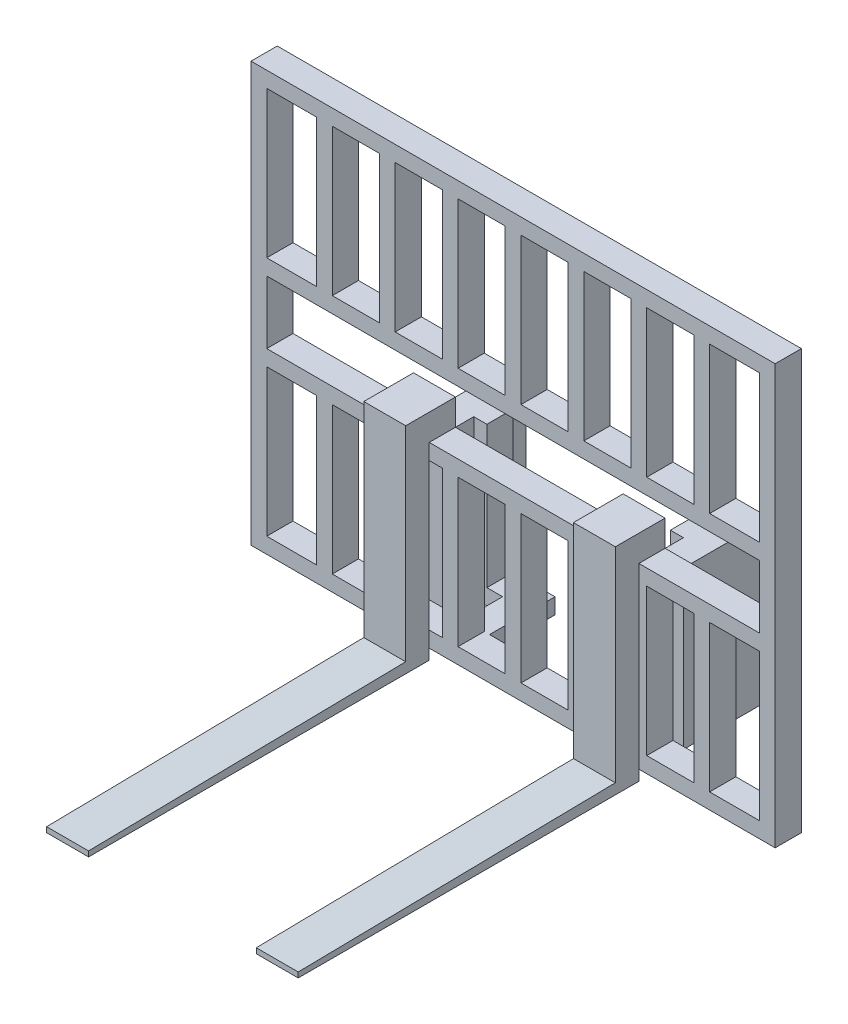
ISO-10303-21;
HEADER;
FILE_DESCRIPTION(('STEP AP214'),'2;1');
FILE_NAME('part.step','',(''),(''),'','','');
FILE_SCHEMA(('AUTOMOTIVE_DESIGN { 1 0 10303 214 1 1 1 1 }'));
ENDSEC;
DATA;
#1=APPLICATION_CONTEXT('core data for automotive mechanical design processes');
#2=APPLICATION_PROTOCOL_DEFINITION('international standard','automotive_design',2000,#1);
#3=PRODUCT_CONTEXT('',#1,'mechanical');
#4=PRODUCT('Part','Part','',(#3));
#5=PRODUCT_RELATED_PRODUCT_CATEGORY('part','',(#4));
#6=PRODUCT_DEFINITION_FORMATION('','',#4);
#7=PRODUCT_DEFINITION_CONTEXT('part definition',#1,'design');
#8=PRODUCT_DEFINITION('design','',#6,#7);
#9=PRODUCT_DEFINITION_SHAPE('','',#8);
#10=(LENGTH_UNIT() NAMED_UNIT(*) SI_UNIT(.MILLI.,.METRE.));
#11=(NAMED_UNIT(*) PLANE_ANGLE_UNIT() SI_UNIT($,.RADIAN.));
#12=(NAMED_UNIT(*) SI_UNIT($,.STERADIAN.) SOLID_ANGLE_UNIT());
#13=UNCERTAINTY_MEASURE_WITH_UNIT(LENGTH_MEASURE(1.E-05),#10,'distance_accuracy_value','');
#14=(GEOMETRIC_REPRESENTATION_CONTEXT(3) GLOBAL_UNCERTAINTY_ASSIGNED_CONTEXT((#13)) GLOBAL_UNIT_ASSIGNED_CONTEXT((#10,
#11,#12)) REPRESENTATION_CONTEXT('',''));
#15=CARTESIAN_POINT('',(0.,0.,0.));
#16=DIRECTION('',(0.,0.,1.));
#17=DIRECTION('',(1.,0.,0.));
#18=AXIS2_PLACEMENT_3D('',#15,#16,#17);
#19=CARTESIAN_POINT('',(0.,0.,0.));
#20=DIRECTION('',(0.,0.,1.));
#21=DIRECTION('',(1.,0.,0.));
#22=AXIS2_PLACEMENT_3D('',#19,#20,#21);
#23=PLANE('',#22);
#24=DIRECTION('',(1.,0.,0.));
#25=VECTOR('',#24,1.);
#26=CARTESIAN_POINT('',(0.,720.,0.));
#27=LINE('',#26,#25);
#28=CARTESIAN_POINT('',(-470.,720.,0.));
#29=VERTEX_POINT('',#28);
#30=CARTESIAN_POINT('',(-375.,720.,0.));
#31=VERTEX_POINT('',#30);
#32=EDGE_CURVE('E1298',#29,#31,#27,.T.);
#33=ORIENTED_EDGE('',*,*,#32,.F.);
#34=DIRECTION('',(0.,-1.,0.));
#35=VECTOR('',#34,1.);
#36=CARTESIAN_POINT('',(-470.,3.72717729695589E-13,0.));
#37=LINE('',#36,#35);
#38=CARTESIAN_POINT('',(-470.,440.,0.));
#39=VERTEX_POINT('',#38);
#40=EDGE_CURVE('E1060',#29,#39,#37,.T.);
#41=ORIENTED_EDGE('',*,*,#40,.T.);
#42=DIRECTION('',(-1.,0.,0.));
#43=VECTOR('',#42,1.);
#44=CARTESIAN_POINT('',(-7.71312838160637E-13,440.000000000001,0.));
#45=LINE('',#44,#43);
#46=CARTESIAN_POINT('',(-375.,440.,0.));
#47=VERTEX_POINT('',#46);
#48=EDGE_CURVE('E1389',#47,#39,#45,.T.);
#49=ORIENTED_EDGE('',*,*,#48,.F.);
#50=DIRECTION('',(0.,-1.,0.));
#51=VECTOR('',#50,1.);
#52=CARTESIAN_POINT('',(-375.,1.48690583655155E-13,0.));
#53=LINE('',#52,#51);
#54=EDGE_CURVE('E1387',#31,#47,#53,.T.);
#55=ORIENTED_EDGE('',*,*,#54,.F.);
#56=EDGE_LOOP('',(#33,#41,#49,#55));
#57=FACE_BOUND('',#56,.T.);
#58=DIRECTION('',(0.,-1.,0.));
#59=VECTOR('',#58,1.);
#60=CARTESIAN_POINT('',(470.,0.,0.));
#61=LINE('',#60,#59);
#62=CARTESIAN_POINT('',(470.,410.,0.));
#63=VERTEX_POINT('',#62);
#64=CARTESIAN_POINT('',(470.,290.,0.));
#65=VERTEX_POINT('',#64);
#66=EDGE_CURVE('E1287',#63,#65,#61,.T.);
#67=ORIENTED_EDGE('',*,*,#66,.F.);
#68=DIRECTION('',(-1.,0.,0.));
#69=VECTOR('',#68,1.);
#70=CARTESIAN_POINT('',(0.,410.,0.));
#71=LINE('',#70,#69);
#72=CARTESIAN_POINT('',(-470.,410.,0.));
#73=VERTEX_POINT('',#72);
#74=EDGE_CURVE('E1371',#63,#73,#71,.T.);
#75=ORIENTED_EDGE('',*,*,#74,.T.);
#76=DIRECTION('',(0.,-1.,0.));
#77=VECTOR('',#76,1.);
#78=CARTESIAN_POINT('',(-470.,0.,0.));
#79=LINE('',#78,#77);
#80=CARTESIAN_POINT('',(-470.,290.,0.));
#81=VERTEX_POINT('',#80);
#82=EDGE_CURVE('E1366',#73,#81,#79,.T.);
#83=ORIENTED_EDGE('',*,*,#82,.T.);
#84=DIRECTION('',(-1.,0.,0.));
#85=VECTOR('',#84,1.);
#86=CARTESIAN_POINT('',(0.,290.,0.));
#87=LINE('',#86,#85);
#88=CARTESIAN_POINT('',(-240.,290.,0.));
#89=VERTEX_POINT('',#88);
#90=EDGE_CURVE('E1368',#89,#81,#87,.T.);
#91=ORIENTED_EDGE('',*,*,#90,.F.);
#92=DIRECTION('',(0.,1.,0.));
#93=VECTOR('',#92,1.);
#94=CARTESIAN_POINT('',(-240.,0.,0.));
#95=LINE('',#94,#93);
#96=CARTESIAN_POINT('',(-240.,340.,0.));
#97=VERTEX_POINT('',#96);
#98=EDGE_CURVE('E999',#89,#97,#95,.T.);
#99=ORIENTED_EDGE('',*,*,#98,.T.);
#100=DIRECTION('',(-1.,0.,0.));
#101=VECTOR('',#100,1.);
#102=CARTESIAN_POINT('',(-160.,340.,0.));
#103=LINE('',#102,#101);
#104=CARTESIAN_POINT('',(-160.,340.,0.));
#105=VERTEX_POINT('',#104);
#106=EDGE_CURVE('E1018',#105,#97,#103,.T.);
#107=ORIENTED_EDGE('',*,*,#106,.F.);
#108=DIRECTION('',(0.,1.,0.));
#109=VECTOR('',#108,1.);
#110=CARTESIAN_POINT('',(-160.,0.,0.));
#111=LINE('',#110,#109);
#112=CARTESIAN_POINT('',(-160.,290.,0.));
#113=VERTEX_POINT('',#112);
#114=EDGE_CURVE('E1016',#113,#105,#111,.T.);
#115=ORIENTED_EDGE('',*,*,#114,.F.);
#116=CARTESIAN_POINT('',(160.,290.,0.));
#117=VERTEX_POINT('',#116);
#118=EDGE_CURVE('E1367',#117,#113,#87,.T.);
#119=ORIENTED_EDGE('',*,*,#118,.F.);
#120=DIRECTION('',(0.,1.,0.));
#121=VECTOR('',#120,1.);
#122=CARTESIAN_POINT('',(160.,0.,0.));
#123=LINE('',#122,#121);
#124=CARTESIAN_POINT('',(160.,340.,0.));
#125=VERTEX_POINT('',#124);
#126=EDGE_CURVE('E938',#117,#125,#123,.T.);
#127=ORIENTED_EDGE('',*,*,#126,.T.);
#128=DIRECTION('',(1.,0.,0.));
#129=VECTOR('',#128,1.);
#130=CARTESIAN_POINT('',(160.,340.,0.));
#131=LINE('',#130,#129);
#132=CARTESIAN_POINT('',(240.,340.,0.));
#133=VERTEX_POINT('',#132);
#134=EDGE_CURVE('E992',#125,#133,#131,.T.);
#135=ORIENTED_EDGE('',*,*,#134,.T.);
#136=DIRECTION('',(0.,1.,0.));
#137=VECTOR('',#136,1.);
#138=CARTESIAN_POINT('',(240.,0.,0.));
#139=LINE('',#138,#137);
#140=CARTESIAN_POINT('',(240.,290.,0.));
#141=VERTEX_POINT('',#140);
#142=EDGE_CURVE('E963',#141,#133,#139,.T.);
#143=ORIENTED_EDGE('',*,*,#142,.F.);
#144=EDGE_CURVE('E1364',#65,#141,#87,.T.);
#145=ORIENTED_EDGE('',*,*,#144,.F.);
#146=EDGE_LOOP('',(#67,#75,#83,#91,#99,#107,#115,#119,#127,#135,#143,#145));
#147=FACE_BOUND('',#146,.T.);
#148=DIRECTION('',(0.,-1.,0.));
#149=VECTOR('',#148,1.);
#150=CARTESIAN_POINT('',(375.,0.,0.));
#151=LINE('',#150,#149);
#152=CARTESIAN_POINT('',(375.,720.,0.));
#153=VERTEX_POINT('',#152);
#154=CARTESIAN_POINT('',(375.,440.,0.));
#155=VERTEX_POINT('',#154);
#156=EDGE_CURVE('E1354',#153,#155,#151,.T.);
#157=ORIENTED_EDGE('',*,*,#156,.T.);
#158=DIRECTION('',(-1.,0.,0.));
#159=VECTOR('',#158,1.);
#160=CARTESIAN_POINT('',(-2.57104279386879E-13,440.,0.));
#161=LINE('',#160,#159);
#162=CARTESIAN_POINT('',(470.,440.,0.));
#163=VERTEX_POINT('',#162);
#164=EDGE_CURVE('E1361',#163,#155,#161,.T.);
#165=ORIENTED_EDGE('',*,*,#164,.F.);
#166=DIRECTION('',(0.,-1.,0.));
#167=VECTOR('',#166,1.);
#168=CARTESIAN_POINT('',(469.999999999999,-4.65897162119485E-13,0.));
#169=LINE('',#168,#167);
#170=CARTESIAN_POINT('',(470.,720.,0.));
#171=VERTEX_POINT('',#170);
#172=EDGE_CURVE('E1358',#171,#163,#169,.T.);
#173=ORIENTED_EDGE('',*,*,#172,.F.);
#174=EDGE_CURVE('E1357',#153,#171,#27,.T.);
#175=ORIENTED_EDGE('',*,*,#174,.F.);
#176=EDGE_LOOP('',(#157,#165,#173,#175));
#177=FACE_BOUND('',#176,.T.);
#178=DIRECTION('',(0.,-1.,0.));
#179=VECTOR('',#178,1.);
#180=CARTESIAN_POINT('',(-345.,1.36795336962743E-13,0.));
#181=LINE('',#180,#179);
#182=CARTESIAN_POINT('',(-345.,720.,0.));
#183=VERTEX_POINT('',#182);
#184=CARTESIAN_POINT('',(-345.,440.,0.));
#185=VERTEX_POINT('',#184);
#186=EDGE_CURVE('E1344',#183,#185,#181,.T.);
#187=ORIENTED_EDGE('',*,*,#186,.T.);
#188=DIRECTION('',(-1.,0.,0.));
#189=VECTOR('',#188,1.);
#190=CARTESIAN_POINT('',(0.,440.,0.));
#191=LINE('',#190,#189);
#192=CARTESIAN_POINT('',(-255.,440.,0.));
#193=VERTEX_POINT('',#192);
#194=EDGE_CURVE('E1351',#193,#185,#191,.T.);
#195=ORIENTED_EDGE('',*,*,#194,.F.);
#196=DIRECTION('',(0.,-1.,0.));
#197=VECTOR('',#196,1.);
#198=CARTESIAN_POINT('',(-255.,1.01109596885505E-13,0.));
#199=LINE('',#198,#197);
#200=CARTESIAN_POINT('',(-255.,720.,0.));
#201=VERTEX_POINT('',#200);
#202=EDGE_CURVE('E1348',#201,#193,#199,.T.);
#203=ORIENTED_EDGE('',*,*,#202,.F.);
#204=EDGE_CURVE('E1347',#183,#201,#27,.T.);
#205=ORIENTED_EDGE('',*,*,#204,.F.);
#206=EDGE_LOOP('',(#187,#195,#203,#205));
#207=FACE_BOUND('',#206,.T.);
#208=DIRECTION('',(0.,-1.,0.));
#209=VECTOR('',#208,1.);
#210=CARTESIAN_POINT('',(-225.,0.,0.));
#211=LINE('',#210,#209);
#212=CARTESIAN_POINT('',(-225.,720.,0.));
#213=VERTEX_POINT('',#212);
#214=CARTESIAN_POINT('',(-225.,440.,0.));
#215=VERTEX_POINT('',#214);
#216=EDGE_CURVE('E1334',#213,#215,#211,.T.);
#217=ORIENTED_EDGE('',*,*,#216,.T.);
#218=DIRECTION('',(-1.,0.,0.));
#219=VECTOR('',#218,1.);
#220=CARTESIAN_POINT('',(5.42775700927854E-13,440.,0.));
#221=LINE('',#220,#219);
#222=CARTESIAN_POINT('',(-135.,440.,0.));
#223=VERTEX_POINT('',#222);
#224=EDGE_CURVE('E1341',#223,#215,#221,.T.);
#225=ORIENTED_EDGE('',*,*,#224,.F.);
#226=DIRECTION('',(0.,-1.,0.));
#227=VECTOR('',#226,1.);
#228=CARTESIAN_POINT('',(-135.,0.,0.));
#229=LINE('',#228,#227);
#230=CARTESIAN_POINT('',(-135.,720.,0.));
#231=VERTEX_POINT('',#230);
#232=EDGE_CURVE('E1338',#231,#223,#229,.T.);
#233=ORIENTED_EDGE('',*,*,#232,.F.);
#234=EDGE_CURVE('E1337',#213,#231,#27,.T.);
#235=ORIENTED_EDGE('',*,*,#234,.F.);
#236=EDGE_LOOP('',(#217,#225,#233,#235));
#237=FACE_BOUND('',#236,.T.);
#238=DIRECTION('',(0.,-1.,0.));
#239=VECTOR('',#238,1.);
#240=CARTESIAN_POINT('',(-105.,0.,0.));
#241=LINE('',#240,#239);
#242=CARTESIAN_POINT('',(-105.,720.,0.));
#243=VERTEX_POINT('',#242);
#244=CARTESIAN_POINT('',(-105.,440.,0.));
#245=VERTEX_POINT('',#244);
#246=EDGE_CURVE('E1324',#243,#245,#241,.T.);
#247=ORIENTED_EDGE('',*,*,#246,.T.);
#248=DIRECTION('',(-1.,0.,0.));
#249=VECTOR('',#248,1.);
#250=CARTESIAN_POINT('',(0.,440.,0.));
#251=LINE('',#250,#249);
#252=CARTESIAN_POINT('',(-15.,440.,0.));
#253=VERTEX_POINT('',#252);
#254=EDGE_CURVE('E1331',#253,#245,#251,.T.);
#255=ORIENTED_EDGE('',*,*,#254,.F.);
#256=DIRECTION('',(0.,-1.,0.));
#257=VECTOR('',#256,1.);
#258=CARTESIAN_POINT('',(-15.,0.,0.));
#259=LINE('',#258,#257);
#260=CARTESIAN_POINT('',(-15.,720.,0.));
#261=VERTEX_POINT('',#260);
#262=EDGE_CURVE('E1328',#261,#253,#259,.T.);
#263=ORIENTED_EDGE('',*,*,#262,.F.);
#264=EDGE_CURVE('E1327',#243,#261,#27,.T.);
#265=ORIENTED_EDGE('',*,*,#264,.F.);
#266=EDGE_LOOP('',(#247,#255,#263,#265));
#267=FACE_BOUND('',#266,.T.);
#268=DIRECTION('',(0.,-1.,0.));
#269=VECTOR('',#268,1.);
#270=CARTESIAN_POINT('',(15.,0.,0.));
#271=LINE('',#270,#269);
#272=CARTESIAN_POINT('',(15.,720.,0.));
#273=VERTEX_POINT('',#272);
#274=CARTESIAN_POINT('',(15.,440.,0.));
#275=VERTEX_POINT('',#274);
#276=EDGE_CURVE('E1314',#273,#275,#271,.T.);
#277=ORIENTED_EDGE('',*,*,#276,.T.);
#278=DIRECTION('',(-1.,0.,0.));
#279=VECTOR('',#278,1.);
#280=CARTESIAN_POINT('',(0.,440.,0.));
#281=LINE('',#280,#279);
#282=CARTESIAN_POINT('',(105.,440.,0.));
#283=VERTEX_POINT('',#282);
#284=EDGE_CURVE('E1321',#283,#275,#281,.T.);
#285=ORIENTED_EDGE('',*,*,#284,.F.);
#286=DIRECTION('',(0.,-1.,0.));
#287=VECTOR('',#286,1.);
#288=CARTESIAN_POINT('',(105.,0.,0.));
#289=LINE('',#288,#287);
#290=CARTESIAN_POINT('',(105.,720.,0.));
#291=VERTEX_POINT('',#290);
#292=EDGE_CURVE('E1318',#291,#283,#289,.T.);
#293=ORIENTED_EDGE('',*,*,#292,.F.);
#294=EDGE_CURVE('E1317',#273,#291,#27,.T.);
#295=ORIENTED_EDGE('',*,*,#294,.F.);
#296=EDGE_LOOP('',(#277,#285,#293,#295));
#297=FACE_BOUND('',#296,.T.);
#298=DIRECTION('',(0.,-1.,0.));
#299=VECTOR('',#298,1.);
#300=CARTESIAN_POINT('',(135.,0.,0.));
#301=LINE('',#300,#299);
#302=CARTESIAN_POINT('',(135.,720.,0.));
#303=VERTEX_POINT('',#302);
#304=CARTESIAN_POINT('',(135.,440.,0.));
#305=VERTEX_POINT('',#304);
#306=EDGE_CURVE('E1305',#303,#305,#301,.T.);
#307=ORIENTED_EDGE('',*,*,#306,.T.);
#308=DIRECTION('',(-1.,0.,0.));
#309=VECTOR('',#308,1.);
#310=CARTESIAN_POINT('',(0.,440.,0.));
#311=LINE('',#310,#309);
#312=CARTESIAN_POINT('',(225.,440.,0.));
#313=VERTEX_POINT('',#312);
#314=EDGE_CURVE('E1311',#313,#305,#311,.T.);
#315=ORIENTED_EDGE('',*,*,#314,.F.);
#316=DIRECTION('',(0.,-1.,0.));
#317=VECTOR('',#316,1.);
#318=CARTESIAN_POINT('',(225.,0.,0.));
#319=LINE('',#318,#317);
#320=CARTESIAN_POINT('',(225.,720.,0.));
#321=VERTEX_POINT('',#320);
#322=EDGE_CURVE('E1308',#321,#313,#319,.T.);
#323=ORIENTED_EDGE('',*,*,#322,.F.);
#324=EDGE_CURVE('E1299',#303,#321,#27,.T.);
#325=ORIENTED_EDGE('',*,*,#324,.F.);
#326=EDGE_LOOP('',(#307,#315,#323,#325));
#327=FACE_BOUND('',#326,.T.);
#328=DIRECTION('',(0.,-1.,0.));
#329=VECTOR('',#328,1.);
#330=CARTESIAN_POINT('',(255.,0.,0.));
#331=LINE('',#330,#329);
#332=CARTESIAN_POINT('',(255.,720.,0.));
#333=VERTEX_POINT('',#332);
#334=CARTESIAN_POINT('',(255.,440.,0.));
#335=VERTEX_POINT('',#334);
#336=EDGE_CURVE('E1291',#333,#335,#331,.T.);
#337=ORIENTED_EDGE('',*,*,#336,.T.);
#338=DIRECTION('',(-1.,0.,0.));
#339=VECTOR('',#338,1.);
#340=CARTESIAN_POINT('',(0.,440.,0.));
#341=LINE('',#340,#339);
#342=CARTESIAN_POINT('',(345.,440.,0.));
#343=VERTEX_POINT('',#342);
#344=EDGE_CURVE('E1302',#343,#335,#341,.T.);
#345=ORIENTED_EDGE('',*,*,#344,.F.);
#346=DIRECTION('',(0.,-1.,0.));
#347=VECTOR('',#346,1.);
#348=CARTESIAN_POINT('',(345.,0.,0.));
#349=LINE('',#348,#347);
#350=CARTESIAN_POINT('',(345.,720.,0.));
#351=VERTEX_POINT('',#350);
#352=EDGE_CURVE('E1297',#351,#343,#349,.T.);
#353=ORIENTED_EDGE('',*,*,#352,.F.);
#354=EDGE_CURVE('E1294',#333,#351,#27,.T.);
#355=ORIENTED_EDGE('',*,*,#354,.F.);
#356=EDGE_LOOP('',(#337,#345,#353,#355));
#357=FACE_BOUND('',#356,.T.);
#358=DIRECTION('',(-1.,0.,0.));
#359=VECTOR('',#358,1.);
#360=CARTESIAN_POINT('',(0.,260.,0.));
#361=LINE('',#360,#359);
#362=CARTESIAN_POINT('',(470.,260.,0.));
#363=VERTEX_POINT('',#362);
#364=CARTESIAN_POINT('',(375.,260.,0.));
#365=VERTEX_POINT('',#364);
#366=EDGE_CURVE('E1226',#363,#365,#361,.T.);
#367=ORIENTED_EDGE('',*,*,#366,.T.);
#368=DIRECTION('',(0.,1.,0.));
#369=VECTOR('',#368,1.);
#370=CARTESIAN_POINT('',(375.,0.,0.));
#371=LINE('',#370,#369);
#372=CARTESIAN_POINT('',(375.,-20.0000000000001,0.));
#373=VERTEX_POINT('',#372);
#374=EDGE_CURVE('E1288',#373,#365,#371,.T.);
#375=ORIENTED_EDGE('',*,*,#374,.F.);
#376=DIRECTION('',(1.,0.,0.));
#377=VECTOR('',#376,1.);
#378=CARTESIAN_POINT('',(0.,-20.0000000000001,0.));
#379=LINE('',#378,#377);
#380=CARTESIAN_POINT('',(470.,-20.0000000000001,0.));
#381=VERTEX_POINT('',#380);
#382=EDGE_CURVE('E1286',#373,#381,#379,.T.);
#383=ORIENTED_EDGE('',*,*,#382,.T.);
#384=EDGE_CURVE('E1283',#363,#381,#61,.T.);
#385=ORIENTED_EDGE('',*,*,#384,.F.);
#386=EDGE_LOOP('',(#367,#375,#383,#385));
#387=FACE_BOUND('',#386,.T.);
#388=CARTESIAN_POINT('',(-375.,260.,0.));
#389=VERTEX_POINT('',#388);
#390=CARTESIAN_POINT('',(-470.,260.,0.));
#391=VERTEX_POINT('',#390);
#392=EDGE_CURVE('E1275',#389,#391,#361,.T.);
#393=ORIENTED_EDGE('',*,*,#392,.T.);
#394=DIRECTION('',(0.,-1.,0.));
#395=VECTOR('',#394,1.);
#396=CARTESIAN_POINT('',(-470.,-3.72717729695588E-13,0.));
#397=LINE('',#396,#395);
#398=CARTESIAN_POINT('',(-470.,-20.0000000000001,0.));
#399=VERTEX_POINT('',#398);
#400=EDGE_CURVE('E1280',#391,#399,#397,.T.);
#401=ORIENTED_EDGE('',*,*,#400,.T.);
#402=CARTESIAN_POINT('',(-375.,-20.0000000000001,0.));
#403=VERTEX_POINT('',#402);
#404=EDGE_CURVE('E1279',#399,#403,#379,.T.);
#405=ORIENTED_EDGE('',*,*,#404,.T.);
#406=DIRECTION('',(0.,1.,0.));
#407=VECTOR('',#406,1.);
#408=CARTESIAN_POINT('',(-375.,-1.48690583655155E-13,0.));
#409=LINE('',#408,#407);
#410=EDGE_CURVE('E1276',#403,#389,#409,.T.);
#411=ORIENTED_EDGE('',*,*,#410,.T.);
#412=EDGE_LOOP('',(#393,#401,#405,#411));
#413=FACE_BOUND('',#412,.T.);
#414=CARTESIAN_POINT('',(-255.,260.,0.));
#415=VERTEX_POINT('',#414);
#416=CARTESIAN_POINT('',(-345.,260.,0.));
#417=VERTEX_POINT('',#416);
#418=EDGE_CURVE('E1267',#415,#417,#361,.T.);
#419=ORIENTED_EDGE('',*,*,#418,.T.);
#420=DIRECTION('',(0.,1.,0.));
#421=VECTOR('',#420,1.);
#422=CARTESIAN_POINT('',(-345.,-1.36795336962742E-13,0.));
#423=LINE('',#422,#421);
#424=CARTESIAN_POINT('',(-345.,-20.0000000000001,0.));
#425=VERTEX_POINT('',#424);
#426=EDGE_CURVE('E1272',#425,#417,#423,.T.);
#427=ORIENTED_EDGE('',*,*,#426,.F.);
#428=CARTESIAN_POINT('',(-255.,-20.0000000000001,0.));
#429=VERTEX_POINT('',#428);
#430=EDGE_CURVE('E1271',#425,#429,#379,.T.);
#431=ORIENTED_EDGE('',*,*,#430,.T.);
#432=DIRECTION('',(0.,1.,0.));
#433=VECTOR('',#432,1.);
#434=CARTESIAN_POINT('',(-255.,-1.01109596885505E-13,0.));
#435=LINE('',#434,#433);
#436=EDGE_CURVE('E1268',#429,#415,#435,.T.);
#437=ORIENTED_EDGE('',*,*,#436,.T.);
#438=EDGE_LOOP('',(#419,#427,#431,#437));
#439=FACE_BOUND('',#438,.T.);
#440=CARTESIAN_POINT('',(345.,260.,0.));
#441=VERTEX_POINT('',#440);
#442=CARTESIAN_POINT('',(255.,260.,0.));
#443=VERTEX_POINT('',#442);
#444=EDGE_CURVE('E1055',#441,#443,#361,.T.);
#445=ORIENTED_EDGE('',*,*,#444,.T.);
#446=DIRECTION('',(0.,1.,0.));
#447=VECTOR('',#446,1.);
#448=CARTESIAN_POINT('',(255.,0.,0.));
#449=LINE('',#448,#447);
#450=CARTESIAN_POINT('',(255.,-20.0000000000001,0.));
#451=VERTEX_POINT('',#450);
#452=EDGE_CURVE('E1233',#451,#443,#449,.T.);
#453=ORIENTED_EDGE('',*,*,#452,.F.);
#454=CARTESIAN_POINT('',(345.,-20.0000000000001,0.));
#455=VERTEX_POINT('',#454);
#456=EDGE_CURVE('E1230',#451,#455,#379,.T.);
#457=ORIENTED_EDGE('',*,*,#456,.T.);
#458=DIRECTION('',(0.,1.,0.));
#459=VECTOR('',#458,1.);
#460=CARTESIAN_POINT('',(345.,0.,0.));
#461=LINE('',#460,#459);
#462=EDGE_CURVE('E1225',#455,#441,#461,.T.);
#463=ORIENTED_EDGE('',*,*,#462,.T.);
#464=EDGE_LOOP('',(#445,#453,#457,#463));
#465=FACE_BOUND('',#464,.T.);
#466=DIRECTION('',(0.,1.,0.));
#467=VECTOR('',#466,1.);
#468=CARTESIAN_POINT('',(135.,0.,0.));
#469=LINE('',#468,#467);
#470=CARTESIAN_POINT('',(135.,-20.0000000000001,0.));
#471=VERTEX_POINT('',#470);
#472=CARTESIAN_POINT('',(135.,260.,0.));
#473=VERTEX_POINT('',#472);
#474=EDGE_CURVE('E1241',#471,#473,#469,.T.);
#475=ORIENTED_EDGE('',*,*,#474,.F.);
#476=DIRECTION('',(-1.,0.,0.));
#477=VECTOR('',#476,1.);
#478=CARTESIAN_POINT('',(0.,-20.0000000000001,0.));
#479=LINE('',#478,#477);
#480=CARTESIAN_POINT('',(105.,-20.0000000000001,0.));
#481=VERTEX_POINT('',#480);
#482=EDGE_CURVE('E822',#471,#481,#479,.T.);
#483=ORIENTED_EDGE('',*,*,#482,.T.);
#484=DIRECTION('',(0.,1.,0.));
#485=VECTOR('',#484,1.);
#486=CARTESIAN_POINT('',(105.,0.,0.));
#487=LINE('',#486,#485);
#488=CARTESIAN_POINT('',(105.,260.,0.));
#489=VERTEX_POINT('',#488);
#490=EDGE_CURVE('E1245',#481,#489,#487,.T.);
#491=ORIENTED_EDGE('',*,*,#490,.T.);
#492=CARTESIAN_POINT('',(15.0000000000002,260.,0.));
#493=VERTEX_POINT('',#492);
#494=EDGE_CURVE('E1244',#489,#493,#361,.T.);
#495=ORIENTED_EDGE('',*,*,#494,.T.);
#496=DIRECTION('',(0.,1.,0.));
#497=VECTOR('',#496,1.);
#498=CARTESIAN_POINT('',(15.0000000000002,0.,0.));
#499=LINE('',#498,#497);
#500=CARTESIAN_POINT('',(15.0000000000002,-20.0000000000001,0.));
#501=VERTEX_POINT('',#500);
#502=EDGE_CURVE('E1248',#501,#493,#499,.T.);
#503=ORIENTED_EDGE('',*,*,#502,.F.);
#504=CARTESIAN_POINT('',(95.,-20.0000000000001,0.));
#505=VERTEX_POINT('',#504);
#506=EDGE_CURVE('E1235',#501,#505,#379,.T.);
#507=ORIENTED_EDGE('',*,*,#506,.T.);
#508=DIRECTION('',(0.,-1.,0.));
#509=VECTOR('',#508,1.);
#510=CARTESIAN_POINT('',(95.,128.408220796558,0.));
#511=LINE('',#510,#509);
#512=CARTESIAN_POINT('',(95.,-50.,0.));
#513=VERTEX_POINT('',#512);
#514=EDGE_CURVE('E833',#505,#513,#511,.T.);
#515=ORIENTED_EDGE('',*,*,#514,.T.);
#516=DIRECTION('',(1.,0.,0.));
#517=VECTOR('',#516,1.);
#518=CARTESIAN_POINT('',(0.,-50.,0.));
#519=LINE('',#518,#517);
#520=CARTESIAN_POINT('',(-95.,-50.,0.));
#521=VERTEX_POINT('',#520);
#522=EDGE_CURVE('E58',#521,#513,#519,.T.);
#523=ORIENTED_EDGE('',*,*,#522,.F.);
#524=DIRECTION('',(0.,-1.,0.));
#525=VECTOR('',#524,1.);
#526=CARTESIAN_POINT('',(-95.,128.408220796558,0.));
#527=LINE('',#526,#525);
#528=CARTESIAN_POINT('',(-95.,-20.0000000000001,0.));
#529=VERTEX_POINT('',#528);
#530=EDGE_CURVE('E923',#529,#521,#527,.T.);
#531=ORIENTED_EDGE('',*,*,#530,.F.);
#532=CARTESIAN_POINT('',(-14.9999999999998,-20.0000000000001,0.));
#533=VERTEX_POINT('',#532);
#534=EDGE_CURVE('E1255',#529,#533,#379,.T.);
#535=ORIENTED_EDGE('',*,*,#534,.T.);
#536=DIRECTION('',(0.,1.,0.));
#537=VECTOR('',#536,1.);
#538=CARTESIAN_POINT('',(-14.9999999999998,0.,0.));
#539=LINE('',#538,#537);
#540=CARTESIAN_POINT('',(-14.9999999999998,260.,0.));
#541=VERTEX_POINT('',#540);
#542=EDGE_CURVE('E1252',#533,#541,#539,.T.);
#543=ORIENTED_EDGE('',*,*,#542,.T.);
#544=CARTESIAN_POINT('',(-105.,260.,0.));
#545=VERTEX_POINT('',#544);
#546=EDGE_CURVE('E1251',#541,#545,#361,.T.);
#547=ORIENTED_EDGE('',*,*,#546,.T.);
#548=DIRECTION('',(0.,1.,0.));
#549=VECTOR('',#548,1.);
#550=CARTESIAN_POINT('',(-105.,0.,0.));
#551=LINE('',#550,#549);
#552=CARTESIAN_POINT('',(-105.,-20.0000000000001,0.));
#553=VERTEX_POINT('',#552);
#554=EDGE_CURVE('E1256',#553,#545,#551,.T.);
#555=ORIENTED_EDGE('',*,*,#554,.F.);
#556=DIRECTION('',(-1.,0.,0.));
#557=VECTOR('',#556,1.);
#558=CARTESIAN_POINT('',(0.,-20.0000000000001,0.));
#559=LINE('',#558,#557);
#560=CARTESIAN_POINT('',(-135.,-20.0000000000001,0.));
#561=VERTEX_POINT('',#560);
#562=EDGE_CURVE('E11',#553,#561,#559,.T.);
#563=ORIENTED_EDGE('',*,*,#562,.T.);
#564=DIRECTION('',(0.,1.,0.));
#565=VECTOR('',#564,1.);
#566=CARTESIAN_POINT('',(-135.,0.,0.));
#567=LINE('',#566,#565);
#568=CARTESIAN_POINT('',(-135.,260.,0.));
#569=VERTEX_POINT('',#568);
#570=EDGE_CURVE('E1260',#561,#569,#567,.T.);
#571=ORIENTED_EDGE('',*,*,#570,.T.);
#572=CARTESIAN_POINT('',(-225.,260.,0.));
#573=VERTEX_POINT('',#572);
#574=EDGE_CURVE('E1259',#569,#573,#361,.T.);
#575=ORIENTED_EDGE('',*,*,#574,.T.);
#576=DIRECTION('',(0.,1.,0.));
#577=VECTOR('',#576,1.);
#578=CARTESIAN_POINT('',(-225.,0.,0.));
#579=LINE('',#578,#577);
#580=CARTESIAN_POINT('',(-225.,-20.0000000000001,0.));
#581=VERTEX_POINT('',#580);
#582=EDGE_CURVE('E1264',#581,#573,#579,.T.);
#583=ORIENTED_EDGE('',*,*,#582,.F.);
#584=CARTESIAN_POINT('',(-145.,-20.0000000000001,0.));
#585=VERTEX_POINT('',#584);
#586=EDGE_CURVE('E1263',#581,#585,#379,.T.);
#587=ORIENTED_EDGE('',*,*,#586,.T.);
#588=DIRECTION('',(0.,-1.,0.));
#589=VECTOR('',#588,1.);
#590=CARTESIAN_POINT('',(-145.,128.408220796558,0.));
#591=LINE('',#590,#589);
#592=CARTESIAN_POINT('',(-145.,-50.0000000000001,0.));
#593=VERTEX_POINT('',#592);
#594=EDGE_CURVE('E915',#585,#593,#591,.T.);
#595=ORIENTED_EDGE('',*,*,#594,.T.);
#596=CARTESIAN_POINT('',(-500.,-50.0000000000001,0.));
#597=VERTEX_POINT('',#596);
#598=EDGE_CURVE('E1384',#597,#593,#519,.T.);
#599=ORIENTED_EDGE('',*,*,#598,.F.);
#600=DIRECTION('',(0.,-1.,0.));
#601=VECTOR('',#600,1.);
#602=CARTESIAN_POINT('',(-500.,0.,0.));
#603=LINE('',#602,#601);
#604=CARTESIAN_POINT('',(-500.,750.,0.));
#605=VERTEX_POINT('',#604);
#606=EDGE_CURVE('E1380',#605,#597,#603,.T.);
#607=ORIENTED_EDGE('',*,*,#606,.F.);
#608=DIRECTION('',(1.,0.,0.));
#609=VECTOR('',#608,1.);
#610=CARTESIAN_POINT('',(-1.66533453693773E-13,750.,0.));
#611=LINE('',#610,#609);
#612=CARTESIAN_POINT('',(500.,750.,0.));
#613=VERTEX_POINT('',#612);
#614=EDGE_CURVE('E1377',#605,#613,#611,.T.);
#615=ORIENTED_EDGE('',*,*,#614,.T.);
#616=DIRECTION('',(0.,-1.,0.));
#617=VECTOR('',#616,1.);
#618=CARTESIAN_POINT('',(500.,0.,0.));
#619=LINE('',#618,#617);
#620=CARTESIAN_POINT('',(500.,-50.,0.));
#621=VERTEX_POINT('',#620);
#622=EDGE_CURVE('E1374',#613,#621,#619,.T.);
#623=ORIENTED_EDGE('',*,*,#622,.T.);
#624=CARTESIAN_POINT('',(145.,-50.,0.));
#625=VERTEX_POINT('',#624);
#626=EDGE_CURVE('E1383',#625,#621,#519,.T.);
#627=ORIENTED_EDGE('',*,*,#626,.F.);
#628=DIRECTION('',(0.,-1.,0.));
#629=VECTOR('',#628,1.);
#630=CARTESIAN_POINT('',(145.,128.408220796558,0.));
#631=LINE('',#630,#629);
#632=CARTESIAN_POINT('',(145.,-20.0000000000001,0.));
#633=VERTEX_POINT('',#632);
#634=EDGE_CURVE('E836',#633,#625,#631,.T.);
#635=ORIENTED_EDGE('',*,*,#634,.F.);
#636=CARTESIAN_POINT('',(225.,-20.0000000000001,0.));
#637=VERTEX_POINT('',#636);
#638=EDGE_CURVE('E1234',#633,#637,#379,.T.);
#639=ORIENTED_EDGE('',*,*,#638,.T.);
#640=DIRECTION('',(0.,1.,0.));
#641=VECTOR('',#640,1.);
#642=CARTESIAN_POINT('',(225.,0.,0.));
#643=LINE('',#642,#641);
#644=CARTESIAN_POINT('',(225.,260.,0.));
#645=VERTEX_POINT('',#644);
#646=EDGE_CURVE('E1238',#637,#645,#643,.T.);
#647=ORIENTED_EDGE('',*,*,#646,.T.);
#648=EDGE_CURVE('E1227',#645,#473,#361,.T.);
#649=ORIENTED_EDGE('',*,*,#648,.T.);
#650=EDGE_LOOP('',(#475,#483,#491,#495,#503,#507,#515,#523,#531,#535,#543,#547,#555,#563,#571,
#575,#583,#587,#595,#599,#607,#615,#623,#627,#635,#639,#647,#649));
#651=FACE_BOUND('',#650,.T.);
#652=ADVANCED_FACE('F35',(#57,#147,#177,#207,#237,#267,#297,#327,#357,#387,#413,#439,#465,#651),
#23,.F.);
#653=CARTESIAN_POINT('',(0.,290.,50.));
#654=DIRECTION('',(0.,-1.,0.));
#655=DIRECTION('',(0.,0.,-1.));
#656=AXIS2_PLACEMENT_3D('',#653,#654,#655);
#657=PLANE('',#656);
#658=DIRECTION('',(0.,0.,1.));
#659=VECTOR('',#658,1.);
#660=CARTESIAN_POINT('',(240.,290.,0.));
#661=LINE('',#660,#659);
#662=CARTESIAN_POINT('',(240.,290.,50.));
#663=VERTEX_POINT('',#662);
#664=EDGE_CURVE('E966',#141,#663,#661,.T.);
#665=ORIENTED_EDGE('',*,*,#664,.T.);
#666=DIRECTION('',(-1.,0.,0.));
#667=VECTOR('',#666,1.);
#668=CARTESIAN_POINT('',(0.,290.,50.));
#669=LINE('',#668,#667);
#670=CARTESIAN_POINT('',(470.,290.,50.));
#671=VERTEX_POINT('',#670);
#672=EDGE_CURVE('E1190',#671,#663,#669,.T.);
#673=ORIENTED_EDGE('',*,*,#672,.F.);
#674=DIRECTION('',(0.,0.,-1.));
#675=VECTOR('',#674,1.);
#676=CARTESIAN_POINT('',(470.,290.,50.));
#677=LINE('',#676,#675);
#678=EDGE_CURVE('E1408',#671,#65,#677,.T.);
#679=ORIENTED_EDGE('',*,*,#678,.T.);
#680=ORIENTED_EDGE('',*,*,#144,.T.);
#681=EDGE_LOOP('',(#665,#673,#679,#680));
#682=FACE_BOUND('',#681,.T.);
#683=ADVANCED_FACE('F1595',(#682),#657,.F.);
#684=CARTESIAN_POINT('',(0.,0.,50.));
#685=DIRECTION('',(0.,0.,1.));
#686=DIRECTION('',(1.,0.,0.));
#687=AXIS2_PLACEMENT_3D('',#684,#685,#686);
#688=PLANE('',#687);
#689=DIRECTION('',(1.,0.,0.));
#690=VECTOR('',#689,1.);
#691=CARTESIAN_POINT('',(0.,720.,50.));
#692=LINE('',#691,#690);
#693=CARTESIAN_POINT('',(-470.,720.,50.));
#694=VERTEX_POINT('',#693);
#695=CARTESIAN_POINT('',(-375.,720.,50.));
#696=VERTEX_POINT('',#695);
#697=EDGE_CURVE('E1131',#694,#696,#692,.T.);
#698=ORIENTED_EDGE('',*,*,#697,.T.);
#699=DIRECTION('',(0.,-1.,0.));
#700=VECTOR('',#699,1.);
#701=CARTESIAN_POINT('',(-375.,1.48690583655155E-13,50.));
#702=LINE('',#701,#700);
#703=CARTESIAN_POINT('',(-375.,440.,50.));
#704=VERTEX_POINT('',#703);
#705=EDGE_CURVE('E1215',#696,#704,#702,.T.);
#706=ORIENTED_EDGE('',*,*,#705,.T.);
#707=DIRECTION('',(-1.,0.,0.));
#708=VECTOR('',#707,1.);
#709=CARTESIAN_POINT('',(-7.71312838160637E-13,440.000000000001,50.));
#710=LINE('',#709,#708);
#711=CARTESIAN_POINT('',(-470.,440.,50.));
#712=VERTEX_POINT('',#711);
#713=EDGE_CURVE('E1217',#704,#712,#710,.T.);
#714=ORIENTED_EDGE('',*,*,#713,.T.);
#715=DIRECTION('',(0.,-1.,0.));
#716=VECTOR('',#715,1.);
#717=CARTESIAN_POINT('',(-470.,3.72717729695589E-13,50.));
#718=LINE('',#717,#716);
#719=EDGE_CURVE('E1219',#694,#712,#718,.T.);
#720=ORIENTED_EDGE('',*,*,#719,.F.);
#721=EDGE_LOOP('',(#698,#706,#714,#720));
#722=FACE_BOUND('',#721,.T.);
#723=DIRECTION('',(0.,-1.,0.));
#724=VECTOR('',#723,1.);
#725=CARTESIAN_POINT('',(375.,0.,50.));
#726=LINE('',#725,#724);
#727=CARTESIAN_POINT('',(375.,720.,50.));
#728=VERTEX_POINT('',#727);
#729=CARTESIAN_POINT('',(375.,440.,50.));
#730=VERTEX_POINT('',#729);
#731=EDGE_CURVE('E1181',#728,#730,#726,.T.);
#732=ORIENTED_EDGE('',*,*,#731,.F.);
#733=CARTESIAN_POINT('',(470.,720.,50.));
#734=VERTEX_POINT('',#733);
#735=EDGE_CURVE('E1184',#728,#734,#692,.T.);
#736=ORIENTED_EDGE('',*,*,#735,.T.);
#737=DIRECTION('',(0.,-1.,0.));
#738=VECTOR('',#737,1.);
#739=CARTESIAN_POINT('',(469.999999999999,-4.65897162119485E-13,50.));
#740=LINE('',#739,#738);
#741=CARTESIAN_POINT('',(470.,440.,50.));
#742=VERTEX_POINT('',#741);
#743=EDGE_CURVE('E1185',#734,#742,#740,.T.);
#744=ORIENTED_EDGE('',*,*,#743,.T.);
#745=DIRECTION('',(-1.,0.,0.));
#746=VECTOR('',#745,1.);
#747=CARTESIAN_POINT('',(-2.57104279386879E-13,440.,50.));
#748=LINE('',#747,#746);
#749=EDGE_CURVE('E1188',#742,#730,#748,.T.);
#750=ORIENTED_EDGE('',*,*,#749,.T.);
#751=EDGE_LOOP('',(#732,#736,#744,#750));
#752=FACE_BOUND('',#751,.T.);
#753=DIRECTION('',(0.,-1.,0.));
#754=VECTOR('',#753,1.);
#755=CARTESIAN_POINT('',(-345.,1.36795336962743E-13,50.));
#756=LINE('',#755,#754);
#757=CARTESIAN_POINT('',(-345.,720.,50.));
#758=VERTEX_POINT('',#757);
#759=CARTESIAN_POINT('',(-345.,440.,50.));
#760=VERTEX_POINT('',#759);
#761=EDGE_CURVE('E1172',#758,#760,#756,.T.);
#762=ORIENTED_EDGE('',*,*,#761,.F.);
#763=CARTESIAN_POINT('',(-255.,720.,50.));
#764=VERTEX_POINT('',#763);
#765=EDGE_CURVE('E1175',#758,#764,#692,.T.);
#766=ORIENTED_EDGE('',*,*,#765,.T.);
#767=DIRECTION('',(0.,-1.,0.));
#768=VECTOR('',#767,1.);
#769=CARTESIAN_POINT('',(-255.,1.01109596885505E-13,50.));
#770=LINE('',#769,#768);
#771=CARTESIAN_POINT('',(-255.,440.,50.));
#772=VERTEX_POINT('',#771);
#773=EDGE_CURVE('E1176',#764,#772,#770,.T.);
#774=ORIENTED_EDGE('',*,*,#773,.T.);
#775=DIRECTION('',(-1.,0.,0.));
#776=VECTOR('',#775,1.);
#777=CARTESIAN_POINT('',(0.,440.,50.));
#778=LINE('',#777,#776);
#779=EDGE_CURVE('E1179',#772,#760,#778,.T.);
#780=ORIENTED_EDGE('',*,*,#779,.T.);
#781=EDGE_LOOP('',(#762,#766,#774,#780));
#782=FACE_BOUND('',#781,.T.);
#783=DIRECTION('',(0.,-1.,0.));
#784=VECTOR('',#783,1.);
#785=CARTESIAN_POINT('',(-225.,0.,50.));
#786=LINE('',#785,#784);
#787=CARTESIAN_POINT('',(-225.,720.,50.));
#788=VERTEX_POINT('',#787);
#789=CARTESIAN_POINT('',(-225.,440.,50.));
#790=VERTEX_POINT('',#789);
#791=EDGE_CURVE('E1163',#788,#790,#786,.T.);
#792=ORIENTED_EDGE('',*,*,#791,.F.);
#793=CARTESIAN_POINT('',(-135.,720.,50.));
#794=VERTEX_POINT('',#793);
#795=EDGE_CURVE('E1166',#788,#794,#692,.T.);
#796=ORIENTED_EDGE('',*,*,#795,.T.);
#797=DIRECTION('',(0.,-1.,0.));
#798=VECTOR('',#797,1.);
#799=CARTESIAN_POINT('',(-135.,0.,50.));
#800=LINE('',#799,#798);
#801=CARTESIAN_POINT('',(-135.,440.,50.));
#802=VERTEX_POINT('',#801);
#803=EDGE_CURVE('E1167',#794,#802,#800,.T.);
#804=ORIENTED_EDGE('',*,*,#803,.T.);
#805=DIRECTION('',(-1.,0.,0.));
#806=VECTOR('',#805,1.);
#807=CARTESIAN_POINT('',(5.42775700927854E-13,440.,50.));
#808=LINE('',#807,#806);
#809=EDGE_CURVE('E1170',#802,#790,#808,.T.);
#810=ORIENTED_EDGE('',*,*,#809,.T.);
#811=EDGE_LOOP('',(#792,#796,#804,#810));
#812=FACE_BOUND('',#811,.T.);
#813=DIRECTION('',(0.,-1.,0.));
#814=VECTOR('',#813,1.);
#815=CARTESIAN_POINT('',(-105.,0.,50.));
#816=LINE('',#815,#814);
#817=CARTESIAN_POINT('',(-105.,720.,50.));
#818=VERTEX_POINT('',#817);
#819=CARTESIAN_POINT('',(-105.,440.,50.));
#820=VERTEX_POINT('',#819);
#821=EDGE_CURVE('E1154',#818,#820,#816,.T.);
#822=ORIENTED_EDGE('',*,*,#821,.F.);
#823=CARTESIAN_POINT('',(-15.,720.,50.));
#824=VERTEX_POINT('',#823);
#825=EDGE_CURVE('E1157',#818,#824,#692,.T.);
#826=ORIENTED_EDGE('',*,*,#825,.T.);
#827=DIRECTION('',(0.,-1.,0.));
#828=VECTOR('',#827,1.);
#829=CARTESIAN_POINT('',(-15.,0.,50.));
#830=LINE('',#829,#828);
#831=CARTESIAN_POINT('',(-15.,440.,50.));
#832=VERTEX_POINT('',#831);
#833=EDGE_CURVE('E1158',#824,#832,#830,.T.);
#834=ORIENTED_EDGE('',*,*,#833,.T.);
#835=DIRECTION('',(-1.,0.,0.));
#836=VECTOR('',#835,1.);
#837=CARTESIAN_POINT('',(0.,440.,50.));
#838=LINE('',#837,#836);
#839=EDGE_CURVE('E1161',#832,#820,#838,.T.);
#840=ORIENTED_EDGE('',*,*,#839,.T.);
#841=EDGE_LOOP('',(#822,#826,#834,#840));
#842=FACE_BOUND('',#841,.T.);
#843=DIRECTION('',(0.,-1.,0.));
#844=VECTOR('',#843,1.);
#845=CARTESIAN_POINT('',(15.,0.,50.));
#846=LINE('',#845,#844);
#847=CARTESIAN_POINT('',(15.,720.,50.));
#848=VERTEX_POINT('',#847);
#849=CARTESIAN_POINT('',(15.,440.,50.));
#850=VERTEX_POINT('',#849);
#851=EDGE_CURVE('E1145',#848,#850,#846,.T.);
#852=ORIENTED_EDGE('',*,*,#851,.F.);
#853=CARTESIAN_POINT('',(105.,720.,50.));
#854=VERTEX_POINT('',#853);
#855=EDGE_CURVE('E1148',#848,#854,#692,.T.);
#856=ORIENTED_EDGE('',*,*,#855,.T.);
#857=DIRECTION('',(0.,-1.,0.));
#858=VECTOR('',#857,1.);
#859=CARTESIAN_POINT('',(105.,0.,50.));
#860=LINE('',#859,#858);
#861=CARTESIAN_POINT('',(105.,440.,50.));
#862=VERTEX_POINT('',#861);
#863=EDGE_CURVE('E1149',#854,#862,#860,.T.);
#864=ORIENTED_EDGE('',*,*,#863,.T.);
#865=DIRECTION('',(-1.,0.,0.));
#866=VECTOR('',#865,1.);
#867=CARTESIAN_POINT('',(0.,440.,50.));
#868=LINE('',#867,#866);
#869=EDGE_CURVE('E1152',#862,#850,#868,.T.);
#870=ORIENTED_EDGE('',*,*,#869,.T.);
#871=EDGE_LOOP('',(#852,#856,#864,#870));
#872=FACE_BOUND('',#871,.T.);
#873=DIRECTION('',(0.,-1.,0.));
#874=VECTOR('',#873,1.);
#875=CARTESIAN_POINT('',(135.,0.,50.));
#876=LINE('',#875,#874);
#877=CARTESIAN_POINT('',(135.,720.,50.));
#878=VERTEX_POINT('',#877);
#879=CARTESIAN_POINT('',(135.,440.,50.));
#880=VERTEX_POINT('',#879);
#881=EDGE_CURVE('E1137',#878,#880,#876,.T.);
#882=ORIENTED_EDGE('',*,*,#881,.F.);
#883=CARTESIAN_POINT('',(225.,720.,50.));
#884=VERTEX_POINT('',#883);
#885=EDGE_CURVE('E1132',#878,#884,#692,.T.);
#886=ORIENTED_EDGE('',*,*,#885,.T.);
#887=DIRECTION('',(0.,-1.,0.));
#888=VECTOR('',#887,1.);
#889=CARTESIAN_POINT('',(225.,0.,50.));
#890=LINE('',#889,#888);
#891=CARTESIAN_POINT('',(225.,440.,50.));
#892=VERTEX_POINT('',#891);
#893=EDGE_CURVE('E1140',#884,#892,#890,.T.);
#894=ORIENTED_EDGE('',*,*,#893,.T.);
#895=DIRECTION('',(-1.,0.,0.));
#896=VECTOR('',#895,1.);
#897=CARTESIAN_POINT('',(0.,440.,50.));
#898=LINE('',#897,#896);
#899=EDGE_CURVE('E1143',#892,#880,#898,.T.);
#900=ORIENTED_EDGE('',*,*,#899,.T.);
#901=EDGE_LOOP('',(#882,#886,#894,#900));
#902=FACE_BOUND('',#901,.T.);
#903=DIRECTION('',(0.,-1.,0.));
#904=VECTOR('',#903,1.);
#905=CARTESIAN_POINT('',(255.,0.,50.));
#906=LINE('',#905,#904);
#907=CARTESIAN_POINT('',(255.,720.,50.));
#908=VERTEX_POINT('',#907);
#909=CARTESIAN_POINT('',(255.,440.,50.));
#910=VERTEX_POINT('',#909);
#911=EDGE_CURVE('E1124',#908,#910,#906,.T.);
#912=ORIENTED_EDGE('',*,*,#911,.F.);
#913=CARTESIAN_POINT('',(345.,720.,50.));
#914=VERTEX_POINT('',#913);
#915=EDGE_CURVE('E1127',#908,#914,#692,.T.);
#916=ORIENTED_EDGE('',*,*,#915,.T.);
#917=DIRECTION('',(0.,-1.,0.));
#918=VECTOR('',#917,1.);
#919=CARTESIAN_POINT('',(345.,0.,50.));
#920=LINE('',#919,#918);
#921=CARTESIAN_POINT('',(345.,440.,50.));
#922=VERTEX_POINT('',#921);
#923=EDGE_CURVE('E1130',#914,#922,#920,.T.);
#924=ORIENTED_EDGE('',*,*,#923,.T.);
#925=DIRECTION('',(-1.,0.,0.));
#926=VECTOR('',#925,1.);
#927=CARTESIAN_POINT('',(0.,440.,50.));
#928=LINE('',#927,#926);
#929=EDGE_CURVE('E1135',#922,#910,#928,.T.);
#930=ORIENTED_EDGE('',*,*,#929,.T.);
#931=EDGE_LOOP('',(#912,#916,#924,#930));
#932=FACE_BOUND('',#931,.T.);
#933=DIRECTION('',(-1.,0.,0.));
#934=VECTOR('',#933,1.);
#935=CARTESIAN_POINT('',(0.,260.,50.));
#936=LINE('',#935,#934);
#937=CARTESIAN_POINT('',(470.,260.,50.));
#938=VERTEX_POINT('',#937);
#939=CARTESIAN_POINT('',(375.,260.,50.));
#940=VERTEX_POINT('',#939);
#941=EDGE_CURVE('E1117',#938,#940,#936,.T.);
#942=ORIENTED_EDGE('',*,*,#941,.F.);
#943=DIRECTION('',(0.,-1.,0.));
#944=VECTOR('',#943,1.);
#945=CARTESIAN_POINT('',(470.,0.,50.));
#946=LINE('',#945,#944);
#947=CARTESIAN_POINT('',(470.,-20.0000000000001,50.));
#948=VERTEX_POINT('',#947);
#949=EDGE_CURVE('E1118',#938,#948,#946,.T.);
#950=ORIENTED_EDGE('',*,*,#949,.T.);
#951=DIRECTION('',(1.,0.,0.));
#952=VECTOR('',#951,1.);
#953=CARTESIAN_POINT('',(0.,-20.0000000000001,50.));
#954=LINE('',#953,#952);
#955=CARTESIAN_POINT('',(375.,-20.0000000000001,50.));
#956=VERTEX_POINT('',#955);
#957=EDGE_CURVE('E1120',#956,#948,#954,.T.);
#958=ORIENTED_EDGE('',*,*,#957,.F.);
#959=DIRECTION('',(0.,1.,0.));
#960=VECTOR('',#959,1.);
#961=CARTESIAN_POINT('',(375.,0.,50.));
#962=LINE('',#961,#960);
#963=EDGE_CURVE('E1122',#956,#940,#962,.T.);
#964=ORIENTED_EDGE('',*,*,#963,.T.);
#965=EDGE_LOOP('',(#942,#950,#958,#964));
#966=FACE_BOUND('',#965,.T.);
#967=CARTESIAN_POINT('',(-375.,260.,50.));
#968=VERTEX_POINT('',#967);
#969=CARTESIAN_POINT('',(-470.,260.,50.));
#970=VERTEX_POINT('',#969);
#971=EDGE_CURVE('E1109',#968,#970,#936,.T.);
#972=ORIENTED_EDGE('',*,*,#971,.F.);
#973=DIRECTION('',(0.,1.,0.));
#974=VECTOR('',#973,1.);
#975=CARTESIAN_POINT('',(-375.,-1.48690583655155E-13,50.));
#976=LINE('',#975,#974);
#977=CARTESIAN_POINT('',(-375.,-20.0000000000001,50.));
#978=VERTEX_POINT('',#977);
#979=EDGE_CURVE('E1110',#978,#968,#976,.T.);
#980=ORIENTED_EDGE('',*,*,#979,.F.);
#981=CARTESIAN_POINT('',(-470.,-20.0000000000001,50.));
#982=VERTEX_POINT('',#981);
#983=EDGE_CURVE('E1113',#982,#978,#954,.T.);
#984=ORIENTED_EDGE('',*,*,#983,.F.);
#985=DIRECTION('',(0.,-1.,0.));
#986=VECTOR('',#985,1.);
#987=CARTESIAN_POINT('',(-470.,-3.72717729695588E-13,50.));
#988=LINE('',#987,#986);
#989=EDGE_CURVE('E1114',#970,#982,#988,.T.);
#990=ORIENTED_EDGE('',*,*,#989,.F.);
#991=EDGE_LOOP('',(#972,#980,#984,#990));
#992=FACE_BOUND('',#991,.T.);
#993=CARTESIAN_POINT('',(-255.,260.,50.));
#994=VERTEX_POINT('',#993);
#995=CARTESIAN_POINT('',(-345.,260.,50.));
#996=VERTEX_POINT('',#995);
#997=EDGE_CURVE('E1101',#994,#996,#936,.T.);
#998=ORIENTED_EDGE('',*,*,#997,.F.);
#999=DIRECTION('',(0.,1.,0.));
#1000=VECTOR('',#999,1.);
#1001=CARTESIAN_POINT('',(-255.,-1.01109596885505E-13,50.));
#1002=LINE('',#1001,#1000);
#1003=CARTESIAN_POINT('',(-255.,-20.0000000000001,50.));
#1004=VERTEX_POINT('',#1003);
#1005=EDGE_CURVE('E1103',#1004,#994,#1002,.T.);
#1006=ORIENTED_EDGE('',*,*,#1005,.F.);
#1007=CARTESIAN_POINT('',(-345.,-20.0000000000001,50.));
#1008=VERTEX_POINT('',#1007);
#1009=EDGE_CURVE('E1106',#1008,#1004,#954,.T.);
#1010=ORIENTED_EDGE('',*,*,#1009,.F.);
#1011=DIRECTION('',(0.,1.,0.));
#1012=VECTOR('',#1011,1.);
#1013=CARTESIAN_POINT('',(-345.,-1.36795336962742E-13,50.));
#1014=LINE('',#1013,#1012);
#1015=EDGE_CURVE('E1107',#1008,#996,#1014,.T.);
#1016=ORIENTED_EDGE('',*,*,#1015,.T.);
#1017=EDGE_LOOP('',(#998,#1006,#1010,#1016));
#1018=FACE_BOUND('',#1017,.T.);
#1019=CARTESIAN_POINT('',(345.,260.,50.));
#1020=VERTEX_POINT('',#1019);
#1021=CARTESIAN_POINT('',(255.,260.,50.));
#1022=VERTEX_POINT('',#1021);
#1023=EDGE_CURVE('E1056',#1020,#1022,#936,.T.);
#1024=ORIENTED_EDGE('',*,*,#1023,.F.);
#1025=DIRECTION('',(0.,1.,0.));
#1026=VECTOR('',#1025,1.);
#1027=CARTESIAN_POINT('',(345.,0.,50.));
#1028=LINE('',#1027,#1026);
#1029=CARTESIAN_POINT('',(345.,-20.0000000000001,50.));
#1030=VERTEX_POINT('',#1029);
#1031=EDGE_CURVE('E1059',#1030,#1020,#1028,.T.);
#1032=ORIENTED_EDGE('',*,*,#1031,.F.);
#1033=CARTESIAN_POINT('',(255.,-20.0000000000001,50.));
#1034=VERTEX_POINT('',#1033);
#1035=EDGE_CURVE('E1065',#1034,#1030,#954,.T.);
#1036=ORIENTED_EDGE('',*,*,#1035,.F.);
#1037=DIRECTION('',(0.,1.,0.));
#1038=VECTOR('',#1037,1.);
#1039=CARTESIAN_POINT('',(255.,0.,50.));
#1040=LINE('',#1039,#1038);
#1041=EDGE_CURVE('E1068',#1034,#1022,#1040,.T.);
#1042=ORIENTED_EDGE('',*,*,#1041,.T.);
#1043=EDGE_LOOP('',(#1024,#1032,#1036,#1042));
#1044=FACE_BOUND('',#1043,.T.);
#1045=ORIENTED_EDGE('',*,*,#672,.T.);
#1046=DIRECTION('',(0.,-1.,0.));
#1047=VECTOR('',#1046,1.);
#1048=CARTESIAN_POINT('',(240.,0.,50.));
#1049=LINE('',#1048,#1047);
#1050=CARTESIAN_POINT('',(240.,-50.,50.));
#1051=VERTEX_POINT('',#1050);
#1052=EDGE_CURVE('E969',#663,#1051,#1049,.T.);
#1053=ORIENTED_EDGE('',*,*,#1052,.T.);
#1054=DIRECTION('',(1.,0.,0.));
#1055=VECTOR('',#1054,1.);
#1056=CARTESIAN_POINT('',(0.,-50.,50.));
#1057=LINE('',#1056,#1055);
#1058=CARTESIAN_POINT('',(500.,-50.,50.));
#1059=VERTEX_POINT('',#1058);
#1060=EDGE_CURVE('E1210',#1051,#1059,#1057,.T.);
#1061=ORIENTED_EDGE('',*,*,#1060,.T.);
#1062=DIRECTION('',(0.,-1.,0.));
#1063=VECTOR('',#1062,1.);
#1064=CARTESIAN_POINT('',(500.,0.,50.));
#1065=LINE('',#1064,#1063);
#1066=CARTESIAN_POINT('',(500.,750.,50.));
#1067=VERTEX_POINT('',#1066);
#1068=EDGE_CURVE('E1201',#1067,#1059,#1065,.T.);
#1069=ORIENTED_EDGE('',*,*,#1068,.F.);
#1070=DIRECTION('',(1.,0.,0.));
#1071=VECTOR('',#1070,1.);
#1072=CARTESIAN_POINT('',(-1.66533453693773E-13,750.,50.));
#1073=LINE('',#1072,#1071);
#1074=CARTESIAN_POINT('',(-500.,750.,50.));
#1075=VERTEX_POINT('',#1074);
#1076=EDGE_CURVE('E1204',#1075,#1067,#1073,.T.);
#1077=ORIENTED_EDGE('',*,*,#1076,.F.);
#1078=DIRECTION('',(0.,-1.,0.));
#1079=VECTOR('',#1078,1.);
#1080=CARTESIAN_POINT('',(-500.,0.,50.));
#1081=LINE('',#1080,#1079);
#1082=CARTESIAN_POINT('',(-500.,-50.0000000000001,50.));
#1083=VERTEX_POINT('',#1082);
#1084=EDGE_CURVE('E1207',#1075,#1083,#1081,.T.);
#1085=ORIENTED_EDGE('',*,*,#1084,.T.);
#1086=CARTESIAN_POINT('',(-240.,-50.0000000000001,50.));
#1087=VERTEX_POINT('',#1086);
#1088=EDGE_CURVE('E1211',#1083,#1087,#1057,.T.);
#1089=ORIENTED_EDGE('',*,*,#1088,.T.);
#1090=DIRECTION('',(0.,-1.,0.));
#1091=VECTOR('',#1090,1.);
#1092=CARTESIAN_POINT('',(-240.,0.,50.));
#1093=LINE('',#1092,#1091);
#1094=CARTESIAN_POINT('',(-240.,290.,50.));
#1095=VERTEX_POINT('',#1094);
#1096=EDGE_CURVE('E1034',#1095,#1087,#1093,.T.);
#1097=ORIENTED_EDGE('',*,*,#1096,.F.);
#1098=CARTESIAN_POINT('',(-470.,290.,50.));
#1099=VERTEX_POINT('',#1098);
#1100=EDGE_CURVE('E1195',#1095,#1099,#669,.T.);
#1101=ORIENTED_EDGE('',*,*,#1100,.T.);
#1102=DIRECTION('',(0.,-1.,0.));
#1103=VECTOR('',#1102,1.);
#1104=CARTESIAN_POINT('',(-470.,0.,50.));
#1105=LINE('',#1104,#1103);
#1106=CARTESIAN_POINT('',(-470.,410.,50.));
#1107=VERTEX_POINT('',#1106);
#1108=EDGE_CURVE('E1193',#1107,#1099,#1105,.T.);
#1109=ORIENTED_EDGE('',*,*,#1108,.F.);
#1110=DIRECTION('',(-1.,0.,0.));
#1111=VECTOR('',#1110,1.);
#1112=CARTESIAN_POINT('',(0.,410.,50.));
#1113=LINE('',#1112,#1111);
#1114=CARTESIAN_POINT('',(470.,410.,50.));
#1115=VERTEX_POINT('',#1114);
#1116=EDGE_CURVE('E1198',#1115,#1107,#1113,.T.);
#1117=ORIENTED_EDGE('',*,*,#1116,.F.);
#1118=EDGE_CURVE('E1121',#1115,#671,#946,.T.);
#1119=ORIENTED_EDGE('',*,*,#1118,.T.);
#1120=EDGE_LOOP('',(#1045,#1053,#1061,#1069,#1077,#1085,#1089,#1097,#1101,#1109,#1117,#1119));
#1121=FACE_BOUND('',#1120,.T.);
#1122=ADVANCED_FACE('F1575',(#722,#752,#782,#812,#842,#872,#902,#932,#966,#992,#1018,#1044,
#1121),#688,.T.);
#1123=DIRECTION('',(0.,0.,1.));
#1124=VECTOR('',#1123,1.);
#1125=CARTESIAN_POINT('',(-240.,290.,0.));
#1126=LINE('',#1125,#1124);
#1127=EDGE_CURVE('E1037',#89,#1095,#1126,.T.);
#1128=ORIENTED_EDGE('',*,*,#1127,.F.);
#1129=ORIENTED_EDGE('',*,*,#90,.T.);
#1130=DIRECTION('',(0.,0.,-1.));
#1131=VECTOR('',#1130,1.);
#1132=CARTESIAN_POINT('',(-470.,290.,50.));
#1133=LINE('',#1132,#1131);
#1134=EDGE_CURVE('E1419',#1099,#81,#1133,.T.);
#1135=ORIENTED_EDGE('',*,*,#1134,.F.);
#1136=ORIENTED_EDGE('',*,*,#1100,.F.);
#1137=EDGE_LOOP('',(#1128,#1129,#1135,#1136));
#1138=FACE_BOUND('',#1137,.T.);
#1139=ADVANCED_FACE('F1605',(#1138),#657,.F.);
#1140=CARTESIAN_POINT('',(0.,720.,50.));
#1141=DIRECTION('',(0.,1.,0.));
#1142=DIRECTION('',(0.,0.,1.));
#1143=AXIS2_PLACEMENT_3D('',#1140,#1141,#1142);
#1144=PLANE('',#1143);
#1145=ORIENTED_EDGE('',*,*,#32,.T.);
#1146=DIRECTION('',(0.,0.,-1.));
#1147=VECTOR('',#1146,1.);
#1148=CARTESIAN_POINT('',(-375.,720.,50.));
#1149=LINE('',#1148,#1147);
#1150=EDGE_CURVE('E43',#696,#31,#1149,.T.);
#1151=ORIENTED_EDGE('',*,*,#1150,.F.);
#1152=ORIENTED_EDGE('',*,*,#697,.F.);
#1153=DIRECTION('',(0.,0.,-1.));
#1154=VECTOR('',#1153,1.);
#1155=CARTESIAN_POINT('',(-470.,720.,50.));
#1156=LINE('',#1155,#1154);
#1157=EDGE_CURVE('E1394',#694,#29,#1156,.T.);
#1158=ORIENTED_EDGE('',*,*,#1157,.T.);
#1159=EDGE_LOOP('',(#1145,#1151,#1152,#1158));
#1160=FACE_BOUND('',#1159,.T.);
#1161=ADVANCED_FACE('F1620',(#1160),#1144,.F.);
#1162=CARTESIAN_POINT('',(-375.,1.48690583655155E-13,50.));
#1163=DIRECTION('',(1.,0.,0.));
#1164=DIRECTION('',(0.,1.,0.));
#1165=AXIS2_PLACEMENT_3D('',#1162,#1163,#1164);
#1166=PLANE('',#1165);
#1167=ORIENTED_EDGE('',*,*,#54,.T.);
#1168=DIRECTION('',(0.,0.,-1.));
#1169=VECTOR('',#1168,1.);
#1170=CARTESIAN_POINT('',(-375.,440.,50.));
#1171=LINE('',#1170,#1169);
#1172=EDGE_CURVE('E1399',#704,#47,#1171,.T.);
#1173=ORIENTED_EDGE('',*,*,#1172,.F.);
#1174=ORIENTED_EDGE('',*,*,#705,.F.);
#1175=ORIENTED_EDGE('',*,*,#1150,.T.);
#1176=EDGE_LOOP('',(#1167,#1173,#1174,#1175));
#1177=FACE_BOUND('',#1176,.T.);
#1178=ADVANCED_FACE('F1616',(#1177),#1166,.F.);
#1179=CARTESIAN_POINT('',(-7.71312838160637E-13,440.000000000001,50.));
#1180=DIRECTION('',(0.,-1.,0.));
#1181=DIRECTION('',(1.,0.,0.));
#1182=AXIS2_PLACEMENT_3D('',#1179,#1180,#1181);
#1183=PLANE('',#1182);
#1184=ORIENTED_EDGE('',*,*,#48,.T.);
#1185=DIRECTION('',(0.,0.,-1.));
#1186=VECTOR('',#1185,1.);
#1187=CARTESIAN_POINT('',(-470.,440.,50.));
#1188=LINE('',#1187,#1186);
#1189=EDGE_CURVE('E1396',#712,#39,#1188,.T.);
#1190=ORIENTED_EDGE('',*,*,#1189,.F.);
#1191=ORIENTED_EDGE('',*,*,#713,.F.);
#1192=ORIENTED_EDGE('',*,*,#1172,.T.);
#1193=EDGE_LOOP('',(#1184,#1190,#1191,#1192));
#1194=FACE_BOUND('',#1193,.T.);
#1195=ADVANCED_FACE('F1612',(#1194),#1183,.F.);
#1196=CARTESIAN_POINT('',(500.,0.,50.));
#1197=DIRECTION('',(1.,0.,0.));
#1198=DIRECTION('',(0.,1.,0.));
#1199=AXIS2_PLACEMENT_3D('',#1196,#1197,#1198);
#1200=PLANE('',#1199);
#1201=ORIENTED_EDGE('',*,*,#622,.F.);
#1202=DIRECTION('',(0.,0.,-1.));
#1203=VECTOR('',#1202,1.);
#1204=CARTESIAN_POINT('',(500.,750.,50.));
#1205=LINE('',#1204,#1203);
#1206=EDGE_CURVE('E1397',#1067,#613,#1205,.T.);
#1207=ORIENTED_EDGE('',*,*,#1206,.F.);
#1208=ORIENTED_EDGE('',*,*,#1068,.T.);
#1209=DIRECTION('',(0.,0.,-1.));
#1210=VECTOR('',#1209,1.);
#1211=CARTESIAN_POINT('',(500.,-50.,50.));
#1212=LINE('',#1211,#1210);
#1213=EDGE_CURVE('E1404',#1059,#621,#1212,.T.);
#1214=ORIENTED_EDGE('',*,*,#1213,.T.);
#1215=EDGE_LOOP('',(#1201,#1207,#1208,#1214));
#1216=FACE_BOUND('',#1215,.T.);
#1217=ADVANCED_FACE('F1615',(#1216),#1200,.T.);
#1218=CARTESIAN_POINT('',(-1.66533453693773E-13,750.,50.));
#1219=DIRECTION('',(0.,1.,0.));
#1220=DIRECTION('',(-1.,0.,0.));
#1221=AXIS2_PLACEMENT_3D('',#1218,#1219,#1220);
#1222=PLANE('',#1221);
#1223=ORIENTED_EDGE('',*,*,#614,.F.);
#1224=DIRECTION('',(0.,0.,-1.));
#1225=VECTOR('',#1224,1.);
#1226=CARTESIAN_POINT('',(-500.,750.,50.));
#1227=LINE('',#1226,#1225);
#1228=EDGE_CURVE('E1411',#1075,#605,#1227,.T.);
#1229=ORIENTED_EDGE('',*,*,#1228,.F.);
#1230=ORIENTED_EDGE('',*,*,#1076,.T.);
#1231=ORIENTED_EDGE('',*,*,#1206,.T.);
#1232=EDGE_LOOP('',(#1223,#1229,#1230,#1231));
#1233=FACE_BOUND('',#1232,.T.);
#1234=ADVANCED_FACE('F1635',(#1233),#1222,.T.);
#1235=CARTESIAN_POINT('',(-500.,0.,50.));
#1236=DIRECTION('',(1.,0.,0.));
#1237=DIRECTION('',(0.,1.,0.));
#1238=AXIS2_PLACEMENT_3D('',#1235,#1236,#1237);
#1239=PLANE('',#1238);
#1240=ORIENTED_EDGE('',*,*,#606,.T.);
#1241=DIRECTION('',(0.,0.,-1.));
#1242=VECTOR('',#1241,1.);
#1243=CARTESIAN_POINT('',(-500.,-50.0000000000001,50.));
#1244=LINE('',#1243,#1242);
#1245=EDGE_CURVE('E1407',#1083,#597,#1244,.T.);
#1246=ORIENTED_EDGE('',*,*,#1245,.F.);
#1247=ORIENTED_EDGE('',*,*,#1084,.F.);
#1248=ORIENTED_EDGE('',*,*,#1228,.T.);
#1249=EDGE_LOOP('',(#1240,#1246,#1247,#1248));
#1250=FACE_BOUND('',#1249,.T.);
#1251=ADVANCED_FACE('F1631',(#1250),#1239,.F.);
#1252=CARTESIAN_POINT('',(470.,0.,50.));
#1253=DIRECTION('',(1.,0.,0.));
#1254=DIRECTION('',(0.,0.,-1.));
#1255=AXIS2_PLACEMENT_3D('',#1252,#1253,#1254);
#1256=PLANE('',#1255);
#1257=ORIENTED_EDGE('',*,*,#66,.T.);
#1258=ORIENTED_EDGE('',*,*,#678,.F.);
#1259=ORIENTED_EDGE('',*,*,#1118,.F.);
#1260=DIRECTION('',(0.,0.,-1.));
#1261=VECTOR('',#1260,1.);
#1262=CARTESIAN_POINT('',(470.,410.,50.));
#1263=LINE('',#1262,#1261);
#1264=EDGE_CURVE('E1414',#1115,#63,#1263,.T.);
#1265=ORIENTED_EDGE('',*,*,#1264,.T.);
#1266=EDGE_LOOP('',(#1257,#1258,#1259,#1265));
#1267=FACE_BOUND('',#1266,.T.);
#1268=ADVANCED_FACE('F1634',(#1267),#1256,.F.);
#1269=CARTESIAN_POINT('',(160.,290.,50.));
#1270=VERTEX_POINT('',#1269);
#1271=CARTESIAN_POINT('',(-160.,290.,50.));
#1272=VERTEX_POINT('',#1271);
#1273=EDGE_CURVE('E1194',#1270,#1272,#669,.T.);
#1274=ORIENTED_EDGE('',*,*,#1273,.F.);
#1275=DIRECTION('',(0.,0.,1.));
#1276=VECTOR('',#1275,1.);
#1277=CARTESIAN_POINT('',(160.,290.,0.));
#1278=LINE('',#1277,#1276);
#1279=EDGE_CURVE('E942',#117,#1270,#1278,.T.);
#1280=ORIENTED_EDGE('',*,*,#1279,.F.);
#1281=ORIENTED_EDGE('',*,*,#118,.T.);
#1282=DIRECTION('',(0.,0.,1.));
#1283=VECTOR('',#1282,1.);
#1284=CARTESIAN_POINT('',(-160.,290.,0.));
#1285=LINE('',#1284,#1283);
#1286=EDGE_CURVE('E1012',#113,#1272,#1285,.T.);
#1287=ORIENTED_EDGE('',*,*,#1286,.T.);
#1288=EDGE_LOOP('',(#1274,#1280,#1281,#1287));
#1289=FACE_BOUND('',#1288,.T.);
#1290=ADVANCED_FACE('F1606',(#1289),#657,.F.);
#1291=CARTESIAN_POINT('',(-470.,0.,50.));
#1292=DIRECTION('',(1.,0.,0.));
#1293=DIRECTION('',(0.,0.,-1.));
#1294=AXIS2_PLACEMENT_3D('',#1291,#1292,#1293);
#1295=PLANE('',#1294);
#1296=ORIENTED_EDGE('',*,*,#82,.F.);
#1297=DIRECTION('',(0.,0.,-1.));
#1298=VECTOR('',#1297,1.);
#1299=CARTESIAN_POINT('',(-470.,410.,50.));
#1300=LINE('',#1299,#1298);
#1301=EDGE_CURVE('E1416',#1107,#73,#1300,.T.);
#1302=ORIENTED_EDGE('',*,*,#1301,.F.);
#1303=ORIENTED_EDGE('',*,*,#1108,.T.);
#1304=ORIENTED_EDGE('',*,*,#1134,.T.);
#1305=EDGE_LOOP('',(#1296,#1302,#1303,#1304));
#1306=FACE_BOUND('',#1305,.T.);
#1307=ADVANCED_FACE('F1647',(#1306),#1295,.T.);
#1308=CARTESIAN_POINT('',(375.,0.,50.));
#1309=DIRECTION('',(1.,0.,0.));
#1310=DIRECTION('',(0.,0.,-1.));
#1311=AXIS2_PLACEMENT_3D('',#1308,#1309,#1310);
#1312=PLANE('',#1311);
#1313=ORIENTED_EDGE('',*,*,#156,.F.);
#1314=DIRECTION('',(0.,0.,-1.));
#1315=VECTOR('',#1314,1.);
#1316=CARTESIAN_POINT('',(375.,720.,50.));
#1317=LINE('',#1316,#1315);
#1318=EDGE_CURVE('E1417',#728,#153,#1317,.T.);
#1319=ORIENTED_EDGE('',*,*,#1318,.F.);
#1320=ORIENTED_EDGE('',*,*,#731,.T.);
#1321=DIRECTION('',(0.,0.,-1.));
#1322=VECTOR('',#1321,1.);
#1323=CARTESIAN_POINT('',(375.,440.,50.));
#1324=LINE('',#1323,#1322);
#1325=EDGE_CURVE('E1424',#730,#155,#1324,.T.);
#1326=ORIENTED_EDGE('',*,*,#1325,.T.);
#1327=EDGE_LOOP('',(#1313,#1319,#1320,#1326));
#1328=FACE_BOUND('',#1327,.T.);
#1329=ADVANCED_FACE('F1649',(#1328),#1312,.T.);
#1330=ORIENTED_EDGE('',*,*,#174,.T.);
#1331=DIRECTION('',(0.,0.,-1.));
#1332=VECTOR('',#1331,1.);
#1333=CARTESIAN_POINT('',(470.,720.,50.));
#1334=LINE('',#1333,#1332);
#1335=EDGE_CURVE('E1430',#734,#171,#1334,.T.);
#1336=ORIENTED_EDGE('',*,*,#1335,.F.);
#1337=ORIENTED_EDGE('',*,*,#735,.F.);
#1338=ORIENTED_EDGE('',*,*,#1318,.T.);
#1339=EDGE_LOOP('',(#1330,#1336,#1337,#1338));
#1340=FACE_BOUND('',#1339,.T.);
#1341=ADVANCED_FACE('F1626',(#1340),#1144,.F.);
#1342=CARTESIAN_POINT('',(469.999999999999,-4.65897162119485E-13,50.));
#1343=DIRECTION('',(1.,0.,0.));
#1344=DIRECTION('',(0.,1.,0.));
#1345=AXIS2_PLACEMENT_3D('',#1342,#1343,#1344);
#1346=PLANE('',#1345);
#1347=ORIENTED_EDGE('',*,*,#172,.T.);
#1348=DIRECTION('',(0.,0.,-1.));
#1349=VECTOR('',#1348,1.);
#1350=CARTESIAN_POINT('',(470.,440.,50.));
#1351=LINE('',#1350,#1349);
#1352=EDGE_CURVE('E1426',#742,#163,#1351,.T.);
#1353=ORIENTED_EDGE('',*,*,#1352,.F.);
#1354=ORIENTED_EDGE('',*,*,#743,.F.);
#1355=ORIENTED_EDGE('',*,*,#1335,.T.);
#1356=EDGE_LOOP('',(#1347,#1353,#1354,#1355));
#1357=FACE_BOUND('',#1356,.T.);
#1358=ADVANCED_FACE('F1662',(#1357),#1346,.F.);
#1359=CARTESIAN_POINT('',(-345.,1.36795336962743E-13,50.));
#1360=DIRECTION('',(1.,0.,0.));
#1361=DIRECTION('',(0.,1.,0.));
#1362=AXIS2_PLACEMENT_3D('',#1359,#1360,#1361);
#1363=PLANE('',#1362);
#1364=ORIENTED_EDGE('',*,*,#186,.F.);
#1365=DIRECTION('',(0.,0.,-1.));
#1366=VECTOR('',#1365,1.);
#1367=CARTESIAN_POINT('',(-345.,720.,50.));
#1368=LINE('',#1367,#1366);
#1369=EDGE_CURVE('E1427',#758,#183,#1368,.T.);
#1370=ORIENTED_EDGE('',*,*,#1369,.F.);
#1371=ORIENTED_EDGE('',*,*,#761,.T.);
#1372=DIRECTION('',(0.,0.,-1.));
#1373=VECTOR('',#1372,1.);
#1374=CARTESIAN_POINT('',(-345.,440.,50.));
#1375=LINE('',#1374,#1373);
#1376=EDGE_CURVE('E1434',#760,#185,#1375,.T.);
#1377=ORIENTED_EDGE('',*,*,#1376,.T.);
#1378=EDGE_LOOP('',(#1364,#1370,#1371,#1377));
#1379=FACE_BOUND('',#1378,.T.);
#1380=ADVANCED_FACE('F1665',(#1379),#1363,.T.);
#1381=ORIENTED_EDGE('',*,*,#204,.T.);
#1382=DIRECTION('',(0.,0.,-1.));
#1383=VECTOR('',#1382,1.);
#1384=CARTESIAN_POINT('',(-255.,720.,50.));
#1385=LINE('',#1384,#1383);
#1386=EDGE_CURVE('E1440',#764,#201,#1385,.T.);
#1387=ORIENTED_EDGE('',*,*,#1386,.F.);
#1388=ORIENTED_EDGE('',*,*,#765,.F.);
#1389=ORIENTED_EDGE('',*,*,#1369,.T.);
#1390=EDGE_LOOP('',(#1381,#1387,#1388,#1389));
#1391=FACE_BOUND('',#1390,.T.);
#1392=ADVANCED_FACE('F1678',(#1391),#1144,.F.);
#1393=CARTESIAN_POINT('',(-255.,1.01109596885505E-13,50.));
#1394=DIRECTION('',(1.,0.,0.));
#1395=DIRECTION('',(0.,1.,0.));
#1396=AXIS2_PLACEMENT_3D('',#1393,#1394,#1395);
#1397=PLANE('',#1396);
#1398=ORIENTED_EDGE('',*,*,#202,.T.);
#1399=DIRECTION('',(0.,0.,-1.));
#1400=VECTOR('',#1399,1.);
#1401=CARTESIAN_POINT('',(-255.,440.,50.));
#1402=LINE('',#1401,#1400);
#1403=EDGE_CURVE('E1436',#772,#193,#1402,.T.);
#1404=ORIENTED_EDGE('',*,*,#1403,.F.);
#1405=ORIENTED_EDGE('',*,*,#773,.F.);
#1406=ORIENTED_EDGE('',*,*,#1386,.T.);
#1407=EDGE_LOOP('',(#1398,#1404,#1405,#1406));
#1408=FACE_BOUND('',#1407,.T.);
#1409=ADVANCED_FACE('F1674',(#1408),#1397,.F.);
#1410=CARTESIAN_POINT('',(-225.,0.,50.));
#1411=DIRECTION('',(1.,0.,0.));
#1412=DIRECTION('',(0.,1.,0.));
#1413=AXIS2_PLACEMENT_3D('',#1410,#1411,#1412);
#1414=PLANE('',#1413);
#1415=ORIENTED_EDGE('',*,*,#216,.F.);
#1416=DIRECTION('',(0.,0.,-1.));
#1417=VECTOR('',#1416,1.);
#1418=CARTESIAN_POINT('',(-225.,720.,50.));
#1419=LINE('',#1418,#1417);
#1420=EDGE_CURVE('E1437',#788,#213,#1419,.T.);
#1421=ORIENTED_EDGE('',*,*,#1420,.F.);
#1422=ORIENTED_EDGE('',*,*,#791,.T.);
#1423=DIRECTION('',(0.,0.,-1.));
#1424=VECTOR('',#1423,1.);
#1425=CARTESIAN_POINT('',(-225.,440.,50.));
#1426=LINE('',#1425,#1424);
#1427=EDGE_CURVE('E1444',#790,#215,#1426,.T.);
#1428=ORIENTED_EDGE('',*,*,#1427,.T.);
#1429=EDGE_LOOP('',(#1415,#1421,#1422,#1428));
#1430=FACE_BOUND('',#1429,.T.);
#1431=ADVANCED_FACE('F1677',(#1430),#1414,.T.);
#1432=ORIENTED_EDGE('',*,*,#234,.T.);
#1433=DIRECTION('',(0.,0.,-1.));
#1434=VECTOR('',#1433,1.);
#1435=CARTESIAN_POINT('',(-135.,720.,50.));
#1436=LINE('',#1435,#1434);
#1437=EDGE_CURVE('E1450',#794,#231,#1436,.T.);
#1438=ORIENTED_EDGE('',*,*,#1437,.F.);
#1439=ORIENTED_EDGE('',*,*,#795,.F.);
#1440=ORIENTED_EDGE('',*,*,#1420,.T.);
#1441=EDGE_LOOP('',(#1432,#1438,#1439,#1440));
#1442=FACE_BOUND('',#1441,.T.);
#1443=ADVANCED_FACE('F1691',(#1442),#1144,.F.);
#1444=CARTESIAN_POINT('',(-135.,0.,50.));
#1445=DIRECTION('',(1.,0.,0.));
#1446=DIRECTION('',(0.,1.,0.));
#1447=AXIS2_PLACEMENT_3D('',#1444,#1445,#1446);
#1448=PLANE('',#1447);
#1449=ORIENTED_EDGE('',*,*,#232,.T.);
#1450=DIRECTION('',(0.,0.,-1.));
#1451=VECTOR('',#1450,1.);
#1452=CARTESIAN_POINT('',(-135.,440.,50.));
#1453=LINE('',#1452,#1451);
#1454=EDGE_CURVE('E1446',#802,#223,#1453,.T.);
#1455=ORIENTED_EDGE('',*,*,#1454,.F.);
#1456=ORIENTED_EDGE('',*,*,#803,.F.);
#1457=ORIENTED_EDGE('',*,*,#1437,.T.);
#1458=EDGE_LOOP('',(#1449,#1455,#1456,#1457));
#1459=FACE_BOUND('',#1458,.T.);
#1460=ADVANCED_FACE('F1687',(#1459),#1448,.F.);
#1461=CARTESIAN_POINT('',(-105.,0.,50.));
#1462=DIRECTION('',(1.,0.,0.));
#1463=DIRECTION('',(0.,1.,0.));
#1464=AXIS2_PLACEMENT_3D('',#1461,#1462,#1463);
#1465=PLANE('',#1464);
#1466=ORIENTED_EDGE('',*,*,#246,.F.);
#1467=DIRECTION('',(0.,0.,-1.));
#1468=VECTOR('',#1467,1.);
#1469=CARTESIAN_POINT('',(-105.,720.,50.));
#1470=LINE('',#1469,#1468);
#1471=EDGE_CURVE('E1447',#818,#243,#1470,.T.);
#1472=ORIENTED_EDGE('',*,*,#1471,.F.);
#1473=ORIENTED_EDGE('',*,*,#821,.T.);
#1474=DIRECTION('',(0.,0.,-1.));
#1475=VECTOR('',#1474,1.);
#1476=CARTESIAN_POINT('',(-105.,440.,50.));
#1477=LINE('',#1476,#1475);
#1478=EDGE_CURVE('E1454',#820,#245,#1477,.T.);
#1479=ORIENTED_EDGE('',*,*,#1478,.T.);
#1480=EDGE_LOOP('',(#1466,#1472,#1473,#1479));
#1481=FACE_BOUND('',#1480,.T.);
#1482=ADVANCED_FACE('F1690',(#1481),#1465,.T.);
#1483=ORIENTED_EDGE('',*,*,#264,.T.);
#1484=DIRECTION('',(0.,0.,-1.));
#1485=VECTOR('',#1484,1.);
#1486=CARTESIAN_POINT('',(-15.,720.,50.));
#1487=LINE('',#1486,#1485);
#1488=EDGE_CURVE('E1460',#824,#261,#1487,.T.);
#1489=ORIENTED_EDGE('',*,*,#1488,.F.);
#1490=ORIENTED_EDGE('',*,*,#825,.F.);
#1491=ORIENTED_EDGE('',*,*,#1471,.T.);
#1492=EDGE_LOOP('',(#1483,#1489,#1490,#1491));
#1493=FACE_BOUND('',#1492,.T.);
#1494=ADVANCED_FACE('F1704',(#1493),#1144,.F.);
#1495=CARTESIAN_POINT('',(-15.,0.,50.));
#1496=DIRECTION('',(1.,0.,0.));
#1497=DIRECTION('',(0.,0.,-1.));
#1498=AXIS2_PLACEMENT_3D('',#1495,#1496,#1497);
#1499=PLANE('',#1498);
#1500=ORIENTED_EDGE('',*,*,#262,.T.);
#1501=DIRECTION('',(0.,0.,-1.));
#1502=VECTOR('',#1501,1.);
#1503=CARTESIAN_POINT('',(-15.,440.,50.));
#1504=LINE('',#1503,#1502);
#1505=EDGE_CURVE('E1456',#832,#253,#1504,.T.);
#1506=ORIENTED_EDGE('',*,*,#1505,.F.);
#1507=ORIENTED_EDGE('',*,*,#833,.F.);
#1508=ORIENTED_EDGE('',*,*,#1488,.T.);
#1509=EDGE_LOOP('',(#1500,#1506,#1507,#1508));
#1510=FACE_BOUND('',#1509,.T.);
#1511=ADVANCED_FACE('F1700',(#1510),#1499,.F.);
#1512=CARTESIAN_POINT('',(15.,0.,50.));
#1513=DIRECTION('',(1.,0.,0.));
#1514=DIRECTION('',(0.,0.,-1.));
#1515=AXIS2_PLACEMENT_3D('',#1512,#1513,#1514);
#1516=PLANE('',#1515);
#1517=ORIENTED_EDGE('',*,*,#276,.F.);
#1518=DIRECTION('',(0.,0.,-1.));
#1519=VECTOR('',#1518,1.);
#1520=CARTESIAN_POINT('',(15.,720.,50.));
#1521=LINE('',#1520,#1519);
#1522=EDGE_CURVE('E1457',#848,#273,#1521,.T.);
#1523=ORIENTED_EDGE('',*,*,#1522,.F.);
#1524=ORIENTED_EDGE('',*,*,#851,.T.);
#1525=DIRECTION('',(0.,0.,-1.));
#1526=VECTOR('',#1525,1.);
#1527=CARTESIAN_POINT('',(15.,440.,50.));
#1528=LINE('',#1527,#1526);
#1529=EDGE_CURVE('E1464',#850,#275,#1528,.T.);
#1530=ORIENTED_EDGE('',*,*,#1529,.T.);
#1531=EDGE_LOOP('',(#1517,#1523,#1524,#1530));
#1532=FACE_BOUND('',#1531,.T.);
#1533=ADVANCED_FACE('F1703',(#1532),#1516,.T.);
#1534=ORIENTED_EDGE('',*,*,#294,.T.);
#1535=DIRECTION('',(0.,0.,-1.));
#1536=VECTOR('',#1535,1.);
#1537=CARTESIAN_POINT('',(105.,720.,50.));
#1538=LINE('',#1537,#1536);
#1539=EDGE_CURVE('E1470',#854,#291,#1538,.T.);
#1540=ORIENTED_EDGE('',*,*,#1539,.F.);
#1541=ORIENTED_EDGE('',*,*,#855,.F.);
#1542=ORIENTED_EDGE('',*,*,#1522,.T.);
#1543=EDGE_LOOP('',(#1534,#1540,#1541,#1542));
#1544=FACE_BOUND('',#1543,.T.);
#1545=ADVANCED_FACE('F1717',(#1544),#1144,.F.);
#1546=CARTESIAN_POINT('',(105.,0.,50.));
#1547=DIRECTION('',(1.,0.,0.));
#1548=DIRECTION('',(0.,0.,-1.));
#1549=AXIS2_PLACEMENT_3D('',#1546,#1547,#1548);
#1550=PLANE('',#1549);
#1551=ORIENTED_EDGE('',*,*,#292,.T.);
#1552=DIRECTION('',(0.,0.,-1.));
#1553=VECTOR('',#1552,1.);
#1554=CARTESIAN_POINT('',(105.,440.,50.));
#1555=LINE('',#1554,#1553);
#1556=EDGE_CURVE('E1466',#862,#283,#1555,.T.);
#1557=ORIENTED_EDGE('',*,*,#1556,.F.);
#1558=ORIENTED_EDGE('',*,*,#863,.F.);
#1559=ORIENTED_EDGE('',*,*,#1539,.T.);
#1560=EDGE_LOOP('',(#1551,#1557,#1558,#1559));
#1561=FACE_BOUND('',#1560,.T.);
#1562=ADVANCED_FACE('F1713',(#1561),#1550,.F.);
#1563=CARTESIAN_POINT('',(135.,0.,50.));
#1564=DIRECTION('',(1.,0.,0.));
#1565=DIRECTION('',(0.,0.,-1.));
#1566=AXIS2_PLACEMENT_3D('',#1563,#1564,#1565);
#1567=PLANE('',#1566);
#1568=ORIENTED_EDGE('',*,*,#306,.F.);
#1569=DIRECTION('',(0.,0.,-1.));
#1570=VECTOR('',#1569,1.);
#1571=CARTESIAN_POINT('',(135.,720.,50.));
#1572=LINE('',#1571,#1570);
#1573=EDGE_CURVE('E1467',#878,#303,#1572,.T.);
#1574=ORIENTED_EDGE('',*,*,#1573,.F.);
#1575=ORIENTED_EDGE('',*,*,#881,.T.);
#1576=DIRECTION('',(0.,0.,-1.));
#1577=VECTOR('',#1576,1.);
#1578=CARTESIAN_POINT('',(135.,440.,50.));
#1579=LINE('',#1578,#1577);
#1580=EDGE_CURVE('E1474',#880,#305,#1579,.T.);
#1581=ORIENTED_EDGE('',*,*,#1580,.T.);
#1582=EDGE_LOOP('',(#1568,#1574,#1575,#1581));
#1583=FACE_BOUND('',#1582,.T.);
#1584=ADVANCED_FACE('F1716',(#1583),#1567,.T.);
#1585=ORIENTED_EDGE('',*,*,#324,.T.);
#1586=DIRECTION('',(0.,0.,-1.));
#1587=VECTOR('',#1586,1.);
#1588=CARTESIAN_POINT('',(225.,720.,50.));
#1589=LINE('',#1588,#1587);
#1590=EDGE_CURVE('E1480',#884,#321,#1589,.T.);
#1591=ORIENTED_EDGE('',*,*,#1590,.F.);
#1592=ORIENTED_EDGE('',*,*,#885,.F.);
#1593=ORIENTED_EDGE('',*,*,#1573,.T.);
#1594=EDGE_LOOP('',(#1585,#1591,#1592,#1593));
#1595=FACE_BOUND('',#1594,.T.);
#1596=ADVANCED_FACE('F1730',(#1595),#1144,.F.);
#1597=CARTESIAN_POINT('',(225.,0.,50.));
#1598=DIRECTION('',(1.,0.,0.));
#1599=DIRECTION('',(0.,0.,-1.));
#1600=AXIS2_PLACEMENT_3D('',#1597,#1598,#1599);
#1601=PLANE('',#1600);
#1602=ORIENTED_EDGE('',*,*,#322,.T.);
#1603=DIRECTION('',(0.,0.,-1.));
#1604=VECTOR('',#1603,1.);
#1605=CARTESIAN_POINT('',(225.,440.,50.));
#1606=LINE('',#1605,#1604);
#1607=EDGE_CURVE('E1476',#892,#313,#1606,.T.);
#1608=ORIENTED_EDGE('',*,*,#1607,.F.);
#1609=ORIENTED_EDGE('',*,*,#893,.F.);
#1610=ORIENTED_EDGE('',*,*,#1590,.T.);
#1611=EDGE_LOOP('',(#1602,#1608,#1609,#1610));
#1612=FACE_BOUND('',#1611,.T.);
#1613=ADVANCED_FACE('F1726',(#1612),#1601,.F.);
#1614=CARTESIAN_POINT('',(255.,0.,50.));
#1615=DIRECTION('',(1.,0.,0.));
#1616=DIRECTION('',(0.,0.,-1.));
#1617=AXIS2_PLACEMENT_3D('',#1614,#1615,#1616);
#1618=PLANE('',#1617);
#1619=ORIENTED_EDGE('',*,*,#336,.F.);
#1620=DIRECTION('',(0.,0.,-1.));
#1621=VECTOR('',#1620,1.);
#1622=CARTESIAN_POINT('',(255.,720.,50.));
#1623=LINE('',#1622,#1621);
#1624=EDGE_CURVE('E1477',#908,#333,#1623,.T.);
#1625=ORIENTED_EDGE('',*,*,#1624,.F.);
#1626=ORIENTED_EDGE('',*,*,#911,.T.);
#1627=DIRECTION('',(0.,0.,-1.));
#1628=VECTOR('',#1627,1.);
#1629=CARTESIAN_POINT('',(255.,440.,50.));
#1630=LINE('',#1629,#1628);
#1631=EDGE_CURVE('E1484',#910,#335,#1630,.T.);
#1632=ORIENTED_EDGE('',*,*,#1631,.T.);
#1633=EDGE_LOOP('',(#1619,#1625,#1626,#1632));
#1634=FACE_BOUND('',#1633,.T.);
#1635=ADVANCED_FACE('F1729',(#1634),#1618,.T.);
#1636=ORIENTED_EDGE('',*,*,#354,.T.);
#1637=DIRECTION('',(0.,0.,-1.));
#1638=VECTOR('',#1637,1.);
#1639=CARTESIAN_POINT('',(345.,720.,50.));
#1640=LINE('',#1639,#1638);
#1641=EDGE_CURVE('E1490',#914,#351,#1640,.T.);
#1642=ORIENTED_EDGE('',*,*,#1641,.F.);
#1643=ORIENTED_EDGE('',*,*,#915,.F.);
#1644=ORIENTED_EDGE('',*,*,#1624,.T.);
#1645=EDGE_LOOP('',(#1636,#1642,#1643,#1644));
#1646=FACE_BOUND('',#1645,.T.);
#1647=ADVANCED_FACE('F1625',(#1646),#1144,.F.);
#1648=CARTESIAN_POINT('',(345.,0.,50.));
#1649=DIRECTION('',(1.,0.,0.));
#1650=DIRECTION('',(0.,0.,-1.));
#1651=AXIS2_PLACEMENT_3D('',#1648,#1649,#1650);
#1652=PLANE('',#1651);
#1653=ORIENTED_EDGE('',*,*,#352,.T.);
#1654=DIRECTION('',(0.,0.,-1.));
#1655=VECTOR('',#1654,1.);
#1656=CARTESIAN_POINT('',(345.,440.,50.));
#1657=LINE('',#1656,#1655);
#1658=EDGE_CURVE('E1486',#922,#343,#1657,.T.);
#1659=ORIENTED_EDGE('',*,*,#1658,.F.);
#1660=ORIENTED_EDGE('',*,*,#923,.F.);
#1661=ORIENTED_EDGE('',*,*,#1641,.T.);
#1662=EDGE_LOOP('',(#1653,#1659,#1660,#1661));
#1663=FACE_BOUND('',#1662,.T.);
#1664=ADVANCED_FACE('F1739',(#1663),#1652,.F.);
#1665=CARTESIAN_POINT('',(0.,260.,50.));
#1666=DIRECTION('',(0.,-1.,0.));
#1667=DIRECTION('',(1.,0.,0.));
#1668=AXIS2_PLACEMENT_3D('',#1665,#1666,#1667);
#1669=PLANE('',#1668);
#1670=ORIENTED_EDGE('',*,*,#366,.F.);
#1671=DIRECTION('',(0.,0.,-1.));
#1672=VECTOR('',#1671,1.);
#1673=CARTESIAN_POINT('',(470.,260.,50.));
#1674=LINE('',#1673,#1672);
#1675=EDGE_CURVE('E1487',#938,#363,#1674,.T.);
#1676=ORIENTED_EDGE('',*,*,#1675,.F.);
#1677=ORIENTED_EDGE('',*,*,#941,.T.);
#1678=DIRECTION('',(0.,0.,-1.));
#1679=VECTOR('',#1678,1.);
#1680=CARTESIAN_POINT('',(375.,260.,50.));
#1681=LINE('',#1680,#1679);
#1682=EDGE_CURVE('E1494',#940,#365,#1681,.T.);
#1683=ORIENTED_EDGE('',*,*,#1682,.T.);
#1684=EDGE_LOOP('',(#1670,#1676,#1677,#1683));
#1685=FACE_BOUND('',#1684,.T.);
#1686=ADVANCED_FACE('F1742',(#1685),#1669,.T.);
#1687=ORIENTED_EDGE('',*,*,#384,.T.);
#1688=DIRECTION('',(0.,0.,-1.));
#1689=VECTOR('',#1688,1.);
#1690=CARTESIAN_POINT('',(470.,-20.0000000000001,50.));
#1691=LINE('',#1690,#1689);
#1692=EDGE_CURVE('E1499',#948,#381,#1691,.T.);
#1693=ORIENTED_EDGE('',*,*,#1692,.F.);
#1694=ORIENTED_EDGE('',*,*,#949,.F.);
#1695=ORIENTED_EDGE('',*,*,#1675,.T.);
#1696=EDGE_LOOP('',(#1687,#1693,#1694,#1695));
#1697=FACE_BOUND('',#1696,.T.);
#1698=ADVANCED_FACE('F1657',(#1697),#1256,.F.);
#1699=CARTESIAN_POINT('',(0.,-20.0000000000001,50.));
#1700=DIRECTION('',(0.,1.,0.));
#1701=DIRECTION('',(-1.,0.,0.));
#1702=AXIS2_PLACEMENT_3D('',#1699,#1700,#1701);
#1703=PLANE('',#1702);
#1704=ORIENTED_EDGE('',*,*,#382,.F.);
#1705=DIRECTION('',(0.,0.,-1.));
#1706=VECTOR('',#1705,1.);
#1707=CARTESIAN_POINT('',(375.,-20.0000000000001,50.));
#1708=LINE('',#1707,#1706);
#1709=EDGE_CURVE('E1496',#956,#373,#1708,.T.);
#1710=ORIENTED_EDGE('',*,*,#1709,.F.);
#1711=ORIENTED_EDGE('',*,*,#957,.T.);
#1712=ORIENTED_EDGE('',*,*,#1692,.T.);
#1713=EDGE_LOOP('',(#1704,#1710,#1711,#1712));
#1714=FACE_BOUND('',#1713,.T.);
#1715=ADVANCED_FACE('F1751',(#1714),#1703,.T.);
#1716=ORIENTED_EDGE('',*,*,#392,.F.);
#1717=DIRECTION('',(0.,0.,-1.));
#1718=VECTOR('',#1717,1.);
#1719=CARTESIAN_POINT('',(-375.,260.,50.));
#1720=LINE('',#1719,#1718);
#1721=EDGE_CURVE('E1497',#968,#389,#1720,.T.);
#1722=ORIENTED_EDGE('',*,*,#1721,.F.);
#1723=ORIENTED_EDGE('',*,*,#971,.T.);
#1724=DIRECTION('',(0.,0.,-1.));
#1725=VECTOR('',#1724,1.);
#1726=CARTESIAN_POINT('',(-470.,260.,50.));
#1727=LINE('',#1726,#1725);
#1728=EDGE_CURVE('E1502',#970,#391,#1727,.T.);
#1729=ORIENTED_EDGE('',*,*,#1728,.T.);
#1730=EDGE_LOOP('',(#1716,#1722,#1723,#1729));
#1731=FACE_BOUND('',#1730,.T.);
#1732=ADVANCED_FACE('F1754',(#1731),#1669,.T.);
#1733=CARTESIAN_POINT('',(-375.,-1.48690583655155E-13,50.));
#1734=DIRECTION('',(-1.,0.,0.));
#1735=DIRECTION('',(0.,-1.,0.));
#1736=AXIS2_PLACEMENT_3D('',#1733,#1734,#1735);
#1737=PLANE('',#1736);
#1738=ORIENTED_EDGE('',*,*,#410,.F.);
#1739=DIRECTION('',(0.,0.,-1.));
#1740=VECTOR('',#1739,1.);
#1741=CARTESIAN_POINT('',(-375.,-20.0000000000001,50.));
#1742=LINE('',#1741,#1740);
#1743=EDGE_CURVE('E1507',#978,#403,#1742,.T.);
#1744=ORIENTED_EDGE('',*,*,#1743,.F.);
#1745=ORIENTED_EDGE('',*,*,#979,.T.);
#1746=ORIENTED_EDGE('',*,*,#1721,.T.);
#1747=EDGE_LOOP('',(#1738,#1744,#1745,#1746));
#1748=FACE_BOUND('',#1747,.T.);
#1749=ADVANCED_FACE('F1764',(#1748),#1737,.T.);
#1750=ORIENTED_EDGE('',*,*,#404,.F.);
#1751=DIRECTION('',(0.,0.,-1.));
#1752=VECTOR('',#1751,1.);
#1753=CARTESIAN_POINT('',(-470.,-20.0000000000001,50.));
#1754=LINE('',#1753,#1752);
#1755=EDGE_CURVE('E1504',#982,#399,#1754,.T.);
#1756=ORIENTED_EDGE('',*,*,#1755,.F.);
#1757=ORIENTED_EDGE('',*,*,#983,.T.);
#1758=ORIENTED_EDGE('',*,*,#1743,.T.);
#1759=EDGE_LOOP('',(#1750,#1756,#1757,#1758));
#1760=FACE_BOUND('',#1759,.T.);
#1761=ADVANCED_FACE('F1756',(#1760),#1703,.T.);
#1762=ORIENTED_EDGE('',*,*,#418,.F.);
#1763=DIRECTION('',(0.,0.,-1.));
#1764=VECTOR('',#1763,1.);
#1765=CARTESIAN_POINT('',(-255.,260.,50.));
#1766=LINE('',#1765,#1764);
#1767=EDGE_CURVE('E1505',#994,#415,#1766,.T.);
#1768=ORIENTED_EDGE('',*,*,#1767,.F.);
#1769=ORIENTED_EDGE('',*,*,#997,.T.);
#1770=DIRECTION('',(0.,0.,-1.));
#1771=VECTOR('',#1770,1.);
#1772=CARTESIAN_POINT('',(-345.,260.,50.));
#1773=LINE('',#1772,#1771);
#1774=EDGE_CURVE('E1510',#996,#417,#1773,.T.);
#1775=ORIENTED_EDGE('',*,*,#1774,.T.);
#1776=EDGE_LOOP('',(#1762,#1768,#1769,#1775));
#1777=FACE_BOUND('',#1776,.T.);
#1778=ADVANCED_FACE('F1776',(#1777),#1669,.T.);
#1779=CARTESIAN_POINT('',(-255.,-1.01109596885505E-13,50.));
#1780=DIRECTION('',(-1.,0.,0.));
#1781=DIRECTION('',(0.,-1.,0.));
#1782=AXIS2_PLACEMENT_3D('',#1779,#1780,#1781);
#1783=PLANE('',#1782);
#1784=ORIENTED_EDGE('',*,*,#436,.F.);
#1785=DIRECTION('',(0.,0.,-1.));
#1786=VECTOR('',#1785,1.);
#1787=CARTESIAN_POINT('',(-255.,-20.0000000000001,50.));
#1788=LINE('',#1787,#1786);
#1789=EDGE_CURVE('E1515',#1004,#429,#1788,.T.);
#1790=ORIENTED_EDGE('',*,*,#1789,.F.);
#1791=ORIENTED_EDGE('',*,*,#1005,.T.);
#1792=ORIENTED_EDGE('',*,*,#1767,.T.);
#1793=EDGE_LOOP('',(#1784,#1790,#1791,#1792));
#1794=FACE_BOUND('',#1793,.T.);
#1795=ADVANCED_FACE('F1772',(#1794),#1783,.T.);
#1796=ORIENTED_EDGE('',*,*,#430,.F.);
#1797=DIRECTION('',(0.,0.,-1.));
#1798=VECTOR('',#1797,1.);
#1799=CARTESIAN_POINT('',(-345.,-20.0000000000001,50.));
#1800=LINE('',#1799,#1798);
#1801=EDGE_CURVE('E1512',#1008,#425,#1800,.T.);
#1802=ORIENTED_EDGE('',*,*,#1801,.F.);
#1803=ORIENTED_EDGE('',*,*,#1009,.T.);
#1804=ORIENTED_EDGE('',*,*,#1789,.T.);
#1805=EDGE_LOOP('',(#1796,#1802,#1803,#1804));
#1806=FACE_BOUND('',#1805,.T.);
#1807=ADVANCED_FACE('F1775',(#1806),#1703,.T.);
#1808=ORIENTED_EDGE('',*,*,#574,.F.);
#1809=DIRECTION('',(0.,0.,-1.));
#1810=VECTOR('',#1809,1.);
#1811=CARTESIAN_POINT('',(-135.,260.,50.));
#1812=LINE('',#1811,#1810);
#1813=CARTESIAN_POINT('',(-135.,260.,50.));
#1814=VERTEX_POINT('',#1813);
#1815=EDGE_CURVE('E1513',#1814,#569,#1812,.T.);
#1816=ORIENTED_EDGE('',*,*,#1815,.F.);
#1817=CARTESIAN_POINT('',(-160.,260.,50.));
#1818=VERTEX_POINT('',#1817);
#1819=EDGE_CURVE('E1097',#1814,#1818,#936,.T.);
#1820=ORIENTED_EDGE('',*,*,#1819,.T.);
#1821=CARTESIAN_POINT('',(-225.,260.,50.));
#1822=VERTEX_POINT('',#1821);
#1823=EDGE_CURVE('E1092',#1818,#1822,#936,.T.);
#1824=ORIENTED_EDGE('',*,*,#1823,.T.);
#1825=DIRECTION('',(0.,0.,-1.));
#1826=VECTOR('',#1825,1.);
#1827=CARTESIAN_POINT('',(-225.,260.,50.));
#1828=LINE('',#1827,#1826);
#1829=EDGE_CURVE('E1518',#1822,#573,#1828,.T.);
#1830=ORIENTED_EDGE('',*,*,#1829,.T.);
#1831=EDGE_LOOP('',(#1808,#1816,#1820,#1824,#1830));
#1832=FACE_BOUND('',#1831,.T.);
#1833=ADVANCED_FACE('F1786',(#1832),#1669,.T.);
#1834=CARTESIAN_POINT('',(-135.,0.,50.));
#1835=DIRECTION('',(-1.,0.,0.));
#1836=DIRECTION('',(0.,-1.,0.));
#1837=AXIS2_PLACEMENT_3D('',#1834,#1835,#1836);
#1838=PLANE('',#1837);
#1839=ORIENTED_EDGE('',*,*,#570,.F.);
#1840=DIRECTION('',(0.,0.,-1.));
#1841=VECTOR('',#1840,1.);
#1842=CARTESIAN_POINT('',(-135.,-20.0000000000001,50.));
#1843=LINE('',#1842,#1841);
#1844=CARTESIAN_POINT('',(-135.,-20.0000000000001,50.));
#1845=VERTEX_POINT('',#1844);
#1846=EDGE_CURVE('E1523',#1845,#561,#1843,.T.);
#1847=ORIENTED_EDGE('',*,*,#1846,.F.);
#1848=DIRECTION('',(0.,1.,0.));
#1849=VECTOR('',#1848,1.);
#1850=CARTESIAN_POINT('',(-135.,0.,50.));
#1851=LINE('',#1850,#1849);
#1852=EDGE_CURVE('E1093',#1845,#1814,#1851,.T.);
#1853=ORIENTED_EDGE('',*,*,#1852,.T.);
#1854=ORIENTED_EDGE('',*,*,#1815,.T.);
#1855=EDGE_LOOP('',(#1839,#1847,#1853,#1854));
#1856=FACE_BOUND('',#1855,.T.);
#1857=ADVANCED_FACE('F1782',(#1856),#1838,.T.);
#1858=ORIENTED_EDGE('',*,*,#586,.F.);
#1859=DIRECTION('',(0.,0.,-1.));
#1860=VECTOR('',#1859,1.);
#1861=CARTESIAN_POINT('',(-225.,-20.0000000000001,50.));
#1862=LINE('',#1861,#1860);
#1863=CARTESIAN_POINT('',(-225.,-20.0000000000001,50.));
#1864=VERTEX_POINT('',#1863);
#1865=EDGE_CURVE('E1520',#1864,#581,#1862,.T.);
#1866=ORIENTED_EDGE('',*,*,#1865,.F.);
#1867=CARTESIAN_POINT('',(-160.,-20.0000000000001,50.));
#1868=VERTEX_POINT('',#1867);
#1869=EDGE_CURVE('E1102',#1864,#1868,#954,.T.);
#1870=ORIENTED_EDGE('',*,*,#1869,.T.);
#1871=EDGE_CURVE('E1096',#1868,#1845,#954,.T.);
#1872=ORIENTED_EDGE('',*,*,#1871,.T.);
#1873=ORIENTED_EDGE('',*,*,#1846,.T.);
#1874=ORIENTED_EDGE('',*,*,#562,.F.);
#1875=DIRECTION('',(0.,0.,-1.));
#1876=VECTOR('',#1875,1.);
#1877=CARTESIAN_POINT('',(-105.,-20.0000000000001,50.));
#1878=LINE('',#1877,#1876);
#1879=CARTESIAN_POINT('',(-105.,-20.0000000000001,50.));
#1880=VERTEX_POINT('',#1879);
#1881=EDGE_CURVE('E1529',#1880,#553,#1878,.T.);
#1882=ORIENTED_EDGE('',*,*,#1881,.F.);
#1883=CARTESIAN_POINT('',(-14.9999999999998,-20.0000000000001,50.));
#1884=VERTEX_POINT('',#1883);
#1885=EDGE_CURVE('E1089',#1880,#1884,#954,.T.);
#1886=ORIENTED_EDGE('',*,*,#1885,.T.);
#1887=DIRECTION('',(0.,0.,-1.));
#1888=VECTOR('',#1887,1.);
#1889=CARTESIAN_POINT('',(-14.9999999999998,-20.0000000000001,50.));
#1890=LINE('',#1889,#1888);
#1891=EDGE_CURVE('E1532',#1884,#533,#1890,.T.);
#1892=ORIENTED_EDGE('',*,*,#1891,.T.);
#1893=ORIENTED_EDGE('',*,*,#534,.F.);
#1894=DIRECTION('',(0.,0.,1.));
#1895=VECTOR('',#1894,1.);
#1896=CARTESIAN_POINT('',(-95.,-20.0000000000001,0.));
#1897=LINE('',#1896,#1895);
#1898=CARTESIAN_POINT('',(-95.,-20.0000000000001,-125.));
#1899=VERTEX_POINT('',#1898);
#1900=EDGE_CURVE('E924',#1899,#529,#1897,.T.);
#1901=ORIENTED_EDGE('',*,*,#1900,.F.);
#1902=DIRECTION('',(1.,0.,0.));
#1903=VECTOR('',#1902,1.);
#1904=CARTESIAN_POINT('',(0.,-20.0000000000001,-125.));
#1905=LINE('',#1904,#1903);
#1906=CARTESIAN_POINT('',(-175.,-20.0000000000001,-125.));
#1907=VERTEX_POINT('',#1906);
#1908=EDGE_CURVE('E921',#1907,#1899,#1905,.T.);
#1909=ORIENTED_EDGE('',*,*,#1908,.F.);
#1910=DIRECTION('',(0.,0.,1.));
#1911=VECTOR('',#1910,1.);
#1912=CARTESIAN_POINT('',(-175.,-20.0000000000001,0.));
#1913=LINE('',#1912,#1911);
#1914=CARTESIAN_POINT('',(-175.,-20.0000000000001,-75.));
#1915=VERTEX_POINT('',#1914);
#1916=EDGE_CURVE('E916',#1907,#1915,#1913,.T.);
#1917=ORIENTED_EDGE('',*,*,#1916,.T.);
#1918=DIRECTION('',(1.,0.,0.));
#1919=VECTOR('',#1918,1.);
#1920=CARTESIAN_POINT('',(0.,-20.0000000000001,-75.));
#1921=LINE('',#1920,#1919);
#1922=CARTESIAN_POINT('',(-145.,-20.0000000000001,-75.));
#1923=VERTEX_POINT('',#1922);
#1924=EDGE_CURVE('E904',#1915,#1923,#1921,.T.);
#1925=ORIENTED_EDGE('',*,*,#1924,.T.);
#1926=DIRECTION('',(0.,0.,1.));
#1927=VECTOR('',#1926,1.);
#1928=CARTESIAN_POINT('',(-145.,-20.0000000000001,0.));
#1929=LINE('',#1928,#1927);
#1930=EDGE_CURVE('E920',#1923,#585,#1929,.T.);
#1931=ORIENTED_EDGE('',*,*,#1930,.T.);
#1932=EDGE_LOOP('',(#1858,#1866,#1870,#1872,#1873,#1874,#1882,#1886,#1892,#1893,#1901,#1909,
#1917,#1925,#1931));
#1933=FACE_BOUND('',#1932,.T.);
#1934=ADVANCED_FACE('F1785',(#1933),#1703,.T.);
#1935=ORIENTED_EDGE('',*,*,#546,.F.);
#1936=DIRECTION('',(0.,0.,-1.));
#1937=VECTOR('',#1936,1.);
#1938=CARTESIAN_POINT('',(-14.9999999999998,260.,50.));
#1939=LINE('',#1938,#1937);
#1940=CARTESIAN_POINT('',(-14.9999999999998,260.,50.));
#1941=VERTEX_POINT('',#1940);
#1942=EDGE_CURVE('E1521',#1941,#541,#1939,.T.);
#1943=ORIENTED_EDGE('',*,*,#1942,.F.);
#1944=CARTESIAN_POINT('',(-105.,260.,50.));
#1945=VERTEX_POINT('',#1944);
#1946=EDGE_CURVE('E1085',#1941,#1945,#936,.T.);
#1947=ORIENTED_EDGE('',*,*,#1946,.T.);
#1948=DIRECTION('',(0.,0.,-1.));
#1949=VECTOR('',#1948,1.);
#1950=CARTESIAN_POINT('',(-105.,260.,50.));
#1951=LINE('',#1950,#1949);
#1952=EDGE_CURVE('E1527',#1945,#545,#1951,.T.);
#1953=ORIENTED_EDGE('',*,*,#1952,.T.);
#1954=EDGE_LOOP('',(#1935,#1943,#1947,#1953));
#1955=FACE_BOUND('',#1954,.T.);
#1956=ADVANCED_FACE('F1795',(#1955),#1669,.T.);
#1957=CARTESIAN_POINT('',(-14.9999999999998,0.,50.));
#1958=DIRECTION('',(-1.,0.,0.));
#1959=DIRECTION('',(0.,0.,1.));
#1960=AXIS2_PLACEMENT_3D('',#1957,#1958,#1959);
#1961=PLANE('',#1960);
#1962=ORIENTED_EDGE('',*,*,#542,.F.);
#1963=ORIENTED_EDGE('',*,*,#1891,.F.);
#1964=DIRECTION('',(0.,1.,0.));
#1965=VECTOR('',#1964,1.);
#1966=CARTESIAN_POINT('',(-14.9999999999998,0.,50.));
#1967=LINE('',#1966,#1965);
#1968=EDGE_CURVE('E1086',#1884,#1941,#1967,.T.);
#1969=ORIENTED_EDGE('',*,*,#1968,.T.);
#1970=ORIENTED_EDGE('',*,*,#1942,.T.);
#1971=EDGE_LOOP('',(#1962,#1963,#1969,#1970));
#1972=FACE_BOUND('',#1971,.T.);
#1973=ADVANCED_FACE('F1791',(#1972),#1961,.T.);
#1974=ORIENTED_EDGE('',*,*,#494,.F.);
#1975=DIRECTION('',(0.,0.,-1.));
#1976=VECTOR('',#1975,1.);
#1977=CARTESIAN_POINT('',(105.,260.,50.));
#1978=LINE('',#1977,#1976);
#1979=CARTESIAN_POINT('',(105.,260.,50.));
#1980=VERTEX_POINT('',#1979);
#1981=EDGE_CURVE('E1530',#1980,#489,#1978,.T.);
#1982=ORIENTED_EDGE('',*,*,#1981,.F.);
#1983=CARTESIAN_POINT('',(15.0000000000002,260.,50.));
#1984=VERTEX_POINT('',#1983);
#1985=EDGE_CURVE('E1078',#1980,#1984,#936,.T.);
#1986=ORIENTED_EDGE('',*,*,#1985,.T.);
#1987=DIRECTION('',(0.,0.,-1.));
#1988=VECTOR('',#1987,1.);
#1989=CARTESIAN_POINT('',(15.0000000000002,260.,50.));
#1990=LINE('',#1989,#1988);
#1991=EDGE_CURVE('E1536',#1984,#493,#1990,.T.);
#1992=ORIENTED_EDGE('',*,*,#1991,.T.);
#1993=EDGE_LOOP('',(#1974,#1982,#1986,#1992));
#1994=FACE_BOUND('',#1993,.T.);
#1995=ADVANCED_FACE('F1794',(#1994),#1669,.T.);
#1996=CARTESIAN_POINT('',(105.,0.,50.));
#1997=DIRECTION('',(-1.,0.,0.));
#1998=DIRECTION('',(0.,0.,1.));
#1999=AXIS2_PLACEMENT_3D('',#1996,#1997,#1998);
#2000=PLANE('',#1999);
#2001=ORIENTED_EDGE('',*,*,#490,.F.);
#2002=DIRECTION('',(0.,0.,-1.));
#2003=VECTOR('',#2002,1.);
#2004=CARTESIAN_POINT('',(105.,-20.0000000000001,50.));
#2005=LINE('',#2004,#2003);
#2006=CARTESIAN_POINT('',(105.,-20.0000000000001,50.));
#2007=VERTEX_POINT('',#2006);
#2008=EDGE_CURVE('E1541',#2007,#481,#2005,.T.);
#2009=ORIENTED_EDGE('',*,*,#2008,.F.);
#2010=DIRECTION('',(0.,1.,0.));
#2011=VECTOR('',#2010,1.);
#2012=CARTESIAN_POINT('',(105.,0.,50.));
#2013=LINE('',#2012,#2011);
#2014=EDGE_CURVE('E1079',#2007,#1980,#2013,.T.);
#2015=ORIENTED_EDGE('',*,*,#2014,.T.);
#2016=ORIENTED_EDGE('',*,*,#1981,.T.);
#2017=EDGE_LOOP('',(#2001,#2009,#2015,#2016));
#2018=FACE_BOUND('',#2017,.T.);
#2019=ADVANCED_FACE('F1800',(#2018),#2000,.T.);
#2020=ORIENTED_EDGE('',*,*,#506,.F.);
#2021=DIRECTION('',(0.,0.,-1.));
#2022=VECTOR('',#2021,1.);
#2023=CARTESIAN_POINT('',(15.0000000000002,-20.0000000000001,50.));
#2024=LINE('',#2023,#2022);
#2025=CARTESIAN_POINT('',(15.0000000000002,-20.0000000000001,50.));
#2026=VERTEX_POINT('',#2025);
#2027=EDGE_CURVE('E1538',#2026,#501,#2024,.T.);
#2028=ORIENTED_EDGE('',*,*,#2027,.F.);
#2029=EDGE_CURVE('E1082',#2026,#2007,#954,.T.);
#2030=ORIENTED_EDGE('',*,*,#2029,.T.);
#2031=ORIENTED_EDGE('',*,*,#2008,.T.);
#2032=ORIENTED_EDGE('',*,*,#482,.F.);
#2033=DIRECTION('',(0.,0.,-1.));
#2034=VECTOR('',#2033,1.);
#2035=CARTESIAN_POINT('',(135.,-20.0000000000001,50.));
#2036=LINE('',#2035,#2034);
#2037=CARTESIAN_POINT('',(135.,-20.0000000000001,50.));
#2038=VERTEX_POINT('',#2037);
#2039=EDGE_CURVE('E1547',#2038,#471,#2036,.T.);
#2040=ORIENTED_EDGE('',*,*,#2039,.F.);
#2041=CARTESIAN_POINT('',(160.,-20.0000000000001,50.));
#2042=VERTEX_POINT('',#2041);
#2043=EDGE_CURVE('E1070',#2038,#2042,#954,.T.);
#2044=ORIENTED_EDGE('',*,*,#2043,.T.);
#2045=CARTESIAN_POINT('',(225.,-20.0000000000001,50.));
#2046=VERTEX_POINT('',#2045);
#2047=EDGE_CURVE('E1069',#2042,#2046,#954,.T.);
#2048=ORIENTED_EDGE('',*,*,#2047,.T.);
#2049=DIRECTION('',(0.,0.,-1.));
#2050=VECTOR('',#2049,1.);
#2051=CARTESIAN_POINT('',(225.,-20.0000000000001,50.));
#2052=LINE('',#2051,#2050);
#2053=EDGE_CURVE('E1551',#2046,#637,#2052,.T.);
#2054=ORIENTED_EDGE('',*,*,#2053,.T.);
#2055=ORIENTED_EDGE('',*,*,#638,.F.);
#2056=DIRECTION('',(0.,0.,1.));
#2057=VECTOR('',#2056,1.);
#2058=CARTESIAN_POINT('',(145.,-20.0000000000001,0.));
#2059=LINE('',#2058,#2057);
#2060=CARTESIAN_POINT('',(145.,-20.0000000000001,-75.));
#2061=VERTEX_POINT('',#2060);
#2062=EDGE_CURVE('E834',#2061,#633,#2059,.T.);
#2063=ORIENTED_EDGE('',*,*,#2062,.F.);
#2064=DIRECTION('',(-1.,0.,0.));
#2065=VECTOR('',#2064,1.);
#2066=CARTESIAN_POINT('',(0.,-20.0000000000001,-75.));
#2067=LINE('',#2066,#2065);
#2068=CARTESIAN_POINT('',(175.,-20.0000000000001,-75.));
#2069=VERTEX_POINT('',#2068);
#2070=EDGE_CURVE('E838',#2069,#2061,#2067,.T.);
#2071=ORIENTED_EDGE('',*,*,#2070,.F.);
#2072=DIRECTION('',(0.,0.,1.));
#2073=VECTOR('',#2072,1.);
#2074=CARTESIAN_POINT('',(175.,-20.0000000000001,0.));
#2075=LINE('',#2074,#2073);
#2076=CARTESIAN_POINT('',(175.,-20.0000000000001,-125.));
#2077=VERTEX_POINT('',#2076);
#2078=EDGE_CURVE('E826',#2077,#2069,#2075,.T.);
#2079=ORIENTED_EDGE('',*,*,#2078,.F.);
#2080=DIRECTION('',(-1.,0.,0.));
#2081=VECTOR('',#2080,1.);
#2082=CARTESIAN_POINT('',(0.,-20.0000000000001,-125.));
#2083=LINE('',#2082,#2081);
#2084=CARTESIAN_POINT('',(95.,-20.0000000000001,-125.));
#2085=VERTEX_POINT('',#2084);
#2086=EDGE_CURVE('E806',#2077,#2085,#2083,.T.);
#2087=ORIENTED_EDGE('',*,*,#2086,.T.);
#2088=DIRECTION('',(0.,0.,1.));
#2089=VECTOR('',#2088,1.);
#2090=CARTESIAN_POINT('',(95.,-20.0000000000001,0.));
#2091=LINE('',#2090,#2089);
#2092=EDGE_CURVE('E831',#2085,#505,#2091,.T.);
#2093=ORIENTED_EDGE('',*,*,#2092,.T.);
#2094=EDGE_LOOP('',(#2020,#2028,#2030,#2031,#2032,#2040,#2044,#2048,#2054,#2055,#2063,#2071,
#2079,#2087,#2093));
#2095=FACE_BOUND('',#2094,.T.);
#2096=ADVANCED_FACE('F1801',(#2095),#1703,.T.);
#2097=ORIENTED_EDGE('',*,*,#648,.F.);
#2098=DIRECTION('',(0.,0.,-1.));
#2099=VECTOR('',#2098,1.);
#2100=CARTESIAN_POINT('',(225.,260.,50.));
#2101=LINE('',#2100,#2099);
#2102=CARTESIAN_POINT('',(225.,260.,50.));
#2103=VERTEX_POINT('',#2102);
#2104=EDGE_CURVE('E1539',#2103,#645,#2101,.T.);
#2105=ORIENTED_EDGE('',*,*,#2104,.F.);
#2106=CARTESIAN_POINT('',(160.,260.,50.));
#2107=VERTEX_POINT('',#2106);
#2108=EDGE_CURVE('E1062',#2103,#2107,#936,.T.);
#2109=ORIENTED_EDGE('',*,*,#2108,.T.);
#2110=CARTESIAN_POINT('',(135.,260.,50.));
#2111=VERTEX_POINT('',#2110);
#2112=EDGE_CURVE('E1061',#2107,#2111,#936,.T.);
#2113=ORIENTED_EDGE('',*,*,#2112,.T.);
#2114=DIRECTION('',(0.,0.,-1.));
#2115=VECTOR('',#2114,1.);
#2116=CARTESIAN_POINT('',(135.,260.,50.));
#2117=LINE('',#2116,#2115);
#2118=EDGE_CURVE('E1545',#2111,#473,#2117,.T.);
#2119=ORIENTED_EDGE('',*,*,#2118,.T.);
#2120=EDGE_LOOP('',(#2097,#2105,#2109,#2113,#2119));
#2121=FACE_BOUND('',#2120,.T.);
#2122=ADVANCED_FACE('F1805',(#2121),#1669,.T.);
#2123=CARTESIAN_POINT('',(225.,0.,50.));
#2124=DIRECTION('',(-1.,0.,0.));
#2125=DIRECTION('',(0.,0.,1.));
#2126=AXIS2_PLACEMENT_3D('',#2123,#2124,#2125);
#2127=PLANE('',#2126);
#2128=ORIENTED_EDGE('',*,*,#646,.F.);
#2129=ORIENTED_EDGE('',*,*,#2053,.F.);
#2130=DIRECTION('',(0.,1.,0.));
#2131=VECTOR('',#2130,1.);
#2132=CARTESIAN_POINT('',(225.,0.,50.));
#2133=LINE('',#2132,#2131);
#2134=EDGE_CURVE('E1072',#2046,#2103,#2133,.T.);
#2135=ORIENTED_EDGE('',*,*,#2134,.T.);
#2136=ORIENTED_EDGE('',*,*,#2104,.T.);
#2137=EDGE_LOOP('',(#2128,#2129,#2135,#2136));
#2138=FACE_BOUND('',#2137,.T.);
#2139=ADVANCED_FACE('F1803',(#2138),#2127,.T.);
#2140=ORIENTED_EDGE('',*,*,#444,.F.);
#2141=DIRECTION('',(0.,0.,-1.));
#2142=VECTOR('',#2141,1.);
#2143=CARTESIAN_POINT('',(345.,260.,50.));
#2144=LINE('',#2143,#2142);
#2145=EDGE_CURVE('E1548',#1020,#441,#2144,.T.);
#2146=ORIENTED_EDGE('',*,*,#2145,.F.);
#2147=ORIENTED_EDGE('',*,*,#1023,.T.);
#2148=DIRECTION('',(0.,0.,-1.));
#2149=VECTOR('',#2148,1.);
#2150=CARTESIAN_POINT('',(255.,260.,50.));
#2151=LINE('',#2150,#2149);
#2152=EDGE_CURVE('E1222',#1022,#443,#2151,.T.);
#2153=ORIENTED_EDGE('',*,*,#2152,.T.);
#2154=EDGE_LOOP('',(#2140,#2146,#2147,#2153));
#2155=FACE_BOUND('',#2154,.T.);
#2156=ADVANCED_FACE('F1565',(#2155),#1669,.T.);
#2157=CARTESIAN_POINT('',(345.,0.,50.));
#2158=DIRECTION('',(-1.,0.,0.));
#2159=DIRECTION('',(0.,0.,1.));
#2160=AXIS2_PLACEMENT_3D('',#2157,#2158,#2159);
#2161=PLANE('',#2160);
#2162=ORIENTED_EDGE('',*,*,#462,.F.);
#2163=DIRECTION('',(0.,0.,-1.));
#2164=VECTOR('',#2163,1.);
#2165=CARTESIAN_POINT('',(345.,-20.0000000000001,50.));
#2166=LINE('',#2165,#2164);
#2167=EDGE_CURVE('E1558',#1030,#455,#2166,.T.);
#2168=ORIENTED_EDGE('',*,*,#2167,.F.);
#2169=ORIENTED_EDGE('',*,*,#1031,.T.);
#2170=ORIENTED_EDGE('',*,*,#2145,.T.);
#2171=EDGE_LOOP('',(#2162,#2168,#2169,#2170));
#2172=FACE_BOUND('',#2171,.T.);
#2173=ADVANCED_FACE('F37',(#2172),#2161,.T.);
#2174=ORIENTED_EDGE('',*,*,#456,.F.);
#2175=DIRECTION('',(0.,0.,-1.));
#2176=VECTOR('',#2175,1.);
#2177=CARTESIAN_POINT('',(255.,-20.0000000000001,50.));
#2178=LINE('',#2177,#2176);
#2179=EDGE_CURVE('E1556',#1034,#451,#2178,.T.);
#2180=ORIENTED_EDGE('',*,*,#2179,.F.);
#2181=ORIENTED_EDGE('',*,*,#1035,.T.);
#2182=ORIENTED_EDGE('',*,*,#2167,.T.);
#2183=EDGE_LOOP('',(#2174,#2180,#2181,#2182));
#2184=FACE_BOUND('',#2183,.T.);
#2185=ADVANCED_FACE('F1571',(#2184),#1703,.T.);
#2186=CARTESIAN_POINT('',(0.,-50.,50.));
#2187=DIRECTION('',(0.,1.,0.));
#2188=DIRECTION('',(-1.,0.,0.));
#2189=AXIS2_PLACEMENT_3D('',#2186,#2187,#2188);
#2190=PLANE('',#2189);
#2191=ORIENTED_EDGE('',*,*,#598,.T.);
#2192=DIRECTION('',(0.,0.,1.));
#2193=VECTOR('',#2192,1.);
#2194=CARTESIAN_POINT('',(-145.,-50.0000000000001,0.));
#2195=LINE('',#2194,#2193);
#2196=CARTESIAN_POINT('',(-145.,-50.0000000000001,-75.));
#2197=VERTEX_POINT('',#2196);
#2198=EDGE_CURVE('E912',#2197,#593,#2195,.T.);
#2199=ORIENTED_EDGE('',*,*,#2198,.F.);
#2200=DIRECTION('',(1.,0.,0.));
#2201=VECTOR('',#2200,1.);
#2202=CARTESIAN_POINT('',(0.,-50.,-75.));
#2203=LINE('',#2202,#2201);
#2204=CARTESIAN_POINT('',(-200.,-50.0000000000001,-75.));
#2205=VERTEX_POINT('',#2204);
#2206=EDGE_CURVE('E908',#2205,#2197,#2203,.T.);
#2207=ORIENTED_EDGE('',*,*,#2206,.F.);
#2208=DIRECTION('',(0.,0.,-1.));
#2209=VECTOR('',#2208,1.);
#2210=CARTESIAN_POINT('',(-200.,-50.0000000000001,0.));
#2211=LINE('',#2210,#2209);
#2212=CARTESIAN_POINT('',(-200.,-50.0000000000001,-25.));
#2213=VERTEX_POINT('',#2212);
#2214=EDGE_CURVE('E873',#2213,#2205,#2211,.T.);
#2215=ORIENTED_EDGE('',*,*,#2214,.F.);
#2216=DIRECTION('',(1.,0.,0.));
#2217=VECTOR('',#2216,1.);
#2218=CARTESIAN_POINT('',(0.,-50.,-25.));
#2219=LINE('',#2218,#2217);
#2220=CARTESIAN_POINT('',(-250.,-50.0000000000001,-25.));
#2221=VERTEX_POINT('',#2220);
#2222=EDGE_CURVE('E874',#2221,#2213,#2219,.T.);
#2223=ORIENTED_EDGE('',*,*,#2222,.F.);
#2224=DIRECTION('',(0.,0.,-1.));
#2225=VECTOR('',#2224,1.);
#2226=CARTESIAN_POINT('',(-250.,-50.0000000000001,0.));
#2227=LINE('',#2226,#2225);
#2228=CARTESIAN_POINT('',(-250.,-50.0000000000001,-175.));
#2229=VERTEX_POINT('',#2228);
#2230=EDGE_CURVE('E876',#2221,#2229,#2227,.T.);
#2231=ORIENTED_EDGE('',*,*,#2230,.T.);
#2232=DIRECTION('',(1.,0.,0.));
#2233=VECTOR('',#2232,1.);
#2234=CARTESIAN_POINT('',(0.,-50.,-175.));
#2235=LINE('',#2234,#2233);
#2236=CARTESIAN_POINT('',(-200.,-50.0000000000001,-175.));
#2237=VERTEX_POINT('',#2236);
#2238=EDGE_CURVE('E853',#2229,#2237,#2235,.T.);
#2239=ORIENTED_EDGE('',*,*,#2238,.T.);
#2240=CARTESIAN_POINT('',(-200.,-50.0000000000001,-125.));
#2241=VERTEX_POINT('',#2240);
#2242=EDGE_CURVE('E849',#2241,#2237,#2211,.T.);
#2243=ORIENTED_EDGE('',*,*,#2242,.F.);
#2244=DIRECTION('',(1.,0.,0.));
#2245=VECTOR('',#2244,1.);
#2246=CARTESIAN_POINT('',(0.,-50.,-125.));
#2247=LINE('',#2246,#2245);
#2248=CARTESIAN_POINT('',(-95.,-50.,-125.));
#2249=VERTEX_POINT('',#2248);
#2250=EDGE_CURVE('E905',#2241,#2249,#2247,.T.);
#2251=ORIENTED_EDGE('',*,*,#2250,.T.);
#2252=DIRECTION('',(0.,0.,1.));
#2253=VECTOR('',#2252,1.);
#2254=CARTESIAN_POINT('',(-95.,-50.,0.));
#2255=LINE('',#2254,#2253);
#2256=EDGE_CURVE('E901',#2249,#521,#2255,.T.);
#2257=ORIENTED_EDGE('',*,*,#2256,.T.);
#2258=ORIENTED_EDGE('',*,*,#522,.T.);
#2259=DIRECTION('',(0.,0.,1.));
#2260=VECTOR('',#2259,1.);
#2261=CARTESIAN_POINT('',(95.,-50.,0.));
#2262=LINE('',#2261,#2260);
#2263=CARTESIAN_POINT('',(95.,-50.,-125.));
#2264=VERTEX_POINT('',#2263);
#2265=EDGE_CURVE('E827',#2264,#513,#2262,.T.);
#2266=ORIENTED_EDGE('',*,*,#2265,.F.);
#2267=DIRECTION('',(-1.,0.,0.));
#2268=VECTOR('',#2267,1.);
#2269=CARTESIAN_POINT('',(0.,-50.,-125.));
#2270=LINE('',#2269,#2268);
#2271=CARTESIAN_POINT('',(200.,-50.0000000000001,-125.));
#2272=VERTEX_POINT('',#2271);
#2273=EDGE_CURVE('E823',#2272,#2264,#2270,.T.);
#2274=ORIENTED_EDGE('',*,*,#2273,.F.);
#2275=DIRECTION('',(0.,0.,-1.));
#2276=VECTOR('',#2275,1.);
#2277=CARTESIAN_POINT('',(200.,-50.0000000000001,0.));
#2278=LINE('',#2277,#2276);
#2279=CARTESIAN_POINT('',(200.,-50.0000000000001,-175.));
#2280=VERTEX_POINT('',#2279);
#2281=EDGE_CURVE('E784',#2272,#2280,#2278,.T.);
#2282=ORIENTED_EDGE('',*,*,#2281,.T.);
#2283=DIRECTION('',(-1.,0.,0.));
#2284=VECTOR('',#2283,1.);
#2285=CARTESIAN_POINT('',(0.,-50.,-175.));
#2286=LINE('',#2285,#2284);
#2287=CARTESIAN_POINT('',(250.,-50.0000000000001,-175.));
#2288=VERTEX_POINT('',#2287);
#2289=EDGE_CURVE('E768',#2288,#2280,#2286,.T.);
#2290=ORIENTED_EDGE('',*,*,#2289,.F.);
#2291=DIRECTION('',(0.,0.,-1.));
#2292=VECTOR('',#2291,1.);
#2293=CARTESIAN_POINT('',(250.,-50.0000000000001,0.));
#2294=LINE('',#2293,#2292);
#2295=CARTESIAN_POINT('',(250.,-50.0000000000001,-25.));
#2296=VERTEX_POINT('',#2295);
#2297=EDGE_CURVE('E801',#2296,#2288,#2294,.T.);
#2298=ORIENTED_EDGE('',*,*,#2297,.F.);
#2299=DIRECTION('',(-1.,0.,0.));
#2300=VECTOR('',#2299,1.);
#2301=CARTESIAN_POINT('',(0.,-50.,-25.));
#2302=LINE('',#2301,#2300);
#2303=CARTESIAN_POINT('',(200.,-50.0000000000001,-25.));
#2304=VERTEX_POINT('',#2303);
#2305=EDGE_CURVE('E782',#2296,#2304,#2302,.T.);
#2306=ORIENTED_EDGE('',*,*,#2305,.T.);
#2307=CARTESIAN_POINT('',(200.,-50.0000000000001,-75.));
#2308=VERTEX_POINT('',#2307);
#2309=EDGE_CURVE('E778',#2304,#2308,#2278,.T.);
#2310=ORIENTED_EDGE('',*,*,#2309,.T.);
#2311=DIRECTION('',(-1.,0.,0.));
#2312=VECTOR('',#2311,1.);
#2313=CARTESIAN_POINT('',(0.,-50.,-75.));
#2314=LINE('',#2313,#2312);
#2315=CARTESIAN_POINT('',(145.,-50.0000000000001,-75.));
#2316=VERTEX_POINT('',#2315);
#2317=EDGE_CURVE('E820',#2308,#2316,#2314,.T.);
#2318=ORIENTED_EDGE('',*,*,#2317,.T.);
#2319=DIRECTION('',(0.,0.,1.));
#2320=VECTOR('',#2319,1.);
#2321=CARTESIAN_POINT('',(145.,-50.0000000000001,0.));
#2322=LINE('',#2321,#2320);
#2323=EDGE_CURVE('E50',#2316,#625,#2322,.T.);
#2324=ORIENTED_EDGE('',*,*,#2323,.T.);
#2325=ORIENTED_EDGE('',*,*,#626,.T.);
#2326=ORIENTED_EDGE('',*,*,#1213,.F.);
#2327=ORIENTED_EDGE('',*,*,#1060,.F.);
#2328=CARTESIAN_POINT('',(160.,-50.,50.));
#2329=VERTEX_POINT('',#2328);
#2330=EDGE_CURVE('E1992',#2329,#1051,#1057,.T.);
#2331=ORIENTED_EDGE('',*,*,#2330,.F.);
#2332=CARTESIAN_POINT('',(-160.,-50.0000000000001,50.));
#2333=VERTEX_POINT('',#2332);
#2334=EDGE_CURVE('E1995',#2333,#2329,#1057,.T.);
#2335=ORIENTED_EDGE('',*,*,#2334,.F.);
#2336=EDGE_CURVE('E1214',#1087,#2333,#1057,.T.);
#2337=ORIENTED_EDGE('',*,*,#2336,.F.);
#2338=ORIENTED_EDGE('',*,*,#1088,.F.);
#2339=ORIENTED_EDGE('',*,*,#1245,.T.);
#2340=EDGE_LOOP('',(#2191,#2199,#2207,#2215,#2223,#2231,#2239,#2243,#2251,#2257,#2258,#2266,
#2274,#2282,#2290,#2298,#2306,#2310,#2318,#2324,#2325,#2326,#2327,#2331,#2335,#2337,#2338,#2339));
#2341=FACE_BOUND('',#2340,.T.);
#2342=ADVANCED_FACE('F1627',(#2341),#2190,.F.);
#2343=CARTESIAN_POINT('',(0.,410.,50.));
#2344=DIRECTION('',(0.,-1.,0.));
#2345=DIRECTION('',(0.,0.,-1.));
#2346=AXIS2_PLACEMENT_3D('',#2343,#2344,#2345);
#2347=PLANE('',#2346);
#2348=ORIENTED_EDGE('',*,*,#74,.F.);
#2349=ORIENTED_EDGE('',*,*,#1264,.F.);
#2350=ORIENTED_EDGE('',*,*,#1116,.T.);
#2351=ORIENTED_EDGE('',*,*,#1301,.T.);
#2352=EDGE_LOOP('',(#2348,#2349,#2350,#2351));
#2353=FACE_BOUND('',#2352,.T.);
#2354=ADVANCED_FACE('F1630',(#2353),#2347,.T.);
#2355=CARTESIAN_POINT('',(-2.57104279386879E-13,440.,50.));
#2356=DIRECTION('',(0.,-1.,0.));
#2357=DIRECTION('',(1.,0.,0.));
#2358=AXIS2_PLACEMENT_3D('',#2355,#2356,#2357);
#2359=PLANE('',#2358);
#2360=ORIENTED_EDGE('',*,*,#164,.T.);
#2361=ORIENTED_EDGE('',*,*,#1325,.F.);
#2362=ORIENTED_EDGE('',*,*,#749,.F.);
#2363=ORIENTED_EDGE('',*,*,#1352,.T.);
#2364=EDGE_LOOP('',(#2360,#2361,#2362,#2363));
#2365=FACE_BOUND('',#2364,.T.);
#2366=ADVANCED_FACE('F1645',(#2365),#2359,.F.);
#2367=CARTESIAN_POINT('',(0.,440.,50.));
#2368=DIRECTION('',(0.,-1.,0.));
#2369=DIRECTION('',(0.,0.,-1.));
#2370=AXIS2_PLACEMENT_3D('',#2367,#2368,#2369);
#2371=PLANE('',#2370);
#2372=ORIENTED_EDGE('',*,*,#194,.T.);
#2373=ORIENTED_EDGE('',*,*,#1376,.F.);
#2374=ORIENTED_EDGE('',*,*,#779,.F.);
#2375=ORIENTED_EDGE('',*,*,#1403,.T.);
#2376=EDGE_LOOP('',(#2372,#2373,#2374,#2375));
#2377=FACE_BOUND('',#2376,.T.);
#2378=ADVANCED_FACE('F1660',(#2377),#2371,.F.);
#2379=CARTESIAN_POINT('',(5.42775700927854E-13,440.,50.));
#2380=DIRECTION('',(0.,-1.,0.));
#2381=DIRECTION('',(1.,0.,0.));
#2382=AXIS2_PLACEMENT_3D('',#2379,#2380,#2381);
#2383=PLANE('',#2382);
#2384=ORIENTED_EDGE('',*,*,#224,.T.);
#2385=ORIENTED_EDGE('',*,*,#1427,.F.);
#2386=ORIENTED_EDGE('',*,*,#809,.F.);
#2387=ORIENTED_EDGE('',*,*,#1454,.T.);
#2388=EDGE_LOOP('',(#2384,#2385,#2386,#2387));
#2389=FACE_BOUND('',#2388,.T.);
#2390=ADVANCED_FACE('F1672',(#2389),#2383,.F.);
#2391=CARTESIAN_POINT('',(0.,440.,50.));
#2392=DIRECTION('',(0.,-1.,0.));
#2393=DIRECTION('',(0.,0.,-1.));
#2394=AXIS2_PLACEMENT_3D('',#2391,#2392,#2393);
#2395=PLANE('',#2394);
#2396=ORIENTED_EDGE('',*,*,#254,.T.);
#2397=ORIENTED_EDGE('',*,*,#1478,.F.);
#2398=ORIENTED_EDGE('',*,*,#839,.F.);
#2399=ORIENTED_EDGE('',*,*,#1505,.T.);
#2400=EDGE_LOOP('',(#2396,#2397,#2398,#2399));
#2401=FACE_BOUND('',#2400,.T.);
#2402=ADVANCED_FACE('F1685',(#2401),#2395,.F.);
#2403=CARTESIAN_POINT('',(0.,440.,50.));
#2404=DIRECTION('',(0.,-1.,0.));
#2405=DIRECTION('',(0.,0.,-1.));
#2406=AXIS2_PLACEMENT_3D('',#2403,#2404,#2405);
#2407=PLANE('',#2406);
#2408=ORIENTED_EDGE('',*,*,#284,.T.);
#2409=ORIENTED_EDGE('',*,*,#1529,.F.);
#2410=ORIENTED_EDGE('',*,*,#869,.F.);
#2411=ORIENTED_EDGE('',*,*,#1556,.T.);
#2412=EDGE_LOOP('',(#2408,#2409,#2410,#2411));
#2413=FACE_BOUND('',#2412,.T.);
#2414=ADVANCED_FACE('F1698',(#2413),#2407,.F.);
#2415=CARTESIAN_POINT('',(0.,440.,50.));
#2416=DIRECTION('',(0.,-1.,0.));
#2417=DIRECTION('',(0.,0.,-1.));
#2418=AXIS2_PLACEMENT_3D('',#2415,#2416,#2417);
#2419=PLANE('',#2418);
#2420=ORIENTED_EDGE('',*,*,#314,.T.);
#2421=ORIENTED_EDGE('',*,*,#1580,.F.);
#2422=ORIENTED_EDGE('',*,*,#899,.F.);
#2423=ORIENTED_EDGE('',*,*,#1607,.T.);
#2424=EDGE_LOOP('',(#2420,#2421,#2422,#2423));
#2425=FACE_BOUND('',#2424,.T.);
#2426=ADVANCED_FACE('F1711',(#2425),#2419,.F.);
#2427=CARTESIAN_POINT('',(0.,440.,50.));
#2428=DIRECTION('',(0.,-1.,0.));
#2429=DIRECTION('',(0.,0.,-1.));
#2430=AXIS2_PLACEMENT_3D('',#2427,#2428,#2429);
#2431=PLANE('',#2430);
#2432=ORIENTED_EDGE('',*,*,#344,.T.);
#2433=ORIENTED_EDGE('',*,*,#1631,.F.);
#2434=ORIENTED_EDGE('',*,*,#929,.F.);
#2435=ORIENTED_EDGE('',*,*,#1658,.T.);
#2436=EDGE_LOOP('',(#2432,#2433,#2434,#2435));
#2437=FACE_BOUND('',#2436,.T.);
#2438=ADVANCED_FACE('F1724',(#2437),#2431,.F.);
#2439=CARTESIAN_POINT('',(375.,0.,50.));
#2440=DIRECTION('',(-1.,0.,0.));
#2441=DIRECTION('',(0.,0.,1.));
#2442=AXIS2_PLACEMENT_3D('',#2439,#2440,#2441);
#2443=PLANE('',#2442);
#2444=ORIENTED_EDGE('',*,*,#374,.T.);
#2445=ORIENTED_EDGE('',*,*,#1682,.F.);
#2446=ORIENTED_EDGE('',*,*,#963,.F.);
#2447=ORIENTED_EDGE('',*,*,#1709,.T.);
#2448=EDGE_LOOP('',(#2444,#2445,#2446,#2447));
#2449=FACE_BOUND('',#2448,.T.);
#2450=ADVANCED_FACE('F1737',(#2449),#2443,.F.);
#2451=CARTESIAN_POINT('',(-470.,-3.72717729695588E-13,50.));
#2452=DIRECTION('',(1.,0.,0.));
#2453=DIRECTION('',(0.,1.,0.));
#2454=AXIS2_PLACEMENT_3D('',#2451,#2452,#2453);
#2455=PLANE('',#2454);
#2456=ORIENTED_EDGE('',*,*,#400,.F.);
#2457=ORIENTED_EDGE('',*,*,#1728,.F.);
#2458=ORIENTED_EDGE('',*,*,#989,.T.);
#2459=ORIENTED_EDGE('',*,*,#1755,.T.);
#2460=EDGE_LOOP('',(#2456,#2457,#2458,#2459));
#2461=FACE_BOUND('',#2460,.T.);
#2462=ADVANCED_FACE('F1749',(#2461),#2455,.T.);
#2463=CARTESIAN_POINT('',(-345.,-1.36795336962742E-13,50.));
#2464=DIRECTION('',(-1.,0.,0.));
#2465=DIRECTION('',(0.,-1.,0.));
#2466=AXIS2_PLACEMENT_3D('',#2463,#2464,#2465);
#2467=PLANE('',#2466);
#2468=ORIENTED_EDGE('',*,*,#426,.T.);
#2469=ORIENTED_EDGE('',*,*,#1774,.F.);
#2470=ORIENTED_EDGE('',*,*,#1015,.F.);
#2471=ORIENTED_EDGE('',*,*,#1801,.T.);
#2472=EDGE_LOOP('',(#2468,#2469,#2470,#2471));
#2473=FACE_BOUND('',#2472,.T.);
#2474=ADVANCED_FACE('F1762',(#2473),#2467,.F.);
#2475=CARTESIAN_POINT('',(-225.,0.,50.));
#2476=DIRECTION('',(-1.,0.,0.));
#2477=DIRECTION('',(0.,-1.,0.));
#2478=AXIS2_PLACEMENT_3D('',#2475,#2476,#2477);
#2479=PLANE('',#2478);
#2480=ORIENTED_EDGE('',*,*,#582,.T.);
#2481=ORIENTED_EDGE('',*,*,#1829,.F.);
#2482=DIRECTION('',(0.,1.,0.));
#2483=VECTOR('',#2482,1.);
#2484=CARTESIAN_POINT('',(-225.,0.,50.));
#2485=LINE('',#2484,#2483);
#2486=EDGE_CURVE('E1098',#1864,#1822,#2485,.T.);
#2487=ORIENTED_EDGE('',*,*,#2486,.F.);
#2488=ORIENTED_EDGE('',*,*,#1865,.T.);
#2489=EDGE_LOOP('',(#2480,#2481,#2487,#2488));
#2490=FACE_BOUND('',#2489,.T.);
#2491=ADVANCED_FACE('F1770',(#2490),#2479,.F.);
#2492=CARTESIAN_POINT('',(-105.,0.,50.));
#2493=DIRECTION('',(-1.,0.,0.));
#2494=DIRECTION('',(0.,-1.,0.));
#2495=AXIS2_PLACEMENT_3D('',#2492,#2493,#2494);
#2496=PLANE('',#2495);
#2497=ORIENTED_EDGE('',*,*,#554,.T.);
#2498=ORIENTED_EDGE('',*,*,#1952,.F.);
#2499=DIRECTION('',(0.,1.,0.));
#2500=VECTOR('',#2499,1.);
#2501=CARTESIAN_POINT('',(-105.,0.,50.));
#2502=LINE('',#2501,#2500);
#2503=EDGE_CURVE('E1090',#1880,#1945,#2502,.T.);
#2504=ORIENTED_EDGE('',*,*,#2503,.F.);
#2505=ORIENTED_EDGE('',*,*,#1881,.T.);
#2506=EDGE_LOOP('',(#2497,#2498,#2504,#2505));
#2507=FACE_BOUND('',#2506,.T.);
#2508=ADVANCED_FACE('F1780',(#2507),#2496,.F.);
#2509=CARTESIAN_POINT('',(15.0000000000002,0.,50.));
#2510=DIRECTION('',(-1.,0.,0.));
#2511=DIRECTION('',(0.,0.,1.));
#2512=AXIS2_PLACEMENT_3D('',#2509,#2510,#2511);
#2513=PLANE('',#2512);
#2514=ORIENTED_EDGE('',*,*,#502,.T.);
#2515=ORIENTED_EDGE('',*,*,#1991,.F.);
#2516=DIRECTION('',(0.,1.,0.));
#2517=VECTOR('',#2516,1.);
#2518=CARTESIAN_POINT('',(15.0000000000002,0.,50.));
#2519=LINE('',#2518,#2517);
#2520=EDGE_CURVE('E1083',#2026,#1984,#2519,.T.);
#2521=ORIENTED_EDGE('',*,*,#2520,.F.);
#2522=ORIENTED_EDGE('',*,*,#2027,.T.);
#2523=EDGE_LOOP('',(#2514,#2515,#2521,#2522));
#2524=FACE_BOUND('',#2523,.T.);
#2525=ADVANCED_FACE('F1590',(#2524),#2513,.F.);
#2526=CARTESIAN_POINT('',(135.,0.,50.));
#2527=DIRECTION('',(-1.,0.,0.));
#2528=DIRECTION('',(0.,0.,1.));
#2529=AXIS2_PLACEMENT_3D('',#2526,#2527,#2528);
#2530=PLANE('',#2529);
#2531=ORIENTED_EDGE('',*,*,#474,.T.);
#2532=ORIENTED_EDGE('',*,*,#2118,.F.);
#2533=DIRECTION('',(0.,1.,0.));
#2534=VECTOR('',#2533,1.);
#2535=CARTESIAN_POINT('',(135.,0.,50.));
#2536=LINE('',#2535,#2534);
#2537=EDGE_CURVE('E1075',#2038,#2111,#2536,.T.);
#2538=ORIENTED_EDGE('',*,*,#2537,.F.);
#2539=ORIENTED_EDGE('',*,*,#2039,.T.);
#2540=EDGE_LOOP('',(#2531,#2532,#2538,#2539));
#2541=FACE_BOUND('',#2540,.T.);
#2542=ADVANCED_FACE('F1581',(#2541),#2530,.F.);
#2543=CARTESIAN_POINT('',(255.,0.,50.));
#2544=DIRECTION('',(-1.,0.,0.));
#2545=DIRECTION('',(0.,0.,1.));
#2546=AXIS2_PLACEMENT_3D('',#2543,#2544,#2545);
#2547=PLANE('',#2546);
#2548=ORIENTED_EDGE('',*,*,#452,.T.);
#2549=ORIENTED_EDGE('',*,*,#2152,.F.);
#2550=ORIENTED_EDGE('',*,*,#1041,.F.);
#2551=ORIENTED_EDGE('',*,*,#2179,.T.);
#2552=EDGE_LOOP('',(#2548,#2549,#2550,#2551));
#2553=FACE_BOUND('',#2552,.T.);
#2554=ADVANCED_FACE('F1578',(#2553),#2547,.F.);
#2555=CARTESIAN_POINT('',(-470.,3.72717729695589E-13,50.));
#2556=DIRECTION('',(1.,0.,0.));
#2557=DIRECTION('',(0.,1.,0.));
#2558=AXIS2_PLACEMENT_3D('',#2555,#2556,#2557);
#2559=PLANE('',#2558);
#2560=ORIENTED_EDGE('',*,*,#40,.F.);
#2561=ORIENTED_EDGE('',*,*,#1157,.F.);
#2562=ORIENTED_EDGE('',*,*,#719,.T.);
#2563=ORIENTED_EDGE('',*,*,#1189,.T.);
#2564=EDGE_LOOP('',(#2560,#2561,#2562,#2563));
#2565=FACE_BOUND('',#2564,.T.);
#2566=ADVANCED_FACE('F1580',(#2565),#2559,.T.);
#2567=DIRECTION('',(0.,-1.,0.));
#2568=VECTOR('',#2567,1.);
#2569=CARTESIAN_POINT('',(160.,0.,50.));
#2570=LINE('',#2569,#2568);
#2571=EDGE_CURVE('E946',#1270,#2107,#2570,.T.);
#2572=ORIENTED_EDGE('',*,*,#2571,.F.);
#2573=ORIENTED_EDGE('',*,*,#1273,.T.);
#2574=DIRECTION('',(0.,-1.,0.));
#2575=VECTOR('',#2574,1.);
#2576=CARTESIAN_POINT('',(-160.,0.,50.));
#2577=LINE('',#2576,#2575);
#2578=EDGE_CURVE('E1010',#1272,#1818,#2577,.T.);
#2579=ORIENTED_EDGE('',*,*,#2578,.T.);
#2580=ORIENTED_EDGE('',*,*,#1819,.F.);
#2581=ORIENTED_EDGE('',*,*,#1852,.F.);
#2582=ORIENTED_EDGE('',*,*,#1871,.F.);
#2583=EDGE_CURVE('E1923',#1868,#2333,#2577,.T.);
#2584=ORIENTED_EDGE('',*,*,#2583,.T.);
#2585=ORIENTED_EDGE('',*,*,#2334,.T.);
#2586=EDGE_CURVE('E2005',#2042,#2329,#2570,.T.);
#2587=ORIENTED_EDGE('',*,*,#2586,.F.);
#2588=ORIENTED_EDGE('',*,*,#2043,.F.);
#2589=ORIENTED_EDGE('',*,*,#2537,.T.);
#2590=ORIENTED_EDGE('',*,*,#2112,.F.);
#2591=EDGE_LOOP('',(#2572,#2573,#2579,#2580,#2581,#2582,#2584,#2585,#2587,#2588,#2589,#2590));
#2592=FACE_BOUND('',#2591,.T.);
#2593=ORIENTED_EDGE('',*,*,#1985,.F.);
#2594=ORIENTED_EDGE('',*,*,#2014,.F.);
#2595=ORIENTED_EDGE('',*,*,#2029,.F.);
#2596=ORIENTED_EDGE('',*,*,#2520,.T.);
#2597=EDGE_LOOP('',(#2593,#2594,#2595,#2596));
#2598=FACE_BOUND('',#2597,.T.);
#2599=ORIENTED_EDGE('',*,*,#1946,.F.);
#2600=ORIENTED_EDGE('',*,*,#1968,.F.);
#2601=ORIENTED_EDGE('',*,*,#1885,.F.);
#2602=ORIENTED_EDGE('',*,*,#2503,.T.);
#2603=EDGE_LOOP('',(#2599,#2600,#2601,#2602));
#2604=FACE_BOUND('',#2603,.T.);
#2605=ADVANCED_FACE('F1586',(#2592,#2598,#2604),#688,.T.);
#2606=CARTESIAN_POINT('',(-160.,0.,50.));
#2607=DIRECTION('',(0.,0.,-1.));
#2608=DIRECTION('',(0.,1.,0.));
#2609=AXIS2_PLACEMENT_3D('',#2606,#2607,#2608);
#2610=PLANE('',#2609);
#2611=ORIENTED_EDGE('',*,*,#2336,.T.);
#2612=CARTESIAN_POINT('',(-160.,-70.0000000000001,50.));
#2613=VERTEX_POINT('',#2612);
#2614=EDGE_CURVE('E1009',#2333,#2613,#2577,.T.);
#2615=ORIENTED_EDGE('',*,*,#2614,.T.);
#2616=DIRECTION('',(-1.,0.,0.));
#2617=VECTOR('',#2616,1.);
#2618=CARTESIAN_POINT('',(-160.,-70.0000000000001,50.));
#2619=LINE('',#2618,#2617);
#2620=CARTESIAN_POINT('',(-240.,-70.0000000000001,50.));
#2621=VERTEX_POINT('',#2620);
#2622=EDGE_CURVE('E1043',#2613,#2621,#2619,.T.);
#2623=ORIENTED_EDGE('',*,*,#2622,.T.);
#2624=EDGE_CURVE('E1033',#1087,#2621,#1093,.T.);
#2625=ORIENTED_EDGE('',*,*,#2624,.F.);
#2626=EDGE_LOOP('',(#2611,#2615,#2623,#2625));
#2627=FACE_BOUND('',#2626,.T.);
#2628=ADVANCED_FACE('F1929',(#2627),#2610,.T.);
#2629=CARTESIAN_POINT('',(-160.,340.,0.));
#2630=DIRECTION('',(0.,-1.,0.));
#2631=DIRECTION('',(0.,0.,-1.));
#2632=AXIS2_PLACEMENT_3D('',#2629,#2630,#2631);
#2633=PLANE('',#2632);
#2634=DIRECTION('',(0.,0.,1.));
#2635=VECTOR('',#2634,1.);
#2636=CARTESIAN_POINT('',(-240.,340.,0.));
#2637=LINE('',#2636,#2635);
#2638=CARTESIAN_POINT('',(-240.,340.,94.8892668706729));
#2639=VERTEX_POINT('',#2638);
#2640=EDGE_CURVE('E994',#97,#2639,#2637,.T.);
#2641=ORIENTED_EDGE('',*,*,#2640,.T.);
#2642=DIRECTION('',(-1.,0.,0.));
#2643=VECTOR('',#2642,1.);
#2644=CARTESIAN_POINT('',(-160.,340.,94.8892668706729));
#2645=LINE('',#2644,#2643);
#2646=CARTESIAN_POINT('',(-160.,340.,94.8892668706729));
#2647=VERTEX_POINT('',#2646);
#2648=EDGE_CURVE('E1052',#2647,#2639,#2645,.T.);
#2649=ORIENTED_EDGE('',*,*,#2648,.F.);
#2650=DIRECTION('',(0.,0.,1.));
#2651=VECTOR('',#2650,1.);
#2652=CARTESIAN_POINT('',(-160.,340.,0.));
#2653=LINE('',#2652,#2651);
#2654=EDGE_CURVE('E995',#105,#2647,#2653,.T.);
#2655=ORIENTED_EDGE('',*,*,#2654,.F.);
#2656=ORIENTED_EDGE('',*,*,#106,.T.);
#2657=EDGE_LOOP('',(#2641,#2649,#2655,#2656));
#2658=FACE_BOUND('',#2657,.T.);
#2659=ADVANCED_FACE('F2044',(#2658),#2633,.F.);
#2660=CARTESIAN_POINT('',(-160.,0.,94.8892668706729));
#2661=DIRECTION('',(0.,0.,-1.));
#2662=DIRECTION('',(0.,1.,0.));
#2663=AXIS2_PLACEMENT_3D('',#2660,#2661,#2662);
#2664=PLANE('',#2663);
#2665=DIRECTION('',(0.,-1.,0.));
#2666=VECTOR('',#2665,1.);
#2667=CARTESIAN_POINT('',(-240.,0.,94.8892668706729));
#2668=LINE('',#2667,#2666);
#2669=CARTESIAN_POINT('',(-240.,-50.0000000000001,94.8892668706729));
#2670=VERTEX_POINT('',#2669);
#2671=EDGE_CURVE('E1021',#2639,#2670,#2668,.T.);
#2672=ORIENTED_EDGE('',*,*,#2671,.T.);
#2673=DIRECTION('',(-1.,0.,0.));
#2674=VECTOR('',#2673,1.);
#2675=CARTESIAN_POINT('',(-160.,-50.0000000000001,94.8892668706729));
#2676=LINE('',#2675,#2674);
#2677=CARTESIAN_POINT('',(-160.,-50.0000000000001,94.8892668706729));
#2678=VERTEX_POINT('',#2677);
#2679=EDGE_CURVE('E1050',#2678,#2670,#2676,.T.);
#2680=ORIENTED_EDGE('',*,*,#2679,.F.);
#2681=DIRECTION('',(0.,-1.,0.));
#2682=VECTOR('',#2681,1.);
#2683=CARTESIAN_POINT('',(-160.,0.,94.8892668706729));
#2684=LINE('',#2683,#2682);
#2685=EDGE_CURVE('E998',#2647,#2678,#2684,.T.);
#2686=ORIENTED_EDGE('',*,*,#2685,.F.);
#2687=ORIENTED_EDGE('',*,*,#2648,.T.);
#2688=EDGE_LOOP('',(#2672,#2680,#2686,#2687));
#2689=FACE_BOUND('',#2688,.T.);
#2690=ADVANCED_FACE('F2041',(#2689),#2664,.F.);
#2691=CARTESIAN_POINT('',(-160.,-48.4186459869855,-0.800161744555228));
#2692=DIRECTION('',(0.,0.999863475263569,0.0165236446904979));
#2693=DIRECTION('',(0.,-0.0165236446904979,0.999863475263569));
#2694=AXIS2_PLACEMENT_3D('',#2691,#2692,#2693);
#2695=PLANE('',#2694);
#2696=DIRECTION('',(0.,0.0165236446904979,-0.999863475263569));
#2697=VECTOR('',#2696,1.);
#2698=CARTESIAN_POINT('',(-240.,-48.4186459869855,-0.800161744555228));
#2699=LINE('',#2698,#2697);
#2700=CARTESIAN_POINT('',(-240.,-60.0000000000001,700.));
#2701=VERTEX_POINT('',#2700);
#2702=EDGE_CURVE('E1024',#2701,#2670,#2699,.T.);
#2703=ORIENTED_EDGE('',*,*,#2702,.F.);
#2704=DIRECTION('',(-1.,0.,0.));
#2705=VECTOR('',#2704,1.);
#2706=CARTESIAN_POINT('',(-160.,-60.0000000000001,700.));
#2707=LINE('',#2706,#2705);
#2708=CARTESIAN_POINT('',(-160.,-60.0000000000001,700.));
#2709=VERTEX_POINT('',#2708);
#2710=EDGE_CURVE('E1048',#2709,#2701,#2707,.T.);
#2711=ORIENTED_EDGE('',*,*,#2710,.F.);
#2712=DIRECTION('',(0.,0.0165236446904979,-0.999863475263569));
#2713=VECTOR('',#2712,1.);
#2714=CARTESIAN_POINT('',(-160.,-48.4186459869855,-0.800161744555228));
#2715=LINE('',#2714,#2713);
#2716=EDGE_CURVE('E1001',#2709,#2678,#2715,.T.);
#2717=ORIENTED_EDGE('',*,*,#2716,.T.);
#2718=ORIENTED_EDGE('',*,*,#2679,.T.);
#2719=EDGE_LOOP('',(#2703,#2711,#2717,#2718));
#2720=FACE_BOUND('',#2719,.T.);
#2721=ADVANCED_FACE('F2038',(#2720),#2695,.T.);
#2722=CARTESIAN_POINT('',(-160.,0.,700.));
#2723=DIRECTION('',(0.,0.,-1.));
#2724=DIRECTION('',(-1.,0.,0.));
#2725=AXIS2_PLACEMENT_3D('',#2722,#2723,#2724);
#2726=PLANE('',#2725);
#2727=DIRECTION('',(0.,-1.,0.));
#2728=VECTOR('',#2727,1.);
#2729=CARTESIAN_POINT('',(-240.,0.,700.));
#2730=LINE('',#2729,#2728);
#2731=CARTESIAN_POINT('',(-240.,-70.0000000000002,700.));
#2732=VERTEX_POINT('',#2731);
#2733=EDGE_CURVE('E1027',#2701,#2732,#2730,.T.);
#2734=ORIENTED_EDGE('',*,*,#2733,.T.);
#2735=DIRECTION('',(-1.,0.,0.));
#2736=VECTOR('',#2735,1.);
#2737=CARTESIAN_POINT('',(-160.,-70.0000000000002,700.));
#2738=LINE('',#2737,#2736);
#2739=CARTESIAN_POINT('',(-160.,-70.0000000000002,700.));
#2740=VERTEX_POINT('',#2739);
#2741=EDGE_CURVE('E1046',#2740,#2732,#2738,.T.);
#2742=ORIENTED_EDGE('',*,*,#2741,.F.);
#2743=DIRECTION('',(0.,-1.,0.));
#2744=VECTOR('',#2743,1.);
#2745=CARTESIAN_POINT('',(-160.,0.,700.));
#2746=LINE('',#2745,#2744);
#2747=EDGE_CURVE('E1004',#2709,#2740,#2746,.T.);
#2748=ORIENTED_EDGE('',*,*,#2747,.F.);
#2749=ORIENTED_EDGE('',*,*,#2710,.T.);
#2750=EDGE_LOOP('',(#2734,#2742,#2748,#2749));
#2751=FACE_BOUND('',#2750,.T.);
#2752=ADVANCED_FACE('F1939',(#2751),#2726,.F.);
#2753=CARTESIAN_POINT('',(-160.,-70.0000000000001,0.));
#2754=DIRECTION('',(0.,-1.,0.));
#2755=DIRECTION('',(0.,0.,-1.));
#2756=AXIS2_PLACEMENT_3D('',#2753,#2754,#2755);
#2757=PLANE('',#2756);
#2758=DIRECTION('',(0.,0.,1.));
#2759=VECTOR('',#2758,1.);
#2760=CARTESIAN_POINT('',(-240.,-70.0000000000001,0.));
#2761=LINE('',#2760,#2759);
#2762=EDGE_CURVE('E1030',#2621,#2732,#2761,.T.);
#2763=ORIENTED_EDGE('',*,*,#2762,.F.);
#2764=ORIENTED_EDGE('',*,*,#2622,.F.);
#2765=DIRECTION('',(0.,0.,1.));
#2766=VECTOR('',#2765,1.);
#2767=CARTESIAN_POINT('',(-160.,-70.0000000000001,0.));
#2768=LINE('',#2767,#2766);
#2769=EDGE_CURVE('E1006',#2613,#2740,#2768,.T.);
#2770=ORIENTED_EDGE('',*,*,#2769,.T.);
#2771=ORIENTED_EDGE('',*,*,#2741,.T.);
#2772=EDGE_LOOP('',(#2763,#2764,#2770,#2771));
#2773=FACE_BOUND('',#2772,.T.);
#2774=ADVANCED_FACE('F1934',(#2773),#2757,.T.);
#2775=ORIENTED_EDGE('',*,*,#2486,.T.);
#2776=ORIENTED_EDGE('',*,*,#1823,.F.);
#2777=EDGE_CURVE('E1013',#1818,#1868,#2577,.T.);
#2778=ORIENTED_EDGE('',*,*,#2777,.T.);
#2779=ORIENTED_EDGE('',*,*,#1869,.F.);
#2780=EDGE_LOOP('',(#2775,#2776,#2778,#2779));
#2781=FACE_BOUND('',#2780,.T.);
#2782=ADVANCED_FACE('F1915',(#2781),#2610,.T.);
#2783=CARTESIAN_POINT('',(-160.,0.,0.));
#2784=DIRECTION('',(1.,0.,0.));
#2785=DIRECTION('',(0.,0.,-1.));
#2786=AXIS2_PLACEMENT_3D('',#2783,#2784,#2785);
#2787=PLANE('',#2786);
#2788=ORIENTED_EDGE('',*,*,#2654,.T.);
#2789=ORIENTED_EDGE('',*,*,#2685,.T.);
#2790=ORIENTED_EDGE('',*,*,#2716,.F.);
#2791=ORIENTED_EDGE('',*,*,#2747,.T.);
#2792=ORIENTED_EDGE('',*,*,#2769,.F.);
#2793=ORIENTED_EDGE('',*,*,#2614,.F.);
#2794=ORIENTED_EDGE('',*,*,#2583,.F.);
#2795=ORIENTED_EDGE('',*,*,#2777,.F.);
#2796=ORIENTED_EDGE('',*,*,#2578,.F.);
#2797=ORIENTED_EDGE('',*,*,#1286,.F.);
#2798=ORIENTED_EDGE('',*,*,#114,.T.);
#2799=EDGE_LOOP('',(#2788,#2789,#2790,#2791,#2792,#2793,#2794,#2795,#2796,#2797,#2798));
#2800=FACE_BOUND('',#2799,.T.);
#2801=ADVANCED_FACE('F1920',(#2800),#2787,.T.);
#2802=CARTESIAN_POINT('',(-240.,0.,0.));
#2803=DIRECTION('',(1.,0.,0.));
#2804=DIRECTION('',(0.,0.,-1.));
#2805=AXIS2_PLACEMENT_3D('',#2802,#2803,#2804);
#2806=PLANE('',#2805);
#2807=ORIENTED_EDGE('',*,*,#2640,.F.);
#2808=ORIENTED_EDGE('',*,*,#98,.F.);
#2809=ORIENTED_EDGE('',*,*,#1127,.T.);
#2810=ORIENTED_EDGE('',*,*,#1096,.T.);
#2811=ORIENTED_EDGE('',*,*,#2624,.T.);
#2812=ORIENTED_EDGE('',*,*,#2762,.T.);
#2813=ORIENTED_EDGE('',*,*,#2733,.F.);
#2814=ORIENTED_EDGE('',*,*,#2702,.T.);
#2815=ORIENTED_EDGE('',*,*,#2671,.F.);
#2816=EDGE_LOOP('',(#2807,#2808,#2809,#2810,#2811,#2812,#2813,#2814,#2815));
#2817=FACE_BOUND('',#2816,.T.);
#2818=ADVANCED_FACE('F1944',(#2817),#2806,.F.);
#2819=CARTESIAN_POINT('',(160.,0.,50.));
#2820=DIRECTION('',(0.,0.,1.));
#2821=DIRECTION('',(0.,-1.,0.));
#2822=AXIS2_PLACEMENT_3D('',#2819,#2820,#2821);
#2823=PLANE('',#2822);
#2824=CARTESIAN_POINT('',(160.,-70.0000000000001,50.));
#2825=VERTEX_POINT('',#2824);
#2826=EDGE_CURVE('E945',#2329,#2825,#2570,.T.);
#2827=ORIENTED_EDGE('',*,*,#2826,.F.);
#2828=ORIENTED_EDGE('',*,*,#2330,.T.);
#2829=CARTESIAN_POINT('',(240.,-70.0000000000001,50.));
#2830=VERTEX_POINT('',#2829);
#2831=EDGE_CURVE('E968',#1051,#2830,#1049,.T.);
#2832=ORIENTED_EDGE('',*,*,#2831,.T.);
#2833=DIRECTION('',(1.,0.,0.));
#2834=VECTOR('',#2833,1.);
#2835=CARTESIAN_POINT('',(160.,-70.0000000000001,50.));
#2836=LINE('',#2835,#2834);
#2837=EDGE_CURVE('E989',#2825,#2830,#2836,.T.);
#2838=ORIENTED_EDGE('',*,*,#2837,.F.);
#2839=EDGE_LOOP('',(#2827,#2828,#2832,#2838));
#2840=FACE_BOUND('',#2839,.T.);
#2841=ADVANCED_FACE('F1991',(#2840),#2823,.F.);
#2842=CARTESIAN_POINT('',(160.,340.,0.));
#2843=DIRECTION('',(0.,1.,0.));
#2844=DIRECTION('',(0.,0.,1.));
#2845=AXIS2_PLACEMENT_3D('',#2842,#2843,#2844);
#2846=PLANE('',#2845);
#2847=DIRECTION('',(0.,0.,1.));
#2848=VECTOR('',#2847,1.);
#2849=CARTESIAN_POINT('',(240.,340.,0.));
#2850=LINE('',#2849,#2848);
#2851=CARTESIAN_POINT('',(240.,340.,94.8892668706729));
#2852=VERTEX_POINT('',#2851);
#2853=EDGE_CURVE('E919',#133,#2852,#2850,.T.);
#2854=ORIENTED_EDGE('',*,*,#2853,.F.);
#2855=ORIENTED_EDGE('',*,*,#134,.F.);
#2856=DIRECTION('',(0.,0.,1.));
#2857=VECTOR('',#2856,1.);
#2858=CARTESIAN_POINT('',(160.,340.,0.));
#2859=LINE('',#2858,#2857);
#2860=CARTESIAN_POINT('',(160.,340.,94.8892668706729));
#2861=VERTEX_POINT('',#2860);
#2862=EDGE_CURVE('E935',#125,#2861,#2859,.T.);
#2863=ORIENTED_EDGE('',*,*,#2862,.T.);
#2864=DIRECTION('',(1.,0.,0.));
#2865=VECTOR('',#2864,1.);
#2866=CARTESIAN_POINT('',(160.,340.,94.8892668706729));
#2867=LINE('',#2866,#2865);
#2868=EDGE_CURVE('E960',#2861,#2852,#2867,.T.);
#2869=ORIENTED_EDGE('',*,*,#2868,.T.);
#2870=EDGE_LOOP('',(#2854,#2855,#2863,#2869));
#2871=FACE_BOUND('',#2870,.T.);
#2872=ADVANCED_FACE('F1968',(#2871),#2846,.T.);
#2873=ORIENTED_EDGE('',*,*,#2108,.F.);
#2874=ORIENTED_EDGE('',*,*,#2134,.F.);
#2875=ORIENTED_EDGE('',*,*,#2047,.F.);
#2876=EDGE_CURVE('E950',#2107,#2042,#2570,.T.);
#2877=ORIENTED_EDGE('',*,*,#2876,.F.);
#2878=EDGE_LOOP('',(#2873,#2874,#2875,#2877));
#2879=FACE_BOUND('',#2878,.T.);
#2880=ADVANCED_FACE('F2013',(#2879),#2823,.F.);
#2881=CARTESIAN_POINT('',(160.,-70.0000000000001,0.));
#2882=DIRECTION('',(0.,1.,0.));
#2883=DIRECTION('',(0.,0.,1.));
#2884=AXIS2_PLACEMENT_3D('',#2881,#2882,#2883);
#2885=PLANE('',#2884);
#2886=DIRECTION('',(0.,0.,1.));
#2887=VECTOR('',#2886,1.);
#2888=CARTESIAN_POINT('',(240.,-70.0000000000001,0.));
#2889=LINE('',#2888,#2887);
#2890=CARTESIAN_POINT('',(240.,-70.0000000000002,700.));
#2891=VERTEX_POINT('',#2890);
#2892=EDGE_CURVE('E971',#2830,#2891,#2889,.T.);
#2893=ORIENTED_EDGE('',*,*,#2892,.T.);
#2894=DIRECTION('',(1.,0.,0.));
#2895=VECTOR('',#2894,1.);
#2896=CARTESIAN_POINT('',(160.,-70.0000000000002,700.));
#2897=LINE('',#2896,#2895);
#2898=CARTESIAN_POINT('',(160.,-70.0000000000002,700.));
#2899=VERTEX_POINT('',#2898);
#2900=EDGE_CURVE('E987',#2899,#2891,#2897,.T.);
#2901=ORIENTED_EDGE('',*,*,#2900,.F.);
#2902=DIRECTION('',(0.,0.,1.));
#2903=VECTOR('',#2902,1.);
#2904=CARTESIAN_POINT('',(160.,-70.0000000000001,0.));
#2905=LINE('',#2904,#2903);
#2906=EDGE_CURVE('E949',#2825,#2899,#2905,.T.);
#2907=ORIENTED_EDGE('',*,*,#2906,.F.);
#2908=ORIENTED_EDGE('',*,*,#2837,.T.);
#2909=EDGE_LOOP('',(#2893,#2901,#2907,#2908));
#2910=FACE_BOUND('',#2909,.T.);
#2911=ADVANCED_FACE('F1986',(#2910),#2885,.F.);
#2912=CARTESIAN_POINT('',(160.,0.,700.));
#2913=DIRECTION('',(0.,0.,1.));
#2914=DIRECTION('',(1.,0.,0.));
#2915=AXIS2_PLACEMENT_3D('',#2912,#2913,#2914);
#2916=PLANE('',#2915);
#2917=DIRECTION('',(0.,-1.,0.));
#2918=VECTOR('',#2917,1.);
#2919=CARTESIAN_POINT('',(240.,0.,700.));
#2920=LINE('',#2919,#2918);
#2921=CARTESIAN_POINT('',(240.,-60.0000000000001,700.));
#2922=VERTEX_POINT('',#2921);
#2923=EDGE_CURVE('E974',#2922,#2891,#2920,.T.);
#2924=ORIENTED_EDGE('',*,*,#2923,.F.);
#2925=DIRECTION('',(1.,0.,0.));
#2926=VECTOR('',#2925,1.);
#2927=CARTESIAN_POINT('',(160.,-60.0000000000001,700.));
#2928=LINE('',#2927,#2926);
#2929=CARTESIAN_POINT('',(160.,-60.0000000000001,700.));
#2930=VERTEX_POINT('',#2929);
#2931=EDGE_CURVE('E985',#2930,#2922,#2928,.T.);
#2932=ORIENTED_EDGE('',*,*,#2931,.F.);
#2933=DIRECTION('',(0.,-1.,0.));
#2934=VECTOR('',#2933,1.);
#2935=CARTESIAN_POINT('',(160.,0.,700.));
#2936=LINE('',#2935,#2934);
#2937=EDGE_CURVE('E952',#2930,#2899,#2936,.T.);
#2938=ORIENTED_EDGE('',*,*,#2937,.T.);
#2939=ORIENTED_EDGE('',*,*,#2900,.T.);
#2940=EDGE_LOOP('',(#2924,#2932,#2938,#2939));
#2941=FACE_BOUND('',#2940,.T.);
#2942=ADVANCED_FACE('F1981',(#2941),#2916,.T.);
#2943=CARTESIAN_POINT('',(160.,-48.4186459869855,-0.800161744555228));
#2944=DIRECTION('',(0.,-0.999863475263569,-0.0165236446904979));
#2945=DIRECTION('',(0.,0.0165236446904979,-0.999863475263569));
#2946=AXIS2_PLACEMENT_3D('',#2943,#2944,#2945);
#2947=PLANE('',#2946);
#2948=DIRECTION('',(0.,0.0165236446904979,-0.999863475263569));
#2949=VECTOR('',#2948,1.);
#2950=CARTESIAN_POINT('',(240.,-48.4186459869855,-0.800161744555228));
#2951=LINE('',#2950,#2949);
#2952=CARTESIAN_POINT('',(240.,-50.0000000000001,94.8892668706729));
#2953=VERTEX_POINT('',#2952);
#2954=EDGE_CURVE('E977',#2922,#2953,#2951,.T.);
#2955=ORIENTED_EDGE('',*,*,#2954,.T.);
#2956=DIRECTION('',(1.,0.,0.));
#2957=VECTOR('',#2956,1.);
#2958=CARTESIAN_POINT('',(160.,-50.0000000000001,94.8892668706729));
#2959=LINE('',#2958,#2957);
#2960=CARTESIAN_POINT('',(160.,-50.0000000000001,94.8892668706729));
#2961=VERTEX_POINT('',#2960);
#2962=EDGE_CURVE('E983',#2961,#2953,#2959,.T.);
#2963=ORIENTED_EDGE('',*,*,#2962,.F.);
#2964=DIRECTION('',(0.,0.0165236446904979,-0.999863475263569));
#2965=VECTOR('',#2964,1.);
#2966=CARTESIAN_POINT('',(160.,-48.4186459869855,-0.800161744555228));
#2967=LINE('',#2966,#2965);
#2968=EDGE_CURVE('E955',#2930,#2961,#2967,.T.);
#2969=ORIENTED_EDGE('',*,*,#2968,.F.);
#2970=ORIENTED_EDGE('',*,*,#2931,.T.);
#2971=EDGE_LOOP('',(#2955,#2963,#2969,#2970));
#2972=FACE_BOUND('',#2971,.T.);
#2973=ADVANCED_FACE('F1977',(#2972),#2947,.F.);
#2974=CARTESIAN_POINT('',(160.,0.,94.8892668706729));
#2975=DIRECTION('',(0.,0.,1.));
#2976=DIRECTION('',(0.,-1.,0.));
#2977=AXIS2_PLACEMENT_3D('',#2974,#2975,#2976);
#2978=PLANE('',#2977);
#2979=DIRECTION('',(0.,-1.,0.));
#2980=VECTOR('',#2979,1.);
#2981=CARTESIAN_POINT('',(240.,0.,94.8892668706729));
#2982=LINE('',#2981,#2980);
#2983=EDGE_CURVE('E939',#2852,#2953,#2982,.T.);
#2984=ORIENTED_EDGE('',*,*,#2983,.F.);
#2985=ORIENTED_EDGE('',*,*,#2868,.F.);
#2986=DIRECTION('',(0.,-1.,0.));
#2987=VECTOR('',#2986,1.);
#2988=CARTESIAN_POINT('',(160.,0.,94.8892668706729));
#2989=LINE('',#2988,#2987);
#2990=EDGE_CURVE('E957',#2861,#2961,#2989,.T.);
#2991=ORIENTED_EDGE('',*,*,#2990,.T.);
#2992=ORIENTED_EDGE('',*,*,#2962,.T.);
#2993=EDGE_LOOP('',(#2984,#2985,#2991,#2992));
#2994=FACE_BOUND('',#2993,.T.);
#2995=ADVANCED_FACE('F1972',(#2994),#2978,.T.);
#2996=CARTESIAN_POINT('',(160.,0.,0.));
#2997=DIRECTION('',(-1.,0.,0.));
#2998=DIRECTION('',(0.,0.,-1.));
#2999=AXIS2_PLACEMENT_3D('',#2996,#2997,#2998);
#3000=PLANE('',#2999);
#3001=ORIENTED_EDGE('',*,*,#2862,.F.);
#3002=ORIENTED_EDGE('',*,*,#126,.F.);
#3003=ORIENTED_EDGE('',*,*,#1279,.T.);
#3004=ORIENTED_EDGE('',*,*,#2571,.T.);
#3005=ORIENTED_EDGE('',*,*,#2876,.T.);
#3006=ORIENTED_EDGE('',*,*,#2586,.T.);
#3007=ORIENTED_EDGE('',*,*,#2826,.T.);
#3008=ORIENTED_EDGE('',*,*,#2906,.T.);
#3009=ORIENTED_EDGE('',*,*,#2937,.F.);
#3010=ORIENTED_EDGE('',*,*,#2968,.T.);
#3011=ORIENTED_EDGE('',*,*,#2990,.F.);
#3012=EDGE_LOOP('',(#3001,#3002,#3003,#3004,#3005,#3006,#3007,#3008,#3009,#3010,#3011));
#3013=FACE_BOUND('',#3012,.T.);
#3014=ADVANCED_FACE('F2007',(#3013),#3000,.T.);
#3015=CARTESIAN_POINT('',(240.,0.,0.));
#3016=DIRECTION('',(-1.,0.,0.));
#3017=DIRECTION('',(0.,0.,-1.));
#3018=AXIS2_PLACEMENT_3D('',#3015,#3016,#3017);
#3019=PLANE('',#3018);
#3020=ORIENTED_EDGE('',*,*,#2853,.T.);
#3021=ORIENTED_EDGE('',*,*,#2983,.T.);
#3022=ORIENTED_EDGE('',*,*,#2954,.F.);
#3023=ORIENTED_EDGE('',*,*,#2923,.T.);
#3024=ORIENTED_EDGE('',*,*,#2892,.F.);
#3025=ORIENTED_EDGE('',*,*,#2831,.F.);
#3026=ORIENTED_EDGE('',*,*,#1052,.F.);
#3027=ORIENTED_EDGE('',*,*,#664,.F.);
#3028=ORIENTED_EDGE('',*,*,#142,.T.);
#3029=EDGE_LOOP('',(#3020,#3021,#3022,#3023,#3024,#3025,#3026,#3027,#3028));
#3030=FACE_BOUND('',#3029,.T.);
#3031=ADVANCED_FACE('F1961',(#3030),#3019,.F.);
#3032=CARTESIAN_POINT('',(-145.,128.408220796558,0.));
#3033=DIRECTION('',(1.,0.,0.));
#3034=DIRECTION('',(0.,1.,0.));
#3035=AXIS2_PLACEMENT_3D('',#3032,#3033,#3034);
#3036=PLANE('',#3035);
#3037=ORIENTED_EDGE('',*,*,#1930,.F.);
#3038=DIRECTION('',(0.,-1.,0.));
#3039=VECTOR('',#3038,1.);
#3040=CARTESIAN_POINT('',(-145.,128.408220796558,-75.));
#3041=LINE('',#3040,#3039);
#3042=EDGE_CURVE('E883',#1923,#2197,#3041,.T.);
#3043=ORIENTED_EDGE('',*,*,#3042,.T.);
#3044=ORIENTED_EDGE('',*,*,#2198,.T.);
#3045=ORIENTED_EDGE('',*,*,#594,.F.);
#3046=EDGE_LOOP('',(#3037,#3043,#3044,#3045));
#3047=FACE_BOUND('',#3046,.T.);
#3048=ADVANCED_FACE('F2627',(#3047),#3036,.F.);
#3049=CARTESIAN_POINT('',(-95.,128.408220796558,0.));
#3050=DIRECTION('',(1.,0.,0.));
#3051=DIRECTION('',(0.,1.,0.));
#3052=AXIS2_PLACEMENT_3D('',#3049,#3050,#3051);
#3053=PLANE('',#3052);
#3054=DIRECTION('',(0.,-1.,0.));
#3055=VECTOR('',#3054,1.);
#3056=CARTESIAN_POINT('',(-95.,128.408220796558,-125.));
#3057=LINE('',#3056,#3055);
#3058=EDGE_CURVE('E911',#1899,#2249,#3057,.T.);
#3059=ORIENTED_EDGE('',*,*,#3058,.F.);
#3060=ORIENTED_EDGE('',*,*,#1900,.T.);
#3061=ORIENTED_EDGE('',*,*,#530,.T.);
#3062=ORIENTED_EDGE('',*,*,#2256,.F.);
#3063=EDGE_LOOP('',(#3059,#3060,#3061,#3062));
#3064=FACE_BOUND('',#3063,.T.);
#3065=ADVANCED_FACE('F2695',(#3064),#3053,.T.);
#3066=CARTESIAN_POINT('',(0.,128.408220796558,-125.));
#3067=DIRECTION('',(0.,0.,-1.));
#3068=DIRECTION('',(-1.,0.,0.));
#3069=AXIS2_PLACEMENT_3D('',#3066,#3067,#3068);
#3070=PLANE('',#3069);
#3071=ORIENTED_EDGE('',*,*,#2250,.F.);
#3072=DIRECTION('',(0.,-1.,0.));
#3073=VECTOR('',#3072,1.);
#3074=CARTESIAN_POINT('',(-200.,250.,-125.));
#3075=LINE('',#3074,#3073);
#3076=CARTESIAN_POINT('',(-200.,250.,-125.));
#3077=VERTEX_POINT('',#3076);
#3078=EDGE_CURVE('E870',#3077,#2241,#3075,.T.);
#3079=ORIENTED_EDGE('',*,*,#3078,.F.);
#3080=DIRECTION('',(-1.,0.,0.));
#3081=VECTOR('',#3080,1.);
#3082=CARTESIAN_POINT('',(0.,250.,-125.));
#3083=LINE('',#3082,#3081);
#3084=CARTESIAN_POINT('',(-175.,250.,-125.));
#3085=VERTEX_POINT('',#3084);
#3086=EDGE_CURVE('E852',#3085,#3077,#3083,.T.);
#3087=ORIENTED_EDGE('',*,*,#3086,.F.);
#3088=DIRECTION('',(0.,-1.,0.));
#3089=VECTOR('',#3088,1.);
#3090=CARTESIAN_POINT('',(-175.,250.,-125.));
#3091=LINE('',#3090,#3089);
#3092=EDGE_CURVE('E896',#3085,#1907,#3091,.T.);
#3093=ORIENTED_EDGE('',*,*,#3092,.T.);
#3094=ORIENTED_EDGE('',*,*,#1908,.T.);
#3095=ORIENTED_EDGE('',*,*,#3058,.T.);
#3096=EDGE_LOOP('',(#3071,#3079,#3087,#3093,#3094,#3095));
#3097=FACE_BOUND('',#3096,.T.);
#3098=ADVANCED_FACE('F2703',(#3097),#3070,.T.);
#3099=CARTESIAN_POINT('',(0.,128.408220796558,-75.));
#3100=DIRECTION('',(0.,0.,-1.));
#3101=DIRECTION('',(-1.,0.,0.));
#3102=AXIS2_PLACEMENT_3D('',#3099,#3100,#3101);
#3103=PLANE('',#3102);
#3104=ORIENTED_EDGE('',*,*,#1924,.F.);
#3105=DIRECTION('',(0.,-1.,0.));
#3106=VECTOR('',#3105,1.);
#3107=CARTESIAN_POINT('',(-175.,250.,-75.));
#3108=LINE('',#3107,#3106);
#3109=CARTESIAN_POINT('',(-175.,250.,-75.));
#3110=VERTEX_POINT('',#3109);
#3111=EDGE_CURVE('E894',#3110,#1915,#3108,.T.);
#3112=ORIENTED_EDGE('',*,*,#3111,.F.);
#3113=DIRECTION('',(-1.,0.,0.));
#3114=VECTOR('',#3113,1.);
#3115=CARTESIAN_POINT('',(0.,250.,-75.));
#3116=LINE('',#3115,#3114);
#3117=CARTESIAN_POINT('',(-200.,250.,-75.));
#3118=VERTEX_POINT('',#3117);
#3119=EDGE_CURVE('E859',#3110,#3118,#3116,.T.);
#3120=ORIENTED_EDGE('',*,*,#3119,.T.);
#3121=DIRECTION('',(0.,-1.,0.));
#3122=VECTOR('',#3121,1.);
#3123=CARTESIAN_POINT('',(-200.,250.,-75.));
#3124=LINE('',#3123,#3122);
#3125=EDGE_CURVE('E891',#3118,#2205,#3124,.T.);
#3126=ORIENTED_EDGE('',*,*,#3125,.T.);
#3127=ORIENTED_EDGE('',*,*,#2206,.T.);
#3128=ORIENTED_EDGE('',*,*,#3042,.F.);
#3129=EDGE_LOOP('',(#3104,#3112,#3120,#3126,#3127,#3128));
#3130=FACE_BOUND('',#3129,.T.);
#3131=ADVANCED_FACE('F2715',(#3130),#3103,.F.);
#3132=CARTESIAN_POINT('',(-200.,250.,0.));
#3133=DIRECTION('',(-1.,0.,0.));
#3134=DIRECTION('',(0.,0.,1.));
#3135=AXIS2_PLACEMENT_3D('',#3132,#3133,#3134);
#3136=PLANE('',#3135);
#3137=ORIENTED_EDGE('',*,*,#2242,.T.);
#3138=DIRECTION('',(0.,-1.,0.));
#3139=VECTOR('',#3138,1.);
#3140=CARTESIAN_POINT('',(-200.,250.,-175.));
#3141=LINE('',#3140,#3139);
#3142=CARTESIAN_POINT('',(-200.,250.,-175.));
#3143=VERTEX_POINT('',#3142);
#3144=EDGE_CURVE('E881',#3143,#2237,#3141,.T.);
#3145=ORIENTED_EDGE('',*,*,#3144,.F.);
#3146=DIRECTION('',(0.,0.,-1.));
#3147=VECTOR('',#3146,1.);
#3148=CARTESIAN_POINT('',(-200.,250.,0.));
#3149=LINE('',#3148,#3147);
#3150=EDGE_CURVE('E850',#3077,#3143,#3149,.T.);
#3151=ORIENTED_EDGE('',*,*,#3150,.F.);
#3152=ORIENTED_EDGE('',*,*,#3078,.T.);
#3153=EDGE_LOOP('',(#3137,#3145,#3151,#3152));
#3154=FACE_BOUND('',#3153,.T.);
#3155=ADVANCED_FACE('F2724',(#3154),#3136,.F.);
#3156=CARTESIAN_POINT('',(0.,250.,-175.));
#3157=DIRECTION('',(0.,0.,-1.));
#3158=DIRECTION('',(-1.,0.,0.));
#3159=AXIS2_PLACEMENT_3D('',#3156,#3157,#3158);
#3160=PLANE('',#3159);
#3161=ORIENTED_EDGE('',*,*,#2238,.F.);
#3162=DIRECTION('',(0.,-1.,0.));
#3163=VECTOR('',#3162,1.);
#3164=CARTESIAN_POINT('',(-250.,250.,-175.));
#3165=LINE('',#3164,#3163);
#3166=CARTESIAN_POINT('',(-250.,250.,-175.));
#3167=VERTEX_POINT('',#3166);
#3168=EDGE_CURVE('E884',#3167,#2229,#3165,.T.);
#3169=ORIENTED_EDGE('',*,*,#3168,.F.);
#3170=DIRECTION('',(1.,0.,0.));
#3171=VECTOR('',#3170,1.);
#3172=CARTESIAN_POINT('',(0.,250.,-175.));
#3173=LINE('',#3172,#3171);
#3174=EDGE_CURVE('E867',#3167,#3143,#3173,.T.);
#3175=ORIENTED_EDGE('',*,*,#3174,.T.);
#3176=ORIENTED_EDGE('',*,*,#3144,.T.);
#3177=EDGE_LOOP('',(#3161,#3169,#3175,#3176));
#3178=FACE_BOUND('',#3177,.T.);
#3179=ADVANCED_FACE('F2739',(#3178),#3160,.T.);
#3180=CARTESIAN_POINT('',(-250.,250.,0.));
#3181=DIRECTION('',(-1.,0.,0.));
#3182=DIRECTION('',(0.,0.,1.));
#3183=AXIS2_PLACEMENT_3D('',#3180,#3181,#3182);
#3184=PLANE('',#3183);
#3185=ORIENTED_EDGE('',*,*,#2230,.F.);
#3186=DIRECTION('',(0.,-1.,0.));
#3187=VECTOR('',#3186,1.);
#3188=CARTESIAN_POINT('',(-250.,250.,-25.));
#3189=LINE('',#3188,#3187);
#3190=CARTESIAN_POINT('',(-250.,250.,-25.));
#3191=VERTEX_POINT('',#3190);
#3192=EDGE_CURVE('E886',#3191,#2221,#3189,.T.);
#3193=ORIENTED_EDGE('',*,*,#3192,.F.);
#3194=DIRECTION('',(0.,0.,-1.));
#3195=VECTOR('',#3194,1.);
#3196=CARTESIAN_POINT('',(-250.,250.,0.));
#3197=LINE('',#3196,#3195);
#3198=EDGE_CURVE('E864',#3191,#3167,#3197,.T.);
#3199=ORIENTED_EDGE('',*,*,#3198,.T.);
#3200=ORIENTED_EDGE('',*,*,#3168,.T.);
#3201=EDGE_LOOP('',(#3185,#3193,#3199,#3200));
#3202=FACE_BOUND('',#3201,.T.);
#3203=ADVANCED_FACE('F2749',(#3202),#3184,.T.);
#3204=CARTESIAN_POINT('',(0.,250.,-25.));
#3205=DIRECTION('',(0.,0.,-1.));
#3206=DIRECTION('',(-1.,0.,0.));
#3207=AXIS2_PLACEMENT_3D('',#3204,#3205,#3206);
#3208=PLANE('',#3207);
#3209=ORIENTED_EDGE('',*,*,#2222,.T.);
#3210=DIRECTION('',(0.,-1.,0.));
#3211=VECTOR('',#3210,1.);
#3212=CARTESIAN_POINT('',(-200.,250.,-25.));
#3213=LINE('',#3212,#3211);
#3214=CARTESIAN_POINT('',(-200.,250.,-25.));
#3215=VERTEX_POINT('',#3214);
#3216=EDGE_CURVE('E888',#3215,#2213,#3213,.T.);
#3217=ORIENTED_EDGE('',*,*,#3216,.F.);
#3218=DIRECTION('',(1.,0.,0.));
#3219=VECTOR('',#3218,1.);
#3220=CARTESIAN_POINT('',(0.,250.,-25.));
#3221=LINE('',#3220,#3219);
#3222=EDGE_CURVE('E862',#3191,#3215,#3221,.T.);
#3223=ORIENTED_EDGE('',*,*,#3222,.F.);
#3224=ORIENTED_EDGE('',*,*,#3192,.T.);
#3225=EDGE_LOOP('',(#3209,#3217,#3223,#3224));
#3226=FACE_BOUND('',#3225,.T.);
#3227=ADVANCED_FACE('F2758',(#3226),#3208,.F.);
#3228=ORIENTED_EDGE('',*,*,#2214,.T.);
#3229=ORIENTED_EDGE('',*,*,#3125,.F.);
#3230=EDGE_CURVE('E854',#3215,#3118,#3149,.T.);
#3231=ORIENTED_EDGE('',*,*,#3230,.F.);
#3232=ORIENTED_EDGE('',*,*,#3216,.T.);
#3233=EDGE_LOOP('',(#3228,#3229,#3231,#3232));
#3234=FACE_BOUND('',#3233,.T.);
#3235=ADVANCED_FACE('F2742',(#3234),#3136,.F.);
#3236=CARTESIAN_POINT('',(-175.,250.,0.));
#3237=DIRECTION('',(1.,0.,0.));
#3238=DIRECTION('',(0.,0.,-1.));
#3239=AXIS2_PLACEMENT_3D('',#3236,#3237,#3238);
#3240=PLANE('',#3239);
#3241=ORIENTED_EDGE('',*,*,#3111,.T.);
#3242=ORIENTED_EDGE('',*,*,#1916,.F.);
#3243=ORIENTED_EDGE('',*,*,#3092,.F.);
#3244=DIRECTION('',(0.,0.,1.));
#3245=VECTOR('',#3244,1.);
#3246=CARTESIAN_POINT('',(-175.,250.,0.));
#3247=LINE('',#3246,#3245);
#3248=EDGE_CURVE('E856',#3085,#3110,#3247,.T.);
#3249=ORIENTED_EDGE('',*,*,#3248,.T.);
#3250=EDGE_LOOP('',(#3241,#3242,#3243,#3249));
#3251=FACE_BOUND('',#3250,.T.);
#3252=ADVANCED_FACE('F2775',(#3251),#3240,.T.);
#3253=CARTESIAN_POINT('',(0.,250.,0.));
#3254=DIRECTION('',(0.,-1.,0.));
#3255=DIRECTION('',(1.,0.,0.));
#3256=AXIS2_PLACEMENT_3D('',#3253,#3254,#3255);
#3257=PLANE('',#3256);
#3258=ORIENTED_EDGE('',*,*,#3150,.T.);
#3259=ORIENTED_EDGE('',*,*,#3174,.F.);
#3260=ORIENTED_EDGE('',*,*,#3198,.F.);
#3261=ORIENTED_EDGE('',*,*,#3222,.T.);
#3262=ORIENTED_EDGE('',*,*,#3230,.T.);
#3263=ORIENTED_EDGE('',*,*,#3119,.F.);
#3264=ORIENTED_EDGE('',*,*,#3248,.F.);
#3265=ORIENTED_EDGE('',*,*,#3086,.T.);
#3266=EDGE_LOOP('',(#3258,#3259,#3260,#3261,#3262,#3263,#3264,#3265));
#3267=FACE_BOUND('',#3266,.T.);
#3268=ADVANCED_FACE('F2783',(#3267),#3257,.F.);
#3269=CARTESIAN_POINT('',(95.,128.408220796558,0.));
#3270=DIRECTION('',(1.,0.,0.));
#3271=DIRECTION('',(0.,1.,0.));
#3272=AXIS2_PLACEMENT_3D('',#3269,#3270,#3271);
#3273=PLANE('',#3272);
#3274=ORIENTED_EDGE('',*,*,#2092,.F.);
#3275=DIRECTION('',(0.,-1.,0.));
#3276=VECTOR('',#3275,1.);
#3277=CARTESIAN_POINT('',(95.,128.408220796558,-125.));
#3278=LINE('',#3277,#3276);
#3279=EDGE_CURVE('E829',#2085,#2264,#3278,.T.);
#3280=ORIENTED_EDGE('',*,*,#3279,.T.);
#3281=ORIENTED_EDGE('',*,*,#2265,.T.);
#3282=ORIENTED_EDGE('',*,*,#514,.F.);
#3283=EDGE_LOOP('',(#3274,#3280,#3281,#3282));
#3284=FACE_BOUND('',#3283,.T.);
#3285=ADVANCED_FACE('F2794',(#3284),#3273,.F.);
#3286=CARTESIAN_POINT('',(0.,128.408220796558,-125.));
#3287=DIRECTION('',(0.,0.,1.));
#3288=DIRECTION('',(1.,0.,0.));
#3289=AXIS2_PLACEMENT_3D('',#3286,#3287,#3288);
#3290=PLANE('',#3289);
#3291=ORIENTED_EDGE('',*,*,#2086,.F.);
#3292=DIRECTION('',(0.,-1.,0.));
#3293=VECTOR('',#3292,1.);
#3294=CARTESIAN_POINT('',(175.,250.,-125.));
#3295=LINE('',#3294,#3293);
#3296=CARTESIAN_POINT('',(175.,250.,-125.));
#3297=VERTEX_POINT('',#3296);
#3298=EDGE_CURVE('E807',#3297,#2077,#3295,.T.);
#3299=ORIENTED_EDGE('',*,*,#3298,.F.);
#3300=DIRECTION('',(1.,0.,0.));
#3301=VECTOR('',#3300,1.);
#3302=CARTESIAN_POINT('',(0.,250.,-125.));
#3303=LINE('',#3302,#3301);
#3304=CARTESIAN_POINT('',(200.,250.,-125.));
#3305=VERTEX_POINT('',#3304);
#3306=EDGE_CURVE('E773',#3297,#3305,#3303,.T.);
#3307=ORIENTED_EDGE('',*,*,#3306,.T.);
#3308=DIRECTION('',(0.,-1.,0.));
#3309=VECTOR('',#3308,1.);
#3310=CARTESIAN_POINT('',(200.,250.,-125.));
#3311=LINE('',#3310,#3309);
#3312=EDGE_CURVE('E777',#3305,#2272,#3311,.T.);
#3313=ORIENTED_EDGE('',*,*,#3312,.T.);
#3314=ORIENTED_EDGE('',*,*,#2273,.T.);
#3315=ORIENTED_EDGE('',*,*,#3279,.F.);
#3316=EDGE_LOOP('',(#3291,#3299,#3307,#3313,#3314,#3315));
#3317=FACE_BOUND('',#3316,.T.);
#3318=ADVANCED_FACE('F2832',(#3317),#3290,.F.);
#3319=CARTESIAN_POINT('',(0.,128.408220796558,-75.));
#3320=DIRECTION('',(0.,0.,1.));
#3321=DIRECTION('',(1.,0.,0.));
#3322=AXIS2_PLACEMENT_3D('',#3319,#3320,#3321);
#3323=PLANE('',#3322);
#3324=ORIENTED_EDGE('',*,*,#2317,.F.);
#3325=DIRECTION('',(0.,-1.,0.));
#3326=VECTOR('',#3325,1.);
#3327=CARTESIAN_POINT('',(200.,250.,-75.));
#3328=LINE('',#3327,#3326);
#3329=CARTESIAN_POINT('',(200.,250.,-75.));
#3330=VERTEX_POINT('',#3329);
#3331=EDGE_CURVE('E813',#3330,#2308,#3328,.T.);
#3332=ORIENTED_EDGE('',*,*,#3331,.F.);
#3333=DIRECTION('',(1.,0.,0.));
#3334=VECTOR('',#3333,1.);
#3335=CARTESIAN_POINT('',(0.,250.,-75.));
#3336=LINE('',#3335,#3334);
#3337=CARTESIAN_POINT('',(175.,250.,-75.));
#3338=VERTEX_POINT('',#3337);
#3339=EDGE_CURVE('E786',#3338,#3330,#3336,.T.);
#3340=ORIENTED_EDGE('',*,*,#3339,.F.);
#3341=DIRECTION('',(0.,-1.,0.));
#3342=VECTOR('',#3341,1.);
#3343=CARTESIAN_POINT('',(175.,250.,-75.));
#3344=LINE('',#3343,#3342);
#3345=EDGE_CURVE('E810',#3338,#2069,#3344,.T.);
#3346=ORIENTED_EDGE('',*,*,#3345,.T.);
#3347=ORIENTED_EDGE('',*,*,#2070,.T.);
#3348=DIRECTION('',(0.,-1.,0.));
#3349=VECTOR('',#3348,1.);
#3350=CARTESIAN_POINT('',(145.,128.408220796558,-75.));
#3351=LINE('',#3350,#3349);
#3352=EDGE_CURVE('E837',#2061,#2316,#3351,.T.);
#3353=ORIENTED_EDGE('',*,*,#3352,.T.);
#3354=EDGE_LOOP('',(#3324,#3332,#3340,#3346,#3347,#3353));
#3355=FACE_BOUND('',#3354,.T.);
#3356=ADVANCED_FACE('F2846',(#3355),#3323,.T.);
#3357=CARTESIAN_POINT('',(145.,128.408220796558,0.));
#3358=DIRECTION('',(1.,0.,0.));
#3359=DIRECTION('',(0.,1.,0.));
#3360=AXIS2_PLACEMENT_3D('',#3357,#3358,#3359);
#3361=PLANE('',#3360);
#3362=ORIENTED_EDGE('',*,*,#3352,.F.);
#3363=ORIENTED_EDGE('',*,*,#2062,.T.);
#3364=ORIENTED_EDGE('',*,*,#634,.T.);
#3365=ORIENTED_EDGE('',*,*,#2323,.F.);
#3366=EDGE_LOOP('',(#3362,#3363,#3364,#3365));
#3367=FACE_BOUND('',#3366,.T.);
#3368=ADVANCED_FACE('F2856',(#3367),#3361,.T.);
#3369=CARTESIAN_POINT('',(200.,250.,0.));
#3370=DIRECTION('',(-1.,0.,0.));
#3371=DIRECTION('',(0.,0.,1.));
#3372=AXIS2_PLACEMENT_3D('',#3369,#3370,#3371);
#3373=PLANE('',#3372);
#3374=ORIENTED_EDGE('',*,*,#2281,.F.);
#3375=ORIENTED_EDGE('',*,*,#3312,.F.);
#3376=DIRECTION('',(0.,0.,-1.));
#3377=VECTOR('',#3376,1.);
#3378=CARTESIAN_POINT('',(200.,250.,0.));
#3379=LINE('',#3378,#3377);
#3380=CARTESIAN_POINT('',(200.,250.,-175.));
#3381=VERTEX_POINT('',#3380);
#3382=EDGE_CURVE('E755',#3305,#3381,#3379,.T.);
#3383=ORIENTED_EDGE('',*,*,#3382,.T.);
#3384=DIRECTION('',(0.,-1.,0.));
#3385=VECTOR('',#3384,1.);
#3386=CARTESIAN_POINT('',(200.,250.,-175.));
#3387=LINE('',#3386,#3385);
#3388=EDGE_CURVE('E765',#3381,#2280,#3387,.T.);
#3389=ORIENTED_EDGE('',*,*,#3388,.T.);
#3390=EDGE_LOOP('',(#3374,#3375,#3383,#3389));
#3391=FACE_BOUND('',#3390,.T.);
#3392=ADVANCED_FACE('F775',(#3391),#3373,.T.);
#3393=CARTESIAN_POINT('',(175.,250.,0.));
#3394=DIRECTION('',(1.,0.,0.));
#3395=DIRECTION('',(0.,0.,-1.));
#3396=AXIS2_PLACEMENT_3D('',#3393,#3394,#3395);
#3397=PLANE('',#3396);
#3398=ORIENTED_EDGE('',*,*,#2078,.T.);
#3399=ORIENTED_EDGE('',*,*,#3345,.F.);
#3400=DIRECTION('',(0.,0.,1.));
#3401=VECTOR('',#3400,1.);
#3402=CARTESIAN_POINT('',(175.,250.,0.));
#3403=LINE('',#3402,#3401);
#3404=EDGE_CURVE('E791',#3297,#3338,#3403,.T.);
#3405=ORIENTED_EDGE('',*,*,#3404,.F.);
#3406=ORIENTED_EDGE('',*,*,#3298,.T.);
#3407=EDGE_LOOP('',(#3398,#3399,#3405,#3406));
#3408=FACE_BOUND('',#3407,.T.);
#3409=ADVANCED_FACE('F2878',(#3408),#3397,.F.);
#3410=ORIENTED_EDGE('',*,*,#2309,.F.);
#3411=DIRECTION('',(0.,-1.,0.));
#3412=VECTOR('',#3411,1.);
#3413=CARTESIAN_POINT('',(200.,250.,-25.));
#3414=LINE('',#3413,#3412);
#3415=CARTESIAN_POINT('',(200.,250.,-25.));
#3416=VERTEX_POINT('',#3415);
#3417=EDGE_CURVE('E815',#3416,#2304,#3414,.T.);
#3418=ORIENTED_EDGE('',*,*,#3417,.F.);
#3419=EDGE_CURVE('E780',#3416,#3330,#3379,.T.);
#3420=ORIENTED_EDGE('',*,*,#3419,.T.);
#3421=ORIENTED_EDGE('',*,*,#3331,.T.);
#3422=EDGE_LOOP('',(#3410,#3418,#3420,#3421));
#3423=FACE_BOUND('',#3422,.T.);
#3424=ADVANCED_FACE('F2880',(#3423),#3373,.T.);
#3425=CARTESIAN_POINT('',(0.,250.,-25.));
#3426=DIRECTION('',(0.,0.,1.));
#3427=DIRECTION('',(1.,0.,0.));
#3428=AXIS2_PLACEMENT_3D('',#3425,#3426,#3427);
#3429=PLANE('',#3428);
#3430=ORIENTED_EDGE('',*,*,#2305,.F.);
#3431=DIRECTION('',(0.,-1.,0.));
#3432=VECTOR('',#3431,1.);
#3433=CARTESIAN_POINT('',(250.,250.,-25.));
#3434=LINE('',#3433,#3432);
#3435=CARTESIAN_POINT('',(250.,250.,-25.));
#3436=VERTEX_POINT('',#3435);
#3437=EDGE_CURVE('E817',#3436,#2296,#3434,.T.);
#3438=ORIENTED_EDGE('',*,*,#3437,.F.);
#3439=DIRECTION('',(-1.,0.,0.));
#3440=VECTOR('',#3439,1.);
#3441=CARTESIAN_POINT('',(0.,250.,-25.));
#3442=LINE('',#3441,#3440);
#3443=EDGE_CURVE('E787',#3436,#3416,#3442,.T.);
#3444=ORIENTED_EDGE('',*,*,#3443,.T.);
#3445=ORIENTED_EDGE('',*,*,#3417,.T.);
#3446=EDGE_LOOP('',(#3430,#3438,#3444,#3445));
#3447=FACE_BOUND('',#3446,.T.);
#3448=ADVANCED_FACE('F2898',(#3447),#3429,.T.);
#3449=CARTESIAN_POINT('',(250.,250.,0.));
#3450=DIRECTION('',(-1.,0.,0.));
#3451=DIRECTION('',(0.,0.,1.));
#3452=AXIS2_PLACEMENT_3D('',#3449,#3450,#3451);
#3453=PLANE('',#3452);
#3454=ORIENTED_EDGE('',*,*,#2297,.T.);
#3455=DIRECTION('',(0.,-1.,0.));
#3456=VECTOR('',#3455,1.);
#3457=CARTESIAN_POINT('',(250.,250.,-175.));
#3458=LINE('',#3457,#3456);
#3459=CARTESIAN_POINT('',(250.,250.,-175.));
#3460=VERTEX_POINT('',#3459);
#3461=EDGE_CURVE('E772',#3460,#2288,#3458,.T.);
#3462=ORIENTED_EDGE('',*,*,#3461,.F.);
#3463=DIRECTION('',(0.,0.,-1.));
#3464=VECTOR('',#3463,1.);
#3465=CARTESIAN_POINT('',(250.,250.,0.));
#3466=LINE('',#3465,#3464);
#3467=EDGE_CURVE('E759',#3436,#3460,#3466,.T.);
#3468=ORIENTED_EDGE('',*,*,#3467,.F.);
#3469=ORIENTED_EDGE('',*,*,#3437,.T.);
#3470=EDGE_LOOP('',(#3454,#3462,#3468,#3469));
#3471=FACE_BOUND('',#3470,.T.);
#3472=ADVANCED_FACE('F2906',(#3471),#3453,.F.);
#3473=CARTESIAN_POINT('',(0.,250.,-175.));
#3474=DIRECTION('',(0.,0.,1.));
#3475=DIRECTION('',(1.,0.,0.));
#3476=AXIS2_PLACEMENT_3D('',#3473,#3474,#3475);
#3477=PLANE('',#3476);
#3478=ORIENTED_EDGE('',*,*,#2289,.T.);
#3479=ORIENTED_EDGE('',*,*,#3388,.F.);
#3480=DIRECTION('',(-1.,0.,0.));
#3481=VECTOR('',#3480,1.);
#3482=CARTESIAN_POINT('',(0.,250.,-175.));
#3483=LINE('',#3482,#3481);
#3484=EDGE_CURVE('E750',#3460,#3381,#3483,.T.);
#3485=ORIENTED_EDGE('',*,*,#3484,.F.);
#3486=ORIENTED_EDGE('',*,*,#3461,.T.);
#3487=EDGE_LOOP('',(#3478,#3479,#3485,#3486));
#3488=FACE_BOUND('',#3487,.T.);
#3489=ADVANCED_FACE('F766',(#3488),#3477,.F.);
#3490=CARTESIAN_POINT('',(0.,250.,0.));
#3491=DIRECTION('',(0.,-1.,0.));
#3492=DIRECTION('',(-1.,0.,0.));
#3493=AXIS2_PLACEMENT_3D('',#3490,#3491,#3492);
#3494=PLANE('',#3493);
#3495=ORIENTED_EDGE('',*,*,#3382,.F.);
#3496=ORIENTED_EDGE('',*,*,#3306,.F.);
#3497=ORIENTED_EDGE('',*,*,#3404,.T.);
#3498=ORIENTED_EDGE('',*,*,#3339,.T.);
#3499=ORIENTED_EDGE('',*,*,#3419,.F.);
#3500=ORIENTED_EDGE('',*,*,#3443,.F.);
#3501=ORIENTED_EDGE('',*,*,#3467,.T.);
#3502=ORIENTED_EDGE('',*,*,#3484,.T.);
#3503=EDGE_LOOP('',(#3495,#3496,#3497,#3498,#3499,#3500,#3501,#3502));
#3504=FACE_BOUND('',#3503,.T.);
#3505=ADVANCED_FACE('F752',(#3504),#3494,.F.);
#3506=CLOSED_SHELL('',(#652,#683,#1122,#1139,#1161,#1178,#1195,#1217,#1234,#1251,#1268,#1290,
#1307,#1329,#1341,#1358,#1380,#1392,#1409,#1431,#1443,#1460,#1482,#1494,#1511,#1533,#1545,#1562,
#1584,#1596,#1613,#1635,#1647,#1664,#1686,#1698,#1715,#1732,#1749,#1761,#1778,#1795,#1807,#1833,
#1857,#1934,#1956,#1973,#1995,#2019,#2096,#2122,#2139,#2156,#2173,#2185,#2342,#2354,#2366,#2378,
#2390,#2402,#2414,#2426,#2438,#2450,#2462,#2474,#2491,#2508,#2525,#2542,#2554,#2566,#2605,#2628,
#2659,#2690,#2721,#2752,#2774,#2782,#2801,#2818,#2841,#2872,#2880,#2911,#2942,#2973,#2995,#3014,
#3031,#3048,#3065,#3098,#3131,#3155,#3179,#3203,#3227,#3235,#3252,#3268,#3285,#3318,#3356,#3368,
#3392,#3409,#3424,#3448,#3472,#3489,#3505));
#3507=MANIFOLD_SOLID_BREP('B2',#3506);
#3508=ADVANCED_BREP_SHAPE_REPRESENTATION('',(#18,#3507),#14);
#3509=SHAPE_DEFINITION_REPRESENTATION(#9,#3508);
ENDSEC;
END-ISO-10303-21;
